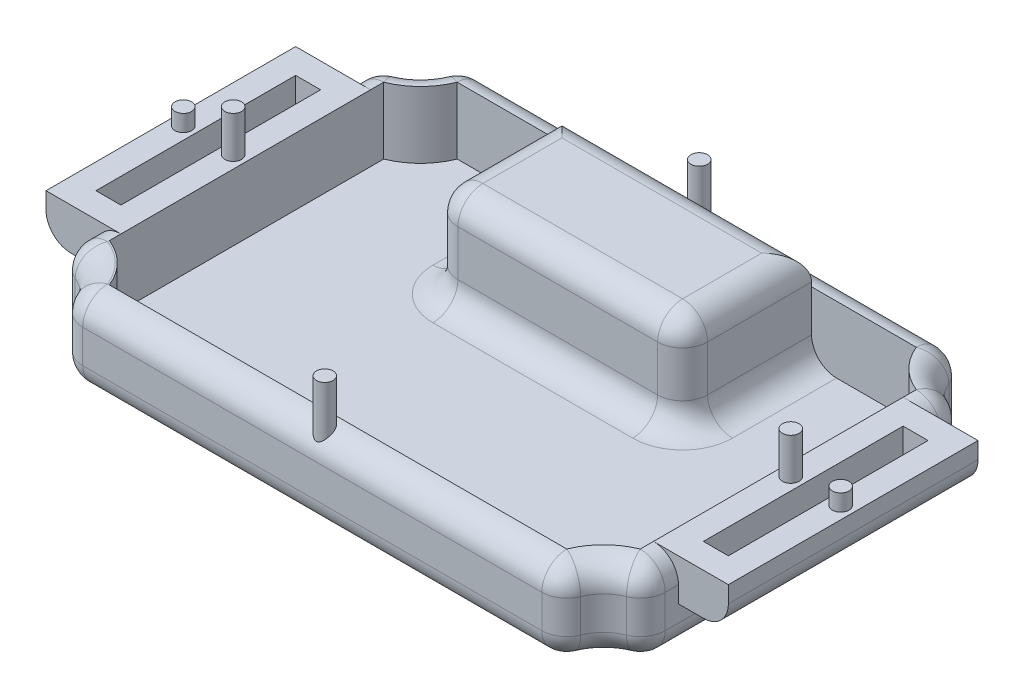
ISO-10303-21;
HEADER;
FILE_DESCRIPTION(('STEP AP214'),'2;1');
FILE_NAME('part.step','',(''),(''),'','','');
FILE_SCHEMA(('AUTOMOTIVE_DESIGN { 1 0 10303 214 1 1 1 1 }'));
ENDSEC;
DATA;
#1=APPLICATION_CONTEXT('core data for automotive mechanical design processes');
#2=APPLICATION_PROTOCOL_DEFINITION('international standard','automotive_design',2000,#1);
#3=PRODUCT_CONTEXT('',#1,'mechanical');
#4=PRODUCT('Part','Part','',(#3));
#5=PRODUCT_RELATED_PRODUCT_CATEGORY('part','',(#4));
#6=PRODUCT_DEFINITION_FORMATION('','',#4);
#7=PRODUCT_DEFINITION_CONTEXT('part definition',#1,'design');
#8=PRODUCT_DEFINITION('design','',#6,#7);
#9=PRODUCT_DEFINITION_SHAPE('','',#8);
#10=(LENGTH_UNIT() NAMED_UNIT(*) SI_UNIT(.MILLI.,.METRE.));
#11=(NAMED_UNIT(*) PLANE_ANGLE_UNIT() SI_UNIT($,.RADIAN.));
#12=(NAMED_UNIT(*) SI_UNIT($,.STERADIAN.) SOLID_ANGLE_UNIT());
#13=UNCERTAINTY_MEASURE_WITH_UNIT(LENGTH_MEASURE(1.E-05),#10,'distance_accuracy_value','');
#14=(GEOMETRIC_REPRESENTATION_CONTEXT(3) GLOBAL_UNCERTAINTY_ASSIGNED_CONTEXT((#13)) GLOBAL_UNIT_ASSIGNED_CONTEXT((#10,
#11,#12)) REPRESENTATION_CONTEXT('',''));
#15=CARTESIAN_POINT('',(0.,0.,0.));
#16=DIRECTION('',(0.,0.,1.));
#17=DIRECTION('',(1.,0.,0.));
#18=AXIS2_PLACEMENT_3D('',#15,#16,#17);
#19=CARTESIAN_POINT('',(-27.5838015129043,2.,-21.));
#20=DIRECTION('',(0.,0.,-1.));
#21=DIRECTION('',(-1.,0.,0.));
#22=AXIS2_PLACEMENT_3D('',#19,#20,#21);
#23=PLANE('',#22);
#24=DIRECTION('',(0.,-1.,0.));
#25=VECTOR('',#24,1.);
#26=CARTESIAN_POINT('',(15.,13.5,-21.));
#27=LINE('',#26,#25);
#28=CARTESIAN_POINT('',(15.,10.,-21.));
#29=VERTEX_POINT('',#28);
#30=CARTESIAN_POINT('',(15.,5.,-21.));
#31=VERTEX_POINT('',#30);
#32=EDGE_CURVE('E537',#29,#31,#27,.T.);
#33=ORIENTED_EDGE('',*,*,#32,.T.);
#34=CARTESIAN_POINT('',(18.,5.,-21.));
#35=DIRECTION('',(0.,0.,-1.));
#36=DIRECTION('',(-1.,0.,0.));
#37=AXIS2_PLACEMENT_3D('',#34,#35,#36);
#38=CIRCLE('',#37,3.);
#39=CARTESIAN_POINT('',(18.,2.,-21.));
#40=VERTEX_POINT('',#39);
#41=EDGE_CURVE('E1375',#31,#40,#38,.F.);
#42=ORIENTED_EDGE('',*,*,#41,.T.);
#43=DIRECTION('',(-1.,0.,0.));
#44=VECTOR('',#43,1.);
#45=CARTESIAN_POINT('',(-27.5838015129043,2.,-21.));
#46=LINE('',#45,#44);
#47=CARTESIAN_POINT('',(27.5838015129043,2.,-21.));
#48=VERTEX_POINT('',#47);
#49=EDGE_CURVE('E723',#48,#40,#46,.T.);
#50=ORIENTED_EDGE('',*,*,#49,.F.);
#51=DIRECTION('',(0.,1.,0.));
#52=VECTOR('',#51,1.);
#53=CARTESIAN_POINT('',(27.5838015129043,2.,-21.));
#54=LINE('',#53,#52);
#55=CARTESIAN_POINT('',(27.5838015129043,10.,-21.));
#56=VERTEX_POINT('',#55);
#57=EDGE_CURVE('E744',#48,#56,#54,.T.);
#58=ORIENTED_EDGE('',*,*,#57,.T.);
#59=DIRECTION('',(-1.,0.,0.));
#60=VECTOR('',#59,1.);
#61=CARTESIAN_POINT('',(-27.5838015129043,10.,-21.));
#62=LINE('',#61,#60);
#63=EDGE_CURVE('E747',#56,#29,#62,.T.);
#64=ORIENTED_EDGE('',*,*,#63,.T.);
#65=EDGE_LOOP('',(#33,#42,#50,#58,#64));
#66=FACE_BOUND('',#65,.T.);
#67=ADVANCED_FACE('F37',(#66),#23,.F.);
#68=CARTESIAN_POINT('',(35.,10.,-24.));
#69=DIRECTION('',(0.,1.,0.));
#70=DIRECTION('',(0.,0.,1.));
#71=AXIS2_PLACEMENT_3D('',#68,#69,#70);
#72=PLANE('',#71);
#73=CARTESIAN_POINT('',(33.5,10.,0.));
#74=DIRECTION('',(0.,1.,0.));
#75=DIRECTION('',(0.,0.,1.));
#76=AXIS2_PLACEMENT_3D('',#73,#74,#75);
#77=CIRCLE('',#76,0.999999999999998);
#78=CARTESIAN_POINT('',(33.5,10.,0.999999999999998));
#79=VERTEX_POINT('',#78);
#80=EDGE_CURVE('E589',#79,#79,#77,.T.);
#81=ORIENTED_EDGE('',*,*,#80,.F.);
#82=EDGE_LOOP('',(#81));
#83=FACE_BOUND('',#82,.T.);
#84=CARTESIAN_POINT('',(39.5,10.,0.));
#85=DIRECTION('',(0.,1.,0.));
#86=DIRECTION('',(0.,0.,1.));
#87=AXIS2_PLACEMENT_3D('',#84,#85,#86);
#88=CIRCLE('',#87,0.999999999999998);
#89=CARTESIAN_POINT('',(39.5,10.,0.999999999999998));
#90=VERTEX_POINT('',#89);
#91=EDGE_CURVE('E600',#90,#90,#88,.T.);
#92=ORIENTED_EDGE('',*,*,#91,.F.);
#93=EDGE_LOOP('',(#92));
#94=FACE_BOUND('',#93,.T.);
#95=DIRECTION('',(0.,0.,-1.));
#96=VECTOR('',#95,1.);
#97=CARTESIAN_POINT('',(35.,10.,-19.));
#98=LINE('',#97,#96);
#99=CARTESIAN_POINT('',(35.,10.,12.));
#100=VERTEX_POINT('',#99);
#101=CARTESIAN_POINT('',(35.,10.,-12.));
#102=VERTEX_POINT('',#101);
#103=EDGE_CURVE('E795',#100,#102,#98,.T.);
#104=ORIENTED_EDGE('',*,*,#103,.T.);
#105=DIRECTION('',(1.,0.,0.));
#106=VECTOR('',#105,1.);
#107=CARTESIAN_POINT('',(0.,10.,-12.));
#108=LINE('',#107,#106);
#109=CARTESIAN_POINT('',(38.,10.,-12.));
#110=VERTEX_POINT('',#109);
#111=EDGE_CURVE('E609',#102,#110,#108,.T.);
#112=ORIENTED_EDGE('',*,*,#111,.T.);
#113=DIRECTION('',(0.,0.,1.));
#114=VECTOR('',#113,1.);
#115=CARTESIAN_POINT('',(38.,10.,0.));
#116=LINE('',#115,#114);
#117=CARTESIAN_POINT('',(38.,10.,12.));
#118=VERTEX_POINT('',#117);
#119=EDGE_CURVE('E630',#110,#118,#116,.T.);
#120=ORIENTED_EDGE('',*,*,#119,.T.);
#121=DIRECTION('',(1.,0.,0.));
#122=VECTOR('',#121,1.);
#123=CARTESIAN_POINT('',(0.,10.,12.));
#124=LINE('',#123,#122);
#125=EDGE_CURVE('E633',#100,#118,#124,.T.);
#126=ORIENTED_EDGE('',*,*,#125,.F.);
#127=EDGE_LOOP('',(#104,#112,#120,#126));
#128=FACE_BOUND('',#127,.T.);
#129=DIRECTION('',(-1.,0.,0.));
#130=VECTOR('',#129,1.);
#131=CARTESIAN_POINT('',(0.,10.,-15.));
#132=LINE('',#131,#130);
#133=CARTESIAN_POINT('',(41.,10.,-15.));
#134=VERTEX_POINT('',#133);
#135=CARTESIAN_POINT('',(32.,10.,-15.));
#136=VERTEX_POINT('',#135);
#137=EDGE_CURVE('E616',#134,#136,#132,.T.);
#138=ORIENTED_EDGE('',*,*,#137,.T.);
#139=DIRECTION('',(0.,0.,-1.));
#140=VECTOR('',#139,1.);
#141=CARTESIAN_POINT('',(32.,10.,-16.5838015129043));
#142=LINE('',#141,#140);
#143=CARTESIAN_POINT('',(32.,10.,15.));
#144=VERTEX_POINT('',#143);
#145=EDGE_CURVE('E771',#144,#136,#142,.T.);
#146=ORIENTED_EDGE('',*,*,#145,.F.);
#147=DIRECTION('',(-1.,0.,0.));
#148=VECTOR('',#147,1.);
#149=CARTESIAN_POINT('',(0.,10.,15.));
#150=LINE('',#149,#148);
#151=CARTESIAN_POINT('',(41.,10.,15.));
#152=VERTEX_POINT('',#151);
#153=EDGE_CURVE('E636',#152,#144,#150,.T.);
#154=ORIENTED_EDGE('',*,*,#153,.F.);
#155=DIRECTION('',(0.,0.,1.));
#156=VECTOR('',#155,1.);
#157=CARTESIAN_POINT('',(41.,10.,0.));
#158=LINE('',#157,#156);
#159=EDGE_CURVE('E638',#134,#152,#158,.T.);
#160=ORIENTED_EDGE('',*,*,#159,.F.);
#161=EDGE_LOOP('',(#138,#146,#154,#160));
#162=FACE_BOUND('',#161,.T.);
#163=ADVANCED_FACE('F1258',(#83,#94,#128,#162),#72,.T.);
#164=DIRECTION('',(0.,0.,1.));
#165=VECTOR('',#164,1.);
#166=CARTESIAN_POINT('',(-35.,10.,-19.));
#167=LINE('',#166,#165);
#168=CARTESIAN_POINT('',(-35.,10.,-12.));
#169=VERTEX_POINT('',#168);
#170=CARTESIAN_POINT('',(-35.,10.,12.));
#171=VERTEX_POINT('',#170);
#172=EDGE_CURVE('E775',#169,#171,#167,.T.);
#173=ORIENTED_EDGE('',*,*,#172,.T.);
#174=DIRECTION('',(-1.,0.,0.));
#175=VECTOR('',#174,1.);
#176=CARTESIAN_POINT('',(0.,10.,12.));
#177=LINE('',#176,#175);
#178=CARTESIAN_POINT('',(-38.,10.,12.));
#179=VERTEX_POINT('',#178);
#180=EDGE_CURVE('E667',#171,#179,#177,.T.);
#181=ORIENTED_EDGE('',*,*,#180,.T.);
#182=DIRECTION('',(0.,0.,1.));
#183=VECTOR('',#182,1.);
#184=CARTESIAN_POINT('',(-38.,10.,0.));
#185=LINE('',#184,#183);
#186=CARTESIAN_POINT('',(-38.,10.,-12.));
#187=VERTEX_POINT('',#186);
#188=EDGE_CURVE('E645',#187,#179,#185,.T.);
#189=ORIENTED_EDGE('',*,*,#188,.F.);
#190=DIRECTION('',(-1.,0.,0.));
#191=VECTOR('',#190,1.);
#192=CARTESIAN_POINT('',(0.,10.,-12.));
#193=LINE('',#192,#191);
#194=EDGE_CURVE('E684',#169,#187,#193,.T.);
#195=ORIENTED_EDGE('',*,*,#194,.F.);
#196=EDGE_LOOP('',(#173,#181,#189,#195));
#197=FACE_BOUND('',#196,.T.);
#198=CARTESIAN_POINT('',(-39.5,10.,0.));
#199=DIRECTION('',(0.,1.,0.));
#200=DIRECTION('',(0.,0.,1.));
#201=AXIS2_PLACEMENT_3D('',#198,#199,#200);
#202=CIRCLE('',#201,0.999999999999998);
#203=CARTESIAN_POINT('',(-39.5,10.,0.999999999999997));
#204=VERTEX_POINT('',#203);
#205=EDGE_CURVE('E603',#204,#204,#202,.T.);
#206=ORIENTED_EDGE('',*,*,#205,.F.);
#207=EDGE_LOOP('',(#206));
#208=FACE_BOUND('',#207,.T.);
#209=CARTESIAN_POINT('',(-33.5,10.,0.));
#210=DIRECTION('',(0.,1.,0.));
#211=DIRECTION('',(0.,0.,1.));
#212=AXIS2_PLACEMENT_3D('',#209,#210,#211);
#213=CIRCLE('',#212,0.999999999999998);
#214=CARTESIAN_POINT('',(-33.5,10.,0.999999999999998));
#215=VERTEX_POINT('',#214);
#216=EDGE_CURVE('E578',#215,#215,#213,.T.);
#217=ORIENTED_EDGE('',*,*,#216,.F.);
#218=EDGE_LOOP('',(#217));
#219=FACE_BOUND('',#218,.T.);
#220=DIRECTION('',(0.,0.,1.));
#221=VECTOR('',#220,1.);
#222=CARTESIAN_POINT('',(-32.,10.,-16.5838015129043));
#223=LINE('',#222,#221);
#224=CARTESIAN_POINT('',(-32.,10.,-15.));
#225=VERTEX_POINT('',#224);
#226=CARTESIAN_POINT('',(-32.,10.,15.));
#227=VERTEX_POINT('',#226);
#228=EDGE_CURVE('E759',#225,#227,#223,.T.);
#229=ORIENTED_EDGE('',*,*,#228,.F.);
#230=DIRECTION('',(-1.,0.,0.));
#231=VECTOR('',#230,1.);
#232=CARTESIAN_POINT('',(0.,10.,-15.));
#233=LINE('',#232,#231);
#234=CARTESIAN_POINT('',(-41.,10.,-15.));
#235=VERTEX_POINT('',#234);
#236=EDGE_CURVE('E686',#225,#235,#233,.T.);
#237=ORIENTED_EDGE('',*,*,#236,.T.);
#238=DIRECTION('',(0.,0.,1.));
#239=VECTOR('',#238,1.);
#240=CARTESIAN_POINT('',(-41.,10.,0.));
#241=LINE('',#240,#239);
#242=CARTESIAN_POINT('',(-41.,10.,15.));
#243=VERTEX_POINT('',#242);
#244=EDGE_CURVE('E689',#235,#243,#241,.T.);
#245=ORIENTED_EDGE('',*,*,#244,.T.);
#246=DIRECTION('',(-1.,0.,0.));
#247=VECTOR('',#246,1.);
#248=CARTESIAN_POINT('',(0.,10.,15.));
#249=LINE('',#248,#247);
#250=EDGE_CURVE('E692',#227,#243,#249,.T.);
#251=ORIENTED_EDGE('',*,*,#250,.F.);
#252=EDGE_LOOP('',(#229,#237,#245,#251));
#253=FACE_BOUND('',#252,.T.);
#254=ADVANCED_FACE('F1265',(#197,#208,#219,#253),#72,.T.);
#255=CARTESIAN_POINT('',(0.,5.,0.));
#256=DIRECTION('',(0.,1.,0.));
#257=DIRECTION('',(0.,0.,1.));
#258=AXIS2_PLACEMENT_3D('',#255,#256,#257);
#259=PLANE('',#258);
#260=DIRECTION('',(-1.,0.,0.));
#261=VECTOR('',#260,1.);
#262=CARTESIAN_POINT('',(0.,5.,-15.));
#263=LINE('',#262,#261);
#264=CARTESIAN_POINT('',(38.,5.,-15.));
#265=VERTEX_POINT('',#264);
#266=CARTESIAN_POINT('',(35.,5.,-15.));
#267=VERTEX_POINT('',#266);
#268=EDGE_CURVE('E626',#265,#267,#263,.T.);
#269=ORIENTED_EDGE('',*,*,#268,.F.);
#270=DIRECTION('',(0.,0.,1.));
#271=VECTOR('',#270,1.);
#272=CARTESIAN_POINT('',(38.,5.,0.));
#273=LINE('',#272,#271);
#274=CARTESIAN_POINT('',(38.,5.,-12.));
#275=VERTEX_POINT('',#274);
#276=EDGE_CURVE('E811',#265,#275,#273,.T.);
#277=ORIENTED_EDGE('',*,*,#276,.T.);
#278=DIRECTION('',(1.,0.,0.));
#279=VECTOR('',#278,1.);
#280=CARTESIAN_POINT('',(0.,5.,-12.));
#281=LINE('',#280,#279);
#282=CARTESIAN_POINT('',(35.,5.,-12.));
#283=VERTEX_POINT('',#282);
#284=EDGE_CURVE('E612',#283,#275,#281,.T.);
#285=ORIENTED_EDGE('',*,*,#284,.F.);
#286=DIRECTION('',(0.,0.,-1.));
#287=VECTOR('',#286,1.);
#288=CARTESIAN_POINT('',(35.,5.,0.));
#289=LINE('',#288,#287);
#290=EDGE_CURVE('E624',#283,#267,#289,.T.);
#291=ORIENTED_EDGE('',*,*,#290,.T.);
#292=EDGE_LOOP('',(#269,#277,#285,#291));
#293=FACE_BOUND('',#292,.T.);
#294=ADVANCED_FACE('F1520',(#293),#259,.F.);
#295=CARTESIAN_POINT('',(0.,5.,0.));
#296=DIRECTION('',(0.,1.,0.));
#297=DIRECTION('',(0.,0.,1.));
#298=AXIS2_PLACEMENT_3D('',#295,#296,#297);
#299=PLANE('',#298);
#300=DIRECTION('',(-1.,0.,0.));
#301=VECTOR('',#300,1.);
#302=CARTESIAN_POINT('',(0.,5.,15.));
#303=LINE('',#302,#301);
#304=CARTESIAN_POINT('',(-35.,5.,15.));
#305=VERTEX_POINT('',#304);
#306=CARTESIAN_POINT('',(-38.,5.,15.));
#307=VERTEX_POINT('',#306);
#308=EDGE_CURVE('E675',#305,#307,#303,.T.);
#309=ORIENTED_EDGE('',*,*,#308,.T.);
#310=DIRECTION('',(0.,0.,1.));
#311=VECTOR('',#310,1.);
#312=CARTESIAN_POINT('',(-38.,5.,-15.));
#313=LINE('',#312,#311);
#314=CARTESIAN_POINT('',(-38.,5.,12.));
#315=VERTEX_POINT('',#314);
#316=EDGE_CURVE('E805',#307,#315,#313,.F.);
#317=ORIENTED_EDGE('',*,*,#316,.T.);
#318=DIRECTION('',(-1.,0.,0.));
#319=VECTOR('',#318,1.);
#320=CARTESIAN_POINT('',(0.,5.,12.));
#321=LINE('',#320,#319);
#322=CARTESIAN_POINT('',(-35.,5.,12.));
#323=VERTEX_POINT('',#322);
#324=EDGE_CURVE('E678',#323,#315,#321,.T.);
#325=ORIENTED_EDGE('',*,*,#324,.F.);
#326=DIRECTION('',(0.,0.,1.));
#327=VECTOR('',#326,1.);
#328=CARTESIAN_POINT('',(-35.,5.,0.));
#329=LINE('',#328,#327);
#330=EDGE_CURVE('E672',#323,#305,#329,.T.);
#331=ORIENTED_EDGE('',*,*,#330,.T.);
#332=EDGE_LOOP('',(#309,#317,#325,#331));
#333=FACE_BOUND('',#332,.T.);
#334=ADVANCED_FACE('F1567',(#333),#299,.F.);
#335=CARTESIAN_POINT('',(35.,10.,-19.));
#336=DIRECTION('',(-1.,0.,0.));
#337=DIRECTION('',(0.,0.,1.));
#338=AXIS2_PLACEMENT_3D('',#335,#336,#337);
#339=PLANE('',#338);
#340=DIRECTION('',(0.,-1.,0.));
#341=VECTOR('',#340,1.);
#342=CARTESIAN_POINT('',(35.,10.,-16.5838015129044));
#343=LINE('',#342,#341);
#344=CARTESIAN_POINT('',(35.,3.,-16.5838015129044));
#345=VERTEX_POINT('',#344);
#346=CARTESIAN_POINT('',(35.,7.,-16.5838015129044));
#347=VERTEX_POINT('',#346);
#348=EDGE_CURVE('E847',#345,#347,#343,.F.);
#349=ORIENTED_EDGE('',*,*,#348,.T.);
#350=DIRECTION('',(0.,0.,-1.));
#351=VECTOR('',#350,1.);
#352=CARTESIAN_POINT('',(35.,7.,-15.));
#353=LINE('',#352,#351);
#354=CARTESIAN_POINT('',(35.,7.,-15.));
#355=VERTEX_POINT('',#354);
#356=EDGE_CURVE('E878',#347,#355,#353,.F.);
#357=ORIENTED_EDGE('',*,*,#356,.T.);
#358=DIRECTION('',(0.,1.,0.));
#359=VECTOR('',#358,1.);
#360=CARTESIAN_POINT('',(35.,5.,-15.));
#361=LINE('',#360,#359);
#362=EDGE_CURVE('E646',#267,#355,#361,.T.);
#363=ORIENTED_EDGE('',*,*,#362,.F.);
#364=ORIENTED_EDGE('',*,*,#290,.F.);
#365=DIRECTION('',(0.,1.,0.));
#366=VECTOR('',#365,1.);
#367=CARTESIAN_POINT('',(35.,5.,-12.));
#368=LINE('',#367,#366);
#369=EDGE_CURVE('E642',#283,#102,#368,.T.);
#370=ORIENTED_EDGE('',*,*,#369,.T.);
#371=ORIENTED_EDGE('',*,*,#103,.F.);
#372=DIRECTION('',(0.,1.,0.));
#373=VECTOR('',#372,1.);
#374=CARTESIAN_POINT('',(35.,5.,12.));
#375=LINE('',#374,#373);
#376=CARTESIAN_POINT('',(35.,5.,12.));
#377=VERTEX_POINT('',#376);
#378=EDGE_CURVE('E656',#377,#100,#375,.T.);
#379=ORIENTED_EDGE('',*,*,#378,.F.);
#380=CARTESIAN_POINT('',(35.,5.,15.));
#381=VERTEX_POINT('',#380);
#382=EDGE_CURVE('E621',#381,#377,#289,.T.);
#383=ORIENTED_EDGE('',*,*,#382,.F.);
#384=DIRECTION('',(0.,1.,0.));
#385=VECTOR('',#384,1.);
#386=CARTESIAN_POINT('',(35.,5.,15.));
#387=LINE('',#386,#385);
#388=CARTESIAN_POINT('',(35.,7.,15.));
#389=VERTEX_POINT('',#388);
#390=EDGE_CURVE('E653',#381,#389,#387,.T.);
#391=ORIENTED_EDGE('',*,*,#390,.T.);
#392=DIRECTION('',(0.,0.,-1.));
#393=VECTOR('',#392,1.);
#394=CARTESIAN_POINT('',(35.,7.,16.5838015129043));
#395=LINE('',#394,#393);
#396=CARTESIAN_POINT('',(35.,7.,16.5838015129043));
#397=VERTEX_POINT('',#396);
#398=EDGE_CURVE('E876',#389,#397,#395,.F.);
#399=ORIENTED_EDGE('',*,*,#398,.T.);
#400=DIRECTION('',(0.,-1.,0.));
#401=VECTOR('',#400,1.);
#402=CARTESIAN_POINT('',(35.,10.,16.5838015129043));
#403=LINE('',#402,#401);
#404=CARTESIAN_POINT('',(35.,3.,16.5838015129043));
#405=VERTEX_POINT('',#404);
#406=EDGE_CURVE('E844',#397,#405,#403,.T.);
#407=ORIENTED_EDGE('',*,*,#406,.T.);
#408=DIRECTION('',(0.,0.,-1.));
#409=VECTOR('',#408,1.);
#410=CARTESIAN_POINT('',(35.,3.,-19.));
#411=LINE('',#410,#409);
#412=EDGE_CURVE('E874',#405,#345,#411,.T.);
#413=ORIENTED_EDGE('',*,*,#412,.T.);
#414=EDGE_LOOP('',(#349,#357,#363,#364,#370,#371,#379,#383,#391,#399,#407,#413));
#415=FACE_BOUND('',#414,.T.);
#416=ADVANCED_FACE('F1605',(#415),#339,.F.);
#417=CARTESIAN_POINT('',(35.,10.,-24.));
#418=DIRECTION('',(0.,-1.,0.));
#419=DIRECTION('',(0.,0.,-1.));
#420=AXIS2_PLACEMENT_3D('',#417,#418,#419);
#421=CYLINDRICAL_SURFACE('',#420,5.);
#422=DIRECTION('',(0.,-1.,0.));
#423=VECTOR('',#422,1.);
#424=CARTESIAN_POINT('',(30.3648759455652,10.,-22.125));
#425=LINE('',#424,#423);
#426=CARTESIAN_POINT('',(30.3648759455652,3.,-22.125));
#427=VERTEX_POINT('',#426);
#428=CARTESIAN_POINT('',(30.3648759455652,7.,-22.125));
#429=VERTEX_POINT('',#428);
#430=EDGE_CURVE('E841',#427,#429,#425,.F.);
#431=ORIENTED_EDGE('',*,*,#430,.T.);
#432=CARTESIAN_POINT('',(35.,7.,-24.));
#433=DIRECTION('',(0.,1.,0.));
#434=DIRECTION('',(0.,0.,1.));
#435=AXIS2_PLACEMENT_3D('',#432,#433,#434);
#436=CIRCLE('',#435,5.);
#437=CARTESIAN_POINT('',(33.125,7.,-19.3648759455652));
#438=VERTEX_POINT('',#437);
#439=EDGE_CURVE('E952',#429,#438,#436,.T.);
#440=ORIENTED_EDGE('',*,*,#439,.T.);
#441=DIRECTION('',(0.,-1.,0.));
#442=VECTOR('',#441,1.);
#443=CARTESIAN_POINT('',(33.125,10.,-19.3648759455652));
#444=LINE('',#443,#442);
#445=CARTESIAN_POINT('',(33.125,3.,-19.3648759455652));
#446=VERTEX_POINT('',#445);
#447=EDGE_CURVE('E838',#438,#446,#444,.T.);
#448=ORIENTED_EDGE('',*,*,#447,.T.);
#449=CARTESIAN_POINT('',(35.,3.,-24.));
#450=DIRECTION('',(0.,1.,0.));
#451=DIRECTION('',(0.,0.,1.));
#452=AXIS2_PLACEMENT_3D('',#449,#450,#451);
#453=CIRCLE('',#452,5.);
#454=EDGE_CURVE('E950',#446,#427,#453,.F.);
#455=ORIENTED_EDGE('',*,*,#454,.T.);
#456=EDGE_LOOP('',(#431,#440,#448,#455));
#457=FACE_BOUND('',#456,.T.);
#458=ADVANCED_FACE('F1423',(#457),#421,.F.);
#459=CARTESIAN_POINT('',(30.,10.,-24.));
#460=DIRECTION('',(0.,0.,1.));
#461=DIRECTION('',(1.,0.,0.));
#462=AXIS2_PLACEMENT_3D('',#459,#460,#461);
#463=PLANE('',#462);
#464=DIRECTION('',(0.,-1.,0.));
#465=VECTOR('',#464,1.);
#466=CARTESIAN_POINT('',(-27.5838015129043,10.,-24.));
#467=LINE('',#466,#465);
#468=CARTESIAN_POINT('',(-27.5838015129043,3.,-24.));
#469=VERTEX_POINT('',#468);
#470=CARTESIAN_POINT('',(-27.5838015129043,7.,-24.));
#471=VERTEX_POINT('',#470);
#472=EDGE_CURVE('E835',#469,#471,#467,.F.);
#473=ORIENTED_EDGE('',*,*,#472,.T.);
#474=DIRECTION('',(-1.,0.,0.));
#475=VECTOR('',#474,1.);
#476=CARTESIAN_POINT('',(27.5838015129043,7.,-24.));
#477=LINE('',#476,#475);
#478=CARTESIAN_POINT('',(27.5838015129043,7.,-24.));
#479=VERTEX_POINT('',#478);
#480=EDGE_CURVE('E900',#471,#479,#477,.F.);
#481=ORIENTED_EDGE('',*,*,#480,.T.);
#482=DIRECTION('',(0.,-1.,0.));
#483=VECTOR('',#482,1.);
#484=CARTESIAN_POINT('',(27.5838015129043,10.,-24.));
#485=LINE('',#484,#483);
#486=CARTESIAN_POINT('',(27.5838015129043,3.,-24.));
#487=VERTEX_POINT('',#486);
#488=EDGE_CURVE('E832',#479,#487,#485,.T.);
#489=ORIENTED_EDGE('',*,*,#488,.T.);
#490=DIRECTION('',(-1.,0.,0.));
#491=VECTOR('',#490,1.);
#492=CARTESIAN_POINT('',(30.,3.,-24.));
#493=LINE('',#492,#491);
#494=EDGE_CURVE('E898',#487,#469,#493,.T.);
#495=ORIENTED_EDGE('',*,*,#494,.T.);
#496=EDGE_LOOP('',(#473,#481,#489,#495));
#497=FACE_BOUND('',#496,.T.);
#498=ADVANCED_FACE('F1449',(#497),#463,.F.);
#499=CARTESIAN_POINT('',(-35.,10.,-24.));
#500=DIRECTION('',(0.,-1.,0.));
#501=DIRECTION('',(0.,0.,-1.));
#502=AXIS2_PLACEMENT_3D('',#499,#500,#501);
#503=CYLINDRICAL_SURFACE('',#502,5.);
#504=DIRECTION('',(0.,-1.,0.));
#505=VECTOR('',#504,1.);
#506=CARTESIAN_POINT('',(-33.125,10.,-19.3648759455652));
#507=LINE('',#506,#505);
#508=CARTESIAN_POINT('',(-33.125,3.,-19.3648759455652));
#509=VERTEX_POINT('',#508);
#510=CARTESIAN_POINT('',(-33.125,7.,-19.3648759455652));
#511=VERTEX_POINT('',#510);
#512=EDGE_CURVE('E829',#509,#511,#507,.F.);
#513=ORIENTED_EDGE('',*,*,#512,.T.);
#514=CARTESIAN_POINT('',(-35.,7.,-24.));
#515=DIRECTION('',(0.,1.,0.));
#516=DIRECTION('',(0.,0.,1.));
#517=AXIS2_PLACEMENT_3D('',#514,#515,#516);
#518=CIRCLE('',#517,5.);
#519=CARTESIAN_POINT('',(-30.3648759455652,7.,-22.125));
#520=VERTEX_POINT('',#519);
#521=EDGE_CURVE('E948',#511,#520,#518,.T.);
#522=ORIENTED_EDGE('',*,*,#521,.T.);
#523=DIRECTION('',(0.,-1.,0.));
#524=VECTOR('',#523,1.);
#525=CARTESIAN_POINT('',(-30.3648759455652,10.,-22.125));
#526=LINE('',#525,#524);
#527=CARTESIAN_POINT('',(-30.3648759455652,3.,-22.125));
#528=VERTEX_POINT('',#527);
#529=EDGE_CURVE('E826',#520,#528,#526,.T.);
#530=ORIENTED_EDGE('',*,*,#529,.T.);
#531=CARTESIAN_POINT('',(-35.,3.,-24.));
#532=DIRECTION('',(0.,1.,0.));
#533=DIRECTION('',(0.,0.,1.));
#534=AXIS2_PLACEMENT_3D('',#531,#532,#533);
#535=CIRCLE('',#534,5.);
#536=EDGE_CURVE('E946',#528,#509,#535,.F.);
#537=ORIENTED_EDGE('',*,*,#536,.T.);
#538=EDGE_LOOP('',(#513,#522,#530,#537));
#539=FACE_BOUND('',#538,.T.);
#540=ADVANCED_FACE('F1462',(#539),#503,.F.);
#541=CARTESIAN_POINT('',(-35.,10.,-19.));
#542=DIRECTION('',(1.,0.,0.));
#543=DIRECTION('',(0.,0.,-1.));
#544=AXIS2_PLACEMENT_3D('',#541,#542,#543);
#545=PLANE('',#544);
#546=DIRECTION('',(0.,1.,0.));
#547=VECTOR('',#546,1.);
#548=CARTESIAN_POINT('',(-35.,5.,-15.));
#549=LINE('',#548,#547);
#550=CARTESIAN_POINT('',(-35.,5.,-15.));
#551=VERTEX_POINT('',#550);
#552=CARTESIAN_POINT('',(-35.,7.,-15.));
#553=VERTEX_POINT('',#552);
#554=EDGE_CURVE('E710',#551,#553,#549,.T.);
#555=ORIENTED_EDGE('',*,*,#554,.T.);
#556=DIRECTION('',(0.,0.,1.));
#557=VECTOR('',#556,1.);
#558=CARTESIAN_POINT('',(-35.,7.,-16.5838015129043));
#559=LINE('',#558,#557);
#560=CARTESIAN_POINT('',(-35.,7.,-16.5838015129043));
#561=VERTEX_POINT('',#560);
#562=EDGE_CURVE('E888',#553,#561,#559,.F.);
#563=ORIENTED_EDGE('',*,*,#562,.T.);
#564=DIRECTION('',(0.,-1.,0.));
#565=VECTOR('',#564,1.);
#566=CARTESIAN_POINT('',(-35.,10.,-16.5838015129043));
#567=LINE('',#566,#565);
#568=CARTESIAN_POINT('',(-35.,3.,-16.5838015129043));
#569=VERTEX_POINT('',#568);
#570=EDGE_CURVE('E823',#561,#569,#567,.T.);
#571=ORIENTED_EDGE('',*,*,#570,.T.);
#572=DIRECTION('',(0.,0.,1.));
#573=VECTOR('',#572,1.);
#574=CARTESIAN_POINT('',(-35.,3.,-19.));
#575=LINE('',#574,#573);
#576=CARTESIAN_POINT('',(-35.,3.,16.5838015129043));
#577=VERTEX_POINT('',#576);
#578=EDGE_CURVE('E884',#569,#577,#575,.T.);
#579=ORIENTED_EDGE('',*,*,#578,.T.);
#580=DIRECTION('',(0.,-1.,0.));
#581=VECTOR('',#580,1.);
#582=CARTESIAN_POINT('',(-35.,10.,16.5838015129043));
#583=LINE('',#582,#581);
#584=CARTESIAN_POINT('',(-35.,7.,16.5838015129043));
#585=VERTEX_POINT('',#584);
#586=EDGE_CURVE('E820',#577,#585,#583,.F.);
#587=ORIENTED_EDGE('',*,*,#586,.T.);
#588=DIRECTION('',(0.,0.,1.));
#589=VECTOR('',#588,1.);
#590=CARTESIAN_POINT('',(-35.,7.,15.));
#591=LINE('',#590,#589);
#592=CARTESIAN_POINT('',(-35.,7.,15.));
#593=VERTEX_POINT('',#592);
#594=EDGE_CURVE('E886',#585,#593,#591,.F.);
#595=ORIENTED_EDGE('',*,*,#594,.T.);
#596=DIRECTION('',(0.,1.,0.));
#597=VECTOR('',#596,1.);
#598=CARTESIAN_POINT('',(-35.,5.,15.));
#599=LINE('',#598,#597);
#600=EDGE_CURVE('E703',#305,#593,#599,.T.);
#601=ORIENTED_EDGE('',*,*,#600,.F.);
#602=ORIENTED_EDGE('',*,*,#330,.F.);
#603=DIRECTION('',(0.,1.,0.));
#604=VECTOR('',#603,1.);
#605=CARTESIAN_POINT('',(-35.,5.,12.));
#606=LINE('',#605,#604);
#607=EDGE_CURVE('E700',#323,#171,#606,.T.);
#608=ORIENTED_EDGE('',*,*,#607,.T.);
#609=ORIENTED_EDGE('',*,*,#172,.F.);
#610=DIRECTION('',(0.,1.,0.));
#611=VECTOR('',#610,1.);
#612=CARTESIAN_POINT('',(-35.,5.,-12.));
#613=LINE('',#612,#611);
#614=CARTESIAN_POINT('',(-35.,5.,-12.));
#615=VERTEX_POINT('',#614);
#616=EDGE_CURVE('E713',#615,#169,#613,.T.);
#617=ORIENTED_EDGE('',*,*,#616,.F.);
#618=EDGE_CURVE('E669',#551,#615,#329,.T.);
#619=ORIENTED_EDGE('',*,*,#618,.F.);
#620=EDGE_LOOP('',(#555,#563,#571,#579,#587,#595,#601,#602,#608,#609,#617,#619));
#621=FACE_BOUND('',#620,.T.);
#622=ADVANCED_FACE('F1537',(#621),#545,.F.);
#623=CARTESIAN_POINT('',(-35.,10.,24.));
#624=DIRECTION('',(0.,-1.,0.));
#625=DIRECTION('',(0.,0.,-1.));
#626=AXIS2_PLACEMENT_3D('',#623,#624,#625);
#627=CYLINDRICAL_SURFACE('',#626,5.);
#628=DIRECTION('',(0.,-1.,0.));
#629=VECTOR('',#628,1.);
#630=CARTESIAN_POINT('',(-30.3648759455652,10.,22.125));
#631=LINE('',#630,#629);
#632=CARTESIAN_POINT('',(-30.3648759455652,3.,22.125));
#633=VERTEX_POINT('',#632);
#634=CARTESIAN_POINT('',(-30.3648759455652,7.,22.125));
#635=VERTEX_POINT('',#634);
#636=EDGE_CURVE('E865',#633,#635,#631,.F.);
#637=ORIENTED_EDGE('',*,*,#636,.T.);
#638=CARTESIAN_POINT('',(-35.,7.,24.));
#639=DIRECTION('',(0.,1.,0.));
#640=DIRECTION('',(0.,0.,1.));
#641=AXIS2_PLACEMENT_3D('',#638,#639,#640);
#642=CIRCLE('',#641,5.);
#643=CARTESIAN_POINT('',(-33.125,7.,19.3648759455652));
#644=VERTEX_POINT('',#643);
#645=EDGE_CURVE('E960',#635,#644,#642,.T.);
#646=ORIENTED_EDGE('',*,*,#645,.T.);
#647=DIRECTION('',(0.,-1.,0.));
#648=VECTOR('',#647,1.);
#649=CARTESIAN_POINT('',(-33.125,10.,19.3648759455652));
#650=LINE('',#649,#648);
#651=CARTESIAN_POINT('',(-33.125,3.,19.3648759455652));
#652=VERTEX_POINT('',#651);
#653=EDGE_CURVE('E862',#644,#652,#650,.T.);
#654=ORIENTED_EDGE('',*,*,#653,.T.);
#655=CARTESIAN_POINT('',(-35.,3.,24.));
#656=DIRECTION('',(0.,1.,0.));
#657=DIRECTION('',(0.,0.,1.));
#658=AXIS2_PLACEMENT_3D('',#655,#656,#657);
#659=CIRCLE('',#658,5.);
#660=EDGE_CURVE('E958',#652,#633,#659,.F.);
#661=ORIENTED_EDGE('',*,*,#660,.T.);
#662=EDGE_LOOP('',(#637,#646,#654,#661));
#663=FACE_BOUND('',#662,.T.);
#664=ADVANCED_FACE('F1615',(#663),#627,.F.);
#665=CARTESIAN_POINT('',(30.,10.,24.));
#666=DIRECTION('',(0.,0.,-1.));
#667=DIRECTION('',(-1.,0.,0.));
#668=AXIS2_PLACEMENT_3D('',#665,#666,#667);
#669=PLANE('',#668);
#670=DIRECTION('',(0.,-1.,0.));
#671=VECTOR('',#670,1.);
#672=CARTESIAN_POINT('',(27.5838015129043,10.,24.));
#673=LINE('',#672,#671);
#674=CARTESIAN_POINT('',(27.5838015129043,3.,24.));
#675=VERTEX_POINT('',#674);
#676=CARTESIAN_POINT('',(27.5838015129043,7.,24.));
#677=VERTEX_POINT('',#676);
#678=EDGE_CURVE('E859',#675,#677,#673,.F.);
#679=ORIENTED_EDGE('',*,*,#678,.T.);
#680=DIRECTION('',(1.,0.,0.));
#681=VECTOR('',#680,1.);
#682=CARTESIAN_POINT('',(-27.5838015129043,7.,24.));
#683=LINE('',#682,#681);
#684=CARTESIAN_POINT('',(-27.5838015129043,7.,24.));
#685=VERTEX_POINT('',#684);
#686=EDGE_CURVE('E921',#677,#685,#683,.F.);
#687=ORIENTED_EDGE('',*,*,#686,.T.);
#688=DIRECTION('',(0.,-1.,0.));
#689=VECTOR('',#688,1.);
#690=CARTESIAN_POINT('',(-27.5838015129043,10.,24.));
#691=LINE('',#690,#689);
#692=CARTESIAN_POINT('',(-27.5838015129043,3.,24.));
#693=VERTEX_POINT('',#692);
#694=EDGE_CURVE('E856',#685,#693,#691,.T.);
#695=ORIENTED_EDGE('',*,*,#694,.T.);
#696=DIRECTION('',(1.,0.,0.));
#697=VECTOR('',#696,1.);
#698=CARTESIAN_POINT('',(30.,3.,24.));
#699=LINE('',#698,#697);
#700=EDGE_CURVE('E919',#693,#675,#699,.T.);
#701=ORIENTED_EDGE('',*,*,#700,.T.);
#702=EDGE_LOOP('',(#679,#687,#695,#701));
#703=FACE_BOUND('',#702,.T.);
#704=ADVANCED_FACE('F1611',(#703),#669,.F.);
#705=CARTESIAN_POINT('',(35.,10.,24.));
#706=DIRECTION('',(0.,-1.,0.));
#707=DIRECTION('',(0.,0.,-1.));
#708=AXIS2_PLACEMENT_3D('',#705,#706,#707);
#709=CYLINDRICAL_SURFACE('',#708,5.);
#710=DIRECTION('',(0.,-1.,0.));
#711=VECTOR('',#710,1.);
#712=CARTESIAN_POINT('',(30.3648759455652,10.,22.125));
#713=LINE('',#712,#711);
#714=CARTESIAN_POINT('',(30.3648759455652,7.,22.125));
#715=VERTEX_POINT('',#714);
#716=CARTESIAN_POINT('',(30.3648759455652,3.,22.125));
#717=VERTEX_POINT('',#716);
#718=EDGE_CURVE('E853',#715,#717,#713,.T.);
#719=ORIENTED_EDGE('',*,*,#718,.T.);
#720=CARTESIAN_POINT('',(35.,3.,24.));
#721=DIRECTION('',(0.,1.,0.));
#722=DIRECTION('',(0.,0.,1.));
#723=AXIS2_PLACEMENT_3D('',#720,#721,#722);
#724=CIRCLE('',#723,5.);
#725=CARTESIAN_POINT('',(33.125,3.,19.3648759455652));
#726=VERTEX_POINT('',#725);
#727=EDGE_CURVE('E956',#717,#726,#724,.F.);
#728=ORIENTED_EDGE('',*,*,#727,.T.);
#729=DIRECTION('',(0.,-1.,0.));
#730=VECTOR('',#729,1.);
#731=CARTESIAN_POINT('',(33.125,10.,19.3648759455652));
#732=LINE('',#731,#730);
#733=CARTESIAN_POINT('',(33.125,7.,19.3648759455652));
#734=VERTEX_POINT('',#733);
#735=EDGE_CURVE('E850',#726,#734,#732,.F.);
#736=ORIENTED_EDGE('',*,*,#735,.T.);
#737=CARTESIAN_POINT('',(35.,7.,24.));
#738=DIRECTION('',(0.,1.,0.));
#739=DIRECTION('',(0.,0.,1.));
#740=AXIS2_PLACEMENT_3D('',#737,#738,#739);
#741=CIRCLE('',#740,5.);
#742=EDGE_CURVE('E954',#734,#715,#741,.T.);
#743=ORIENTED_EDGE('',*,*,#742,.T.);
#744=EDGE_LOOP('',(#719,#728,#736,#743));
#745=FACE_BOUND('',#744,.T.);
#746=ADVANCED_FACE('F1603',(#745),#709,.F.);
#747=CARTESIAN_POINT('',(-35.,10.,24.));
#748=DIRECTION('',(0.,-1.,0.));
#749=DIRECTION('',(0.,0.,1.));
#750=AXIS2_PLACEMENT_3D('',#747,#748,#749);
#751=CIRCLE('',#750,8.18237344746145);
#752=CARTESIAN_POINT('',(-32.,10.,16.3874291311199));
#753=VERTEX_POINT('',#752);
#754=CARTESIAN_POINT('',(-27.3874291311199,10.,21.));
#755=VERTEX_POINT('',#754);
#756=EDGE_CURVE('E758',#753,#755,#751,.T.);
#757=ORIENTED_EDGE('',*,*,#756,.F.);
#758=DIRECTION('',(0.,0.,1.));
#759=VECTOR('',#758,1.);
#760=CARTESIAN_POINT('',(-32.,10.,16.5838015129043));
#761=LINE('',#760,#759);
#762=CARTESIAN_POINT('',(-32.,10.,16.5838015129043));
#763=VERTEX_POINT('',#762);
#764=EDGE_CURVE('E872',#753,#763,#761,.T.);
#765=ORIENTED_EDGE('',*,*,#764,.T.);
#766=CARTESIAN_POINT('',(-35.,10.,24.));
#767=DIRECTION('',(0.,1.,0.));
#768=DIRECTION('',(0.,0.,1.));
#769=AXIS2_PLACEMENT_3D('',#766,#767,#768);
#770=CIRCLE('',#769,8.);
#771=CARTESIAN_POINT('',(-27.5838015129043,10.,21.));
#772=VERTEX_POINT('',#771);
#773=EDGE_CURVE('E868',#763,#772,#770,.F.);
#774=ORIENTED_EDGE('',*,*,#773,.T.);
#775=DIRECTION('',(1.,0.,0.));
#776=VECTOR('',#775,1.);
#777=CARTESIAN_POINT('',(27.5838015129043,10.,21.));
#778=LINE('',#777,#776);
#779=EDGE_CURVE('E870',#772,#755,#778,.T.);
#780=ORIENTED_EDGE('',*,*,#779,.T.);
#781=EDGE_LOOP('',(#757,#765,#774,#780));
#782=FACE_BOUND('',#781,.T.);
#783=ADVANCED_FACE('F1268',(#782),#72,.T.);
#784=CARTESIAN_POINT('',(35.,0.,-24.));
#785=DIRECTION('',(0.,1.,0.));
#786=DIRECTION('',(0.,0.,1.));
#787=AXIS2_PLACEMENT_3D('',#784,#785,#786);
#788=PLANE('',#787);
#789=DIRECTION('',(-1.,0.,0.));
#790=VECTOR('',#789,1.);
#791=CARTESIAN_POINT('',(35.,0.,-21.));
#792=LINE('',#791,#790);
#793=CARTESIAN_POINT('',(-27.5838015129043,0.,-21.));
#794=VERTEX_POINT('',#793);
#795=CARTESIAN_POINT('',(-15.,0.,-21.));
#796=VERTEX_POINT('',#795);
#797=EDGE_CURVE('E941',#794,#796,#792,.F.);
#798=ORIENTED_EDGE('',*,*,#797,.T.);
#799=DIRECTION('',(0.,0.,-1.));
#800=VECTOR('',#799,1.);
#801=CARTESIAN_POINT('',(-15.,0.,-5.5));
#802=LINE('',#801,#800);
#803=CARTESIAN_POINT('',(-15.,0.,-5.5));
#804=VERTEX_POINT('',#803);
#805=EDGE_CURVE('E562',#804,#796,#802,.T.);
#806=ORIENTED_EDGE('',*,*,#805,.F.);
#807=DIRECTION('',(-1.,0.,0.));
#808=VECTOR('',#807,1.);
#809=CARTESIAN_POINT('',(15.,0.,-5.5));
#810=LINE('',#809,#808);
#811=CARTESIAN_POINT('',(15.,0.,-5.5));
#812=VERTEX_POINT('',#811);
#813=EDGE_CURVE('E564',#812,#804,#810,.T.);
#814=ORIENTED_EDGE('',*,*,#813,.F.);
#815=DIRECTION('',(0.,0.,-1.));
#816=VECTOR('',#815,1.);
#817=CARTESIAN_POINT('',(15.,0.,-5.5));
#818=LINE('',#817,#816);
#819=CARTESIAN_POINT('',(15.,0.,-21.));
#820=VERTEX_POINT('',#819);
#821=EDGE_CURVE('E551',#812,#820,#818,.T.);
#822=ORIENTED_EDGE('',*,*,#821,.T.);
#823=CARTESIAN_POINT('',(27.5838015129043,0.,-21.));
#824=VERTEX_POINT('',#823);
#825=EDGE_CURVE('E940',#820,#824,#792,.F.);
#826=ORIENTED_EDGE('',*,*,#825,.T.);
#827=CARTESIAN_POINT('',(35.,0.,-24.));
#828=DIRECTION('',(0.,1.,0.));
#829=DIRECTION('',(0.,0.,1.));
#830=AXIS2_PLACEMENT_3D('',#827,#828,#829);
#831=CIRCLE('',#830,8.);
#832=CARTESIAN_POINT('',(32.,0.,-16.5838015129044));
#833=VERTEX_POINT('',#832);
#834=EDGE_CURVE('E944',#824,#833,#831,.T.);
#835=ORIENTED_EDGE('',*,*,#834,.T.);
#836=DIRECTION('',(0.,0.,-1.));
#837=VECTOR('',#836,1.);
#838=CARTESIAN_POINT('',(32.,0.,-24.));
#839=LINE('',#838,#837);
#840=CARTESIAN_POINT('',(32.,0.,16.5838015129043));
#841=VERTEX_POINT('',#840);
#842=EDGE_CURVE('E938',#833,#841,#839,.F.);
#843=ORIENTED_EDGE('',*,*,#842,.T.);
#844=CARTESIAN_POINT('',(35.,0.,24.));
#845=DIRECTION('',(0.,1.,0.));
#846=DIRECTION('',(0.,0.,1.));
#847=AXIS2_PLACEMENT_3D('',#844,#845,#846);
#848=CIRCLE('',#847,8.);
#849=CARTESIAN_POINT('',(27.5838015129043,0.,21.));
#850=VERTEX_POINT('',#849);
#851=EDGE_CURVE('E934',#841,#850,#848,.T.);
#852=ORIENTED_EDGE('',*,*,#851,.T.);
#853=DIRECTION('',(1.,0.,0.));
#854=VECTOR('',#853,1.);
#855=CARTESIAN_POINT('',(35.,0.,21.));
#856=LINE('',#855,#854);
#857=CARTESIAN_POINT('',(-27.5838015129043,0.,21.));
#858=VERTEX_POINT('',#857);
#859=EDGE_CURVE('E929',#850,#858,#856,.F.);
#860=ORIENTED_EDGE('',*,*,#859,.T.);
#861=CARTESIAN_POINT('',(-35.,0.,24.));
#862=DIRECTION('',(0.,1.,0.));
#863=DIRECTION('',(0.,0.,1.));
#864=AXIS2_PLACEMENT_3D('',#861,#862,#863);
#865=CIRCLE('',#864,8.);
#866=CARTESIAN_POINT('',(-32.,0.,16.5838015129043));
#867=VERTEX_POINT('',#866);
#868=EDGE_CURVE('E927',#858,#867,#865,.T.);
#869=ORIENTED_EDGE('',*,*,#868,.T.);
#870=DIRECTION('',(0.,0.,1.));
#871=VECTOR('',#870,1.);
#872=CARTESIAN_POINT('',(-32.,0.,-24.));
#873=LINE('',#872,#871);
#874=CARTESIAN_POINT('',(-32.,0.,-16.5838015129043));
#875=VERTEX_POINT('',#874);
#876=EDGE_CURVE('E931',#867,#875,#873,.F.);
#877=ORIENTED_EDGE('',*,*,#876,.T.);
#878=CARTESIAN_POINT('',(-35.,0.,-24.));
#879=DIRECTION('',(0.,1.,0.));
#880=DIRECTION('',(0.,0.,1.));
#881=AXIS2_PLACEMENT_3D('',#878,#879,#880);
#882=CIRCLE('',#881,8.);
#883=EDGE_CURVE('E936',#875,#794,#882,.T.);
#884=ORIENTED_EDGE('',*,*,#883,.T.);
#885=EDGE_LOOP('',(#798,#806,#814,#822,#826,#835,#843,#852,#860,#869,#877,#884));
#886=FACE_BOUND('',#885,.T.);
#887=ADVANCED_FACE('F1437',(#886),#788,.F.);
#888=CARTESIAN_POINT('',(35.,2.,-24.));
#889=DIRECTION('',(0.,1.,0.));
#890=DIRECTION('',(0.,0.,1.));
#891=AXIS2_PLACEMENT_3D('',#888,#889,#890);
#892=CYLINDRICAL_SURFACE('',#891,8.);
#893=CARTESIAN_POINT('',(35.,10.,-24.));
#894=DIRECTION('',(0.,-1.,0.));
#895=DIRECTION('',(0.,0.,1.));
#896=AXIS2_PLACEMENT_3D('',#893,#894,#895);
#897=CIRCLE('',#896,8.);
#898=CARTESIAN_POINT('',(32.,10.,-16.5838015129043));
#899=VERTEX_POINT('',#898);
#900=EDGE_CURVE('E699',#899,#56,#897,.T.);
#901=ORIENTED_EDGE('',*,*,#900,.T.);
#902=ORIENTED_EDGE('',*,*,#57,.F.);
#903=CARTESIAN_POINT('',(35.,2.,-24.));
#904=DIRECTION('',(0.,-1.,0.));
#905=DIRECTION('',(0.,0.,1.));
#906=AXIS2_PLACEMENT_3D('',#903,#904,#905);
#907=CIRCLE('',#906,8.);
#908=CARTESIAN_POINT('',(32.,2.,-16.5838015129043));
#909=VERTEX_POINT('',#908);
#910=EDGE_CURVE('E718',#909,#48,#907,.T.);
#911=ORIENTED_EDGE('',*,*,#910,.F.);
#912=DIRECTION('',(0.,1.,0.));
#913=VECTOR('',#912,1.);
#914=CARTESIAN_POINT('',(32.,2.,-16.5838015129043));
#915=LINE('',#914,#913);
#916=EDGE_CURVE('E772',#909,#899,#915,.T.);
#917=ORIENTED_EDGE('',*,*,#916,.T.);
#918=EDGE_LOOP('',(#901,#902,#911,#917));
#919=FACE_BOUND('',#918,.T.);
#920=ADVANCED_FACE('F1593',(#919),#892,.T.);
#921=CARTESIAN_POINT('',(32.,2.,-16.5838015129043));
#922=DIRECTION('',(1.,0.,0.));
#923=DIRECTION('',(0.,0.,-1.));
#924=AXIS2_PLACEMENT_3D('',#921,#922,#923);
#925=PLANE('',#924);
#926=CARTESIAN_POINT('',(32.,10.,16.5838015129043));
#927=VERTEX_POINT('',#926);
#928=EDGE_CURVE('E722',#927,#144,#142,.T.);
#929=ORIENTED_EDGE('',*,*,#928,.T.);
#930=ORIENTED_EDGE('',*,*,#145,.T.);
#931=EDGE_CURVE('E768',#136,#899,#142,.T.);
#932=ORIENTED_EDGE('',*,*,#931,.T.);
#933=ORIENTED_EDGE('',*,*,#916,.F.);
#934=DIRECTION('',(0.,0.,-1.));
#935=VECTOR('',#934,1.);
#936=CARTESIAN_POINT('',(32.,2.,-16.5838015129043));
#937=LINE('',#936,#935);
#938=CARTESIAN_POINT('',(32.,2.,16.5838015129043));
#939=VERTEX_POINT('',#938);
#940=EDGE_CURVE('E741',#939,#909,#937,.T.);
#941=ORIENTED_EDGE('',*,*,#940,.F.);
#942=DIRECTION('',(0.,1.,0.));
#943=VECTOR('',#942,1.);
#944=CARTESIAN_POINT('',(32.,2.,16.5838015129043));
#945=LINE('',#944,#943);
#946=EDGE_CURVE('E776',#939,#927,#945,.T.);
#947=ORIENTED_EDGE('',*,*,#946,.T.);
#948=EDGE_LOOP('',(#929,#930,#932,#933,#941,#947));
#949=FACE_BOUND('',#948,.T.);
#950=ADVANCED_FACE('F1590',(#949),#925,.F.);
#951=CARTESIAN_POINT('',(35.,2.,24.));
#952=DIRECTION('',(0.,1.,0.));
#953=DIRECTION('',(0.,0.,1.));
#954=AXIS2_PLACEMENT_3D('',#951,#952,#953);
#955=CYLINDRICAL_SURFACE('',#954,8.);
#956=CARTESIAN_POINT('',(35.,10.,24.));
#957=DIRECTION('',(0.,-1.,0.));
#958=DIRECTION('',(0.,0.,1.));
#959=AXIS2_PLACEMENT_3D('',#956,#957,#958);
#960=CIRCLE('',#959,8.);
#961=CARTESIAN_POINT('',(27.5838015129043,10.,21.));
#962=VERTEX_POINT('',#961);
#963=EDGE_CURVE('E765',#962,#927,#960,.T.);
#964=ORIENTED_EDGE('',*,*,#963,.T.);
#965=ORIENTED_EDGE('',*,*,#946,.F.);
#966=CARTESIAN_POINT('',(35.,2.,24.));
#967=DIRECTION('',(0.,-1.,0.));
#968=DIRECTION('',(0.,0.,1.));
#969=AXIS2_PLACEMENT_3D('',#966,#967,#968);
#970=CIRCLE('',#969,8.);
#971=CARTESIAN_POINT('',(27.5838015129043,2.,21.));
#972=VERTEX_POINT('',#971);
#973=EDGE_CURVE('E738',#972,#939,#970,.T.);
#974=ORIENTED_EDGE('',*,*,#973,.F.);
#975=DIRECTION('',(0.,1.,0.));
#976=VECTOR('',#975,1.);
#977=CARTESIAN_POINT('',(27.5838015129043,2.,21.));
#978=LINE('',#977,#976);
#979=EDGE_CURVE('E778',#972,#962,#978,.T.);
#980=ORIENTED_EDGE('',*,*,#979,.T.);
#981=EDGE_LOOP('',(#964,#965,#974,#980));
#982=FACE_BOUND('',#981,.T.);
#983=ADVANCED_FACE('F1599',(#982),#955,.T.);
#984=CARTESIAN_POINT('',(-27.3874291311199,2.,21.));
#985=DIRECTION('',(0.,0.,1.));
#986=DIRECTION('',(1.,0.,0.));
#987=AXIS2_PLACEMENT_3D('',#984,#985,#986);
#988=PLANE('',#987);
#989=DIRECTION('',(1.,0.,0.));
#990=VECTOR('',#989,1.);
#991=CARTESIAN_POINT('',(-27.3874291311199,10.,21.));
#992=LINE('',#991,#990);
#993=EDGE_CURVE('E762',#755,#962,#992,.T.);
#994=ORIENTED_EDGE('',*,*,#993,.T.);
#995=ORIENTED_EDGE('',*,*,#979,.F.);
#996=DIRECTION('',(1.,0.,0.));
#997=VECTOR('',#996,1.);
#998=CARTESIAN_POINT('',(-27.3874291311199,2.,21.));
#999=LINE('',#998,#997);
#1000=CARTESIAN_POINT('',(-27.3874291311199,2.,21.));
#1001=VERTEX_POINT('',#1000);
#1002=EDGE_CURVE('E735',#1001,#972,#999,.T.);
#1003=ORIENTED_EDGE('',*,*,#1002,.F.);
#1004=DIRECTION('',(0.,1.,0.));
#1005=VECTOR('',#1004,1.);
#1006=CARTESIAN_POINT('',(-27.3874291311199,2.,21.));
#1007=LINE('',#1006,#1005);
#1008=EDGE_CURVE('E780',#1001,#755,#1007,.T.);
#1009=ORIENTED_EDGE('',*,*,#1008,.T.);
#1010=EDGE_LOOP('',(#994,#995,#1003,#1009));
#1011=FACE_BOUND('',#1010,.T.);
#1012=ADVANCED_FACE('F1584',(#1011),#988,.F.);
#1013=CARTESIAN_POINT('',(-35.,2.,24.));
#1014=DIRECTION('',(0.,1.,0.));
#1015=DIRECTION('',(0.,0.,1.));
#1016=AXIS2_PLACEMENT_3D('',#1013,#1014,#1015);
#1017=CYLINDRICAL_SURFACE('',#1016,8.18237344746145);
#1018=ORIENTED_EDGE('',*,*,#756,.T.);
#1019=ORIENTED_EDGE('',*,*,#1008,.F.);
#1020=CARTESIAN_POINT('',(-35.,2.,24.));
#1021=DIRECTION('',(0.,-1.,0.));
#1022=DIRECTION('',(0.,0.,1.));
#1023=AXIS2_PLACEMENT_3D('',#1020,#1021,#1022);
#1024=CIRCLE('',#1023,8.18237344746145);
#1025=CARTESIAN_POINT('',(-32.,2.,16.3874291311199));
#1026=VERTEX_POINT('',#1025);
#1027=EDGE_CURVE('E732',#1026,#1001,#1024,.T.);
#1028=ORIENTED_EDGE('',*,*,#1027,.F.);
#1029=DIRECTION('',(0.,1.,0.));
#1030=VECTOR('',#1029,1.);
#1031=CARTESIAN_POINT('',(-32.,2.,16.3874291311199));
#1032=LINE('',#1031,#1030);
#1033=EDGE_CURVE('E783',#1026,#753,#1032,.T.);
#1034=ORIENTED_EDGE('',*,*,#1033,.T.);
#1035=EDGE_LOOP('',(#1018,#1019,#1028,#1034));
#1036=FACE_BOUND('',#1035,.T.);
#1037=ADVANCED_FACE('F1576',(#1036),#1017,.T.);
#1038=CARTESIAN_POINT('',(-32.,2.,-16.5838015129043));
#1039=DIRECTION('',(-1.,0.,0.));
#1040=DIRECTION('',(0.,0.,1.));
#1041=AXIS2_PLACEMENT_3D('',#1038,#1039,#1040);
#1042=PLANE('',#1041);
#1043=CARTESIAN_POINT('',(-32.,10.,-16.5838015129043));
#1044=VERTEX_POINT('',#1043);
#1045=EDGE_CURVE('E755',#1044,#225,#223,.T.);
#1046=ORIENTED_EDGE('',*,*,#1045,.T.);
#1047=ORIENTED_EDGE('',*,*,#228,.T.);
#1048=EDGE_CURVE('E754',#227,#753,#223,.T.);
#1049=ORIENTED_EDGE('',*,*,#1048,.T.);
#1050=ORIENTED_EDGE('',*,*,#1033,.F.);
#1051=DIRECTION('',(0.,0.,1.));
#1052=VECTOR('',#1051,1.);
#1053=CARTESIAN_POINT('',(-32.,2.,-16.5838015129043));
#1054=LINE('',#1053,#1052);
#1055=CARTESIAN_POINT('',(-32.,2.,-16.5838015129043));
#1056=VERTEX_POINT('',#1055);
#1057=EDGE_CURVE('E729',#1056,#1026,#1054,.T.);
#1058=ORIENTED_EDGE('',*,*,#1057,.F.);
#1059=DIRECTION('',(0.,1.,0.));
#1060=VECTOR('',#1059,1.);
#1061=CARTESIAN_POINT('',(-32.,2.,-16.5838015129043));
#1062=LINE('',#1061,#1060);
#1063=EDGE_CURVE('E786',#1056,#1044,#1062,.T.);
#1064=ORIENTED_EDGE('',*,*,#1063,.T.);
#1065=EDGE_LOOP('',(#1046,#1047,#1049,#1050,#1058,#1064));
#1066=FACE_BOUND('',#1065,.T.);
#1067=ADVANCED_FACE('F1283',(#1066),#1042,.F.);
#1068=CARTESIAN_POINT('',(-35.,2.,-24.));
#1069=DIRECTION('',(0.,1.,0.));
#1070=DIRECTION('',(0.,0.,1.));
#1071=AXIS2_PLACEMENT_3D('',#1068,#1069,#1070);
#1072=CYLINDRICAL_SURFACE('',#1071,8.);
#1073=CARTESIAN_POINT('',(-35.,10.,-24.));
#1074=DIRECTION('',(0.,-1.,0.));
#1075=DIRECTION('',(0.,0.,1.));
#1076=AXIS2_PLACEMENT_3D('',#1073,#1074,#1075);
#1077=CIRCLE('',#1076,8.);
#1078=CARTESIAN_POINT('',(-27.5838015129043,10.,-21.));
#1079=VERTEX_POINT('',#1078);
#1080=EDGE_CURVE('E750',#1079,#1044,#1077,.T.);
#1081=ORIENTED_EDGE('',*,*,#1080,.T.);
#1082=ORIENTED_EDGE('',*,*,#1063,.F.);
#1083=CARTESIAN_POINT('',(-35.,2.,-24.));
#1084=DIRECTION('',(0.,-1.,0.));
#1085=DIRECTION('',(0.,0.,1.));
#1086=AXIS2_PLACEMENT_3D('',#1083,#1084,#1085);
#1087=CIRCLE('',#1086,8.);
#1088=CARTESIAN_POINT('',(-27.5838015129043,2.,-21.));
#1089=VERTEX_POINT('',#1088);
#1090=EDGE_CURVE('E726',#1089,#1056,#1087,.T.);
#1091=ORIENTED_EDGE('',*,*,#1090,.F.);
#1092=DIRECTION('',(0.,1.,0.));
#1093=VECTOR('',#1092,1.);
#1094=CARTESIAN_POINT('',(-27.5838015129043,2.,-21.));
#1095=LINE('',#1094,#1093);
#1096=EDGE_CURVE('E788',#1089,#1079,#1095,.T.);
#1097=ORIENTED_EDGE('',*,*,#1096,.T.);
#1098=EDGE_LOOP('',(#1081,#1082,#1091,#1097));
#1099=FACE_BOUND('',#1098,.T.);
#1100=ADVANCED_FACE('F1274',(#1099),#1072,.T.);
#1101=CARTESIAN_POINT('',(-18.,2.,-21.));
#1102=VERTEX_POINT('',#1101);
#1103=EDGE_CURVE('E721',#1102,#1089,#46,.T.);
#1104=ORIENTED_EDGE('',*,*,#1103,.F.);
#1105=CARTESIAN_POINT('',(-18.,5.,-21.));
#1106=DIRECTION('',(0.,0.,-1.));
#1107=DIRECTION('',(-1.,0.,0.));
#1108=AXIS2_PLACEMENT_3D('',#1105,#1106,#1107);
#1109=CIRCLE('',#1108,3.);
#1110=CARTESIAN_POINT('',(-15.,5.,-21.));
#1111=VERTEX_POINT('',#1110);
#1112=EDGE_CURVE('E1289',#1102,#1111,#1109,.F.);
#1113=ORIENTED_EDGE('',*,*,#1112,.T.);
#1114=DIRECTION('',(0.,-1.,0.));
#1115=VECTOR('',#1114,1.);
#1116=CARTESIAN_POINT('',(-15.,13.5,-21.));
#1117=LINE('',#1116,#1115);
#1118=CARTESIAN_POINT('',(-15.,10.,-21.));
#1119=VERTEX_POINT('',#1118);
#1120=EDGE_CURVE('E544',#1119,#1111,#1117,.T.);
#1121=ORIENTED_EDGE('',*,*,#1120,.F.);
#1122=EDGE_CURVE('E746',#1119,#1079,#62,.T.);
#1123=ORIENTED_EDGE('',*,*,#1122,.T.);
#1124=ORIENTED_EDGE('',*,*,#1096,.F.);
#1125=EDGE_LOOP('',(#1104,#1113,#1121,#1123,#1124));
#1126=FACE_BOUND('',#1125,.T.);
#1127=ADVANCED_FACE('F1261',(#1126),#23,.F.);
#1128=CARTESIAN_POINT('',(35.,2.,-24.));
#1129=DIRECTION('',(0.,1.,0.));
#1130=DIRECTION('',(0.,0.,1.));
#1131=AXIS2_PLACEMENT_3D('',#1128,#1129,#1130);
#1132=PLANE('',#1131);
#1133=ORIENTED_EDGE('',*,*,#49,.T.);
#1134=DIRECTION('',(0.,0.,1.));
#1135=VECTOR('',#1134,1.);
#1136=CARTESIAN_POINT('',(18.,2.,-24.));
#1137=LINE('',#1136,#1135);
#1138=CARTESIAN_POINT('',(18.,2.,-8.5));
#1139=VERTEX_POINT('',#1138);
#1140=EDGE_CURVE('E1365',#40,#1139,#1137,.T.);
#1141=ORIENTED_EDGE('',*,*,#1140,.T.);
#1142=CARTESIAN_POINT('',(12.,2.,-8.5));
#1143=DIRECTION('',(0.,1.,0.));
#1144=DIRECTION('',(0.,0.,1.));
#1145=AXIS2_PLACEMENT_3D('',#1142,#1143,#1144);
#1146=CIRCLE('',#1145,6.);
#1147=CARTESIAN_POINT('',(12.,2.,-2.5));
#1148=VERTEX_POINT('',#1147);
#1149=EDGE_CURVE('E1370',#1148,#1139,#1146,.T.);
#1150=ORIENTED_EDGE('',*,*,#1149,.F.);
#1151=DIRECTION('',(1.,0.,0.));
#1152=VECTOR('',#1151,1.);
#1153=CARTESIAN_POINT('',(-15.,2.,-2.5));
#1154=LINE('',#1153,#1152);
#1155=CARTESIAN_POINT('',(-12.,2.,-2.5));
#1156=VERTEX_POINT('',#1155);
#1157=EDGE_CURVE('E2646',#1148,#1156,#1154,.F.);
#1158=ORIENTED_EDGE('',*,*,#1157,.T.);
#1159=CARTESIAN_POINT('',(-12.,2.,-8.5));
#1160=DIRECTION('',(0.,1.,0.));
#1161=DIRECTION('',(0.,0.,1.));
#1162=AXIS2_PLACEMENT_3D('',#1159,#1160,#1161);
#1163=CIRCLE('',#1162,6.);
#1164=CARTESIAN_POINT('',(-18.,2.,-8.5));
#1165=VERTEX_POINT('',#1164);
#1166=EDGE_CURVE('E1386',#1165,#1156,#1163,.T.);
#1167=ORIENTED_EDGE('',*,*,#1166,.F.);
#1168=DIRECTION('',(0.,0.,1.));
#1169=VECTOR('',#1168,1.);
#1170=CARTESIAN_POINT('',(-18.,2.,-21.));
#1171=LINE('',#1170,#1169);
#1172=EDGE_CURVE('E1295',#1165,#1102,#1171,.F.);
#1173=ORIENTED_EDGE('',*,*,#1172,.T.);
#1174=ORIENTED_EDGE('',*,*,#1103,.T.);
#1175=ORIENTED_EDGE('',*,*,#1090,.T.);
#1176=ORIENTED_EDGE('',*,*,#1057,.T.);
#1177=ORIENTED_EDGE('',*,*,#1027,.T.);
#1178=ORIENTED_EDGE('',*,*,#1002,.T.);
#1179=ORIENTED_EDGE('',*,*,#973,.T.);
#1180=ORIENTED_EDGE('',*,*,#940,.T.);
#1181=ORIENTED_EDGE('',*,*,#910,.T.);
#1182=EDGE_LOOP('',(#1133,#1141,#1150,#1158,#1167,#1173,#1174,#1175,#1176,#1177,#1178,#1179,
#1180,#1181));
#1183=FACE_BOUND('',#1182,.T.);
#1184=ADVANCED_FACE('F1273',(#1183),#1132,.T.);
#1185=CARTESIAN_POINT('',(-38.,5.,0.));
#1186=DIRECTION('',(-1.,0.,0.));
#1187=DIRECTION('',(0.,0.,1.));
#1188=AXIS2_PLACEMENT_3D('',#1185,#1186,#1187);
#1189=PLANE('',#1188);
#1190=ORIENTED_EDGE('',*,*,#188,.T.);
#1191=DIRECTION('',(0.,1.,0.));
#1192=VECTOR('',#1191,1.);
#1193=CARTESIAN_POINT('',(-38.,5.,12.));
#1194=LINE('',#1193,#1192);
#1195=EDGE_CURVE('E697',#315,#179,#1194,.T.);
#1196=ORIENTED_EDGE('',*,*,#1195,.F.);
#1197=DIRECTION('',(0.,0.,1.));
#1198=VECTOR('',#1197,1.);
#1199=CARTESIAN_POINT('',(-38.,5.,0.));
#1200=LINE('',#1199,#1198);
#1201=CARTESIAN_POINT('',(-38.,5.,-12.));
#1202=VERTEX_POINT('',#1201);
#1203=EDGE_CURVE('E663',#1202,#315,#1200,.T.);
#1204=ORIENTED_EDGE('',*,*,#1203,.F.);
#1205=DIRECTION('',(0.,1.,0.));
#1206=VECTOR('',#1205,1.);
#1207=CARTESIAN_POINT('',(-38.,5.,-12.));
#1208=LINE('',#1207,#1206);
#1209=EDGE_CURVE('E681',#1202,#187,#1208,.T.);
#1210=ORIENTED_EDGE('',*,*,#1209,.T.);
#1211=EDGE_LOOP('',(#1190,#1196,#1204,#1210));
#1212=FACE_BOUND('',#1211,.T.);
#1213=ADVANCED_FACE('F1280',(#1212),#1189,.F.);
#1214=CARTESIAN_POINT('',(0.,5.,12.));
#1215=DIRECTION('',(0.,0.,-1.));
#1216=DIRECTION('',(-1.,0.,0.));
#1217=AXIS2_PLACEMENT_3D('',#1214,#1215,#1216);
#1218=PLANE('',#1217);
#1219=ORIENTED_EDGE('',*,*,#180,.F.);
#1220=ORIENTED_EDGE('',*,*,#607,.F.);
#1221=ORIENTED_EDGE('',*,*,#324,.T.);
#1222=ORIENTED_EDGE('',*,*,#1195,.T.);
#1223=EDGE_LOOP('',(#1219,#1220,#1221,#1222));
#1224=FACE_BOUND('',#1223,.T.);
#1225=ADVANCED_FACE('F1867',(#1224),#1218,.T.);
#1226=CARTESIAN_POINT('',(0.,5.,15.));
#1227=DIRECTION('',(0.,0.,-1.));
#1228=DIRECTION('',(-1.,0.,0.));
#1229=AXIS2_PLACEMENT_3D('',#1226,#1227,#1228);
#1230=PLANE('',#1229);
#1231=DIRECTION('',(0.,1.,0.));
#1232=VECTOR('',#1231,1.);
#1233=CARTESIAN_POINT('',(-41.,5.,15.));
#1234=LINE('',#1233,#1232);
#1235=CARTESIAN_POINT('',(-41.,8.,15.));
#1236=VERTEX_POINT('',#1235);
#1237=EDGE_CURVE('E706',#1236,#243,#1234,.T.);
#1238=ORIENTED_EDGE('',*,*,#1237,.F.);
#1239=CARTESIAN_POINT('',(-38.,8.,15.));
#1240=DIRECTION('',(0.,0.,-1.));
#1241=DIRECTION('',(-1.,0.,0.));
#1242=AXIS2_PLACEMENT_3D('',#1239,#1240,#1241);
#1243=CIRCLE('',#1242,3.);
#1244=EDGE_CURVE('E801',#1236,#307,#1243,.F.);
#1245=ORIENTED_EDGE('',*,*,#1244,.T.);
#1246=ORIENTED_EDGE('',*,*,#308,.F.);
#1247=ORIENTED_EDGE('',*,*,#600,.T.);
#1248=CARTESIAN_POINT('',(-32.,7.,15.));
#1249=DIRECTION('',(0.,0.,-1.));
#1250=DIRECTION('',(-1.,0.,0.));
#1251=AXIS2_PLACEMENT_3D('',#1248,#1249,#1250);
#1252=CIRCLE('',#1251,3.);
#1253=EDGE_CURVE('E967',#593,#227,#1252,.T.);
#1254=ORIENTED_EDGE('',*,*,#1253,.T.);
#1255=ORIENTED_EDGE('',*,*,#250,.T.);
#1256=EDGE_LOOP('',(#1238,#1245,#1246,#1247,#1254,#1255));
#1257=FACE_BOUND('',#1256,.T.);
#1258=ADVANCED_FACE('F1564',(#1257),#1230,.F.);
#1259=CARTESIAN_POINT('',(-41.,5.,0.));
#1260=DIRECTION('',(-1.,0.,0.));
#1261=DIRECTION('',(0.,0.,1.));
#1262=AXIS2_PLACEMENT_3D('',#1259,#1260,#1261);
#1263=PLANE('',#1262);
#1264=DIRECTION('',(0.,1.,0.));
#1265=VECTOR('',#1264,1.);
#1266=CARTESIAN_POINT('',(-41.,5.,-15.));
#1267=LINE('',#1266,#1265);
#1268=CARTESIAN_POINT('',(-41.,8.,-15.));
#1269=VERTEX_POINT('',#1268);
#1270=EDGE_CURVE('E708',#1269,#235,#1267,.T.);
#1271=ORIENTED_EDGE('',*,*,#1270,.F.);
#1272=DIRECTION('',(0.,0.,1.));
#1273=VECTOR('',#1272,1.);
#1274=CARTESIAN_POINT('',(-41.,8.,15.));
#1275=LINE('',#1274,#1273);
#1276=EDGE_CURVE('E798',#1269,#1236,#1275,.T.);
#1277=ORIENTED_EDGE('',*,*,#1276,.T.);
#1278=ORIENTED_EDGE('',*,*,#1237,.T.);
#1279=ORIENTED_EDGE('',*,*,#244,.F.);
#1280=EDGE_LOOP('',(#1271,#1277,#1278,#1279));
#1281=FACE_BOUND('',#1280,.T.);
#1282=ADVANCED_FACE('F1560',(#1281),#1263,.T.);
#1283=CARTESIAN_POINT('',(0.,5.,-15.));
#1284=DIRECTION('',(0.,0.,-1.));
#1285=DIRECTION('',(-1.,0.,0.));
#1286=AXIS2_PLACEMENT_3D('',#1283,#1284,#1285);
#1287=PLANE('',#1286);
#1288=DIRECTION('',(-1.,0.,0.));
#1289=VECTOR('',#1288,1.);
#1290=CARTESIAN_POINT('',(0.,5.,-15.));
#1291=LINE('',#1290,#1289);
#1292=CARTESIAN_POINT('',(-38.,5.,-15.));
#1293=VERTEX_POINT('',#1292);
#1294=EDGE_CURVE('E671',#551,#1293,#1291,.T.);
#1295=ORIENTED_EDGE('',*,*,#1294,.T.);
#1296=CARTESIAN_POINT('',(-38.,8.,-15.));
#1297=DIRECTION('',(0.,0.,-1.));
#1298=DIRECTION('',(-1.,0.,0.));
#1299=AXIS2_PLACEMENT_3D('',#1296,#1297,#1298);
#1300=CIRCLE('',#1299,3.);
#1301=EDGE_CURVE('E807',#1293,#1269,#1300,.T.);
#1302=ORIENTED_EDGE('',*,*,#1301,.T.);
#1303=ORIENTED_EDGE('',*,*,#1270,.T.);
#1304=ORIENTED_EDGE('',*,*,#236,.F.);
#1305=CARTESIAN_POINT('',(-32.,7.,-15.));
#1306=DIRECTION('',(0.,0.,-1.));
#1307=DIRECTION('',(-1.,0.,0.));
#1308=AXIS2_PLACEMENT_3D('',#1305,#1306,#1307);
#1309=CIRCLE('',#1308,3.);
#1310=EDGE_CURVE('E965',#225,#553,#1309,.F.);
#1311=ORIENTED_EDGE('',*,*,#1310,.T.);
#1312=ORIENTED_EDGE('',*,*,#554,.F.);
#1313=EDGE_LOOP('',(#1295,#1302,#1303,#1304,#1311,#1312));
#1314=FACE_BOUND('',#1313,.T.);
#1315=ADVANCED_FACE('F1533',(#1314),#1287,.T.);
#1316=CARTESIAN_POINT('',(0.,5.,-12.));
#1317=DIRECTION('',(0.,0.,-1.));
#1318=DIRECTION('',(-1.,0.,0.));
#1319=AXIS2_PLACEMENT_3D('',#1316,#1317,#1318);
#1320=PLANE('',#1319);
#1321=ORIENTED_EDGE('',*,*,#194,.T.);
#1322=ORIENTED_EDGE('',*,*,#1209,.F.);
#1323=DIRECTION('',(-1.,0.,0.));
#1324=VECTOR('',#1323,1.);
#1325=CARTESIAN_POINT('',(0.,5.,-12.));
#1326=LINE('',#1325,#1324);
#1327=EDGE_CURVE('E666',#615,#1202,#1326,.T.);
#1328=ORIENTED_EDGE('',*,*,#1327,.F.);
#1329=ORIENTED_EDGE('',*,*,#616,.T.);
#1330=EDGE_LOOP('',(#1321,#1322,#1328,#1329));
#1331=FACE_BOUND('',#1330,.T.);
#1332=ADVANCED_FACE('F1546',(#1331),#1320,.F.);
#1333=ORIENTED_EDGE('',*,*,#1327,.T.);
#1334=DIRECTION('',(0.,0.,1.));
#1335=VECTOR('',#1334,1.);
#1336=CARTESIAN_POINT('',(-38.,5.,-15.));
#1337=LINE('',#1336,#1335);
#1338=EDGE_CURVE('E803',#1202,#1293,#1337,.F.);
#1339=ORIENTED_EDGE('',*,*,#1338,.T.);
#1340=ORIENTED_EDGE('',*,*,#1294,.F.);
#1341=ORIENTED_EDGE('',*,*,#618,.T.);
#1342=EDGE_LOOP('',(#1333,#1339,#1340,#1341));
#1343=FACE_BOUND('',#1342,.T.);
#1344=ADVANCED_FACE('F1543',(#1343),#299,.F.);
#1345=CARTESIAN_POINT('',(0.,5.,-12.));
#1346=DIRECTION('',(0.,0.,1.));
#1347=DIRECTION('',(1.,0.,0.));
#1348=AXIS2_PLACEMENT_3D('',#1345,#1346,#1347);
#1349=PLANE('',#1348);
#1350=ORIENTED_EDGE('',*,*,#111,.F.);
#1351=ORIENTED_EDGE('',*,*,#369,.F.);
#1352=ORIENTED_EDGE('',*,*,#284,.T.);
#1353=DIRECTION('',(0.,1.,0.));
#1354=VECTOR('',#1353,1.);
#1355=CARTESIAN_POINT('',(38.,5.,-12.));
#1356=LINE('',#1355,#1354);
#1357=EDGE_CURVE('E661',#275,#110,#1356,.T.);
#1358=ORIENTED_EDGE('',*,*,#1357,.T.);
#1359=EDGE_LOOP('',(#1350,#1351,#1352,#1358));
#1360=FACE_BOUND('',#1359,.T.);
#1361=ADVANCED_FACE('F1892',(#1360),#1349,.T.);
#1362=CARTESIAN_POINT('',(0.,5.,-15.));
#1363=DIRECTION('',(0.,0.,-1.));
#1364=DIRECTION('',(-1.,0.,0.));
#1365=AXIS2_PLACEMENT_3D('',#1362,#1363,#1364);
#1366=PLANE('',#1365);
#1367=DIRECTION('',(0.,1.,0.));
#1368=VECTOR('',#1367,1.);
#1369=CARTESIAN_POINT('',(41.,5.,-15.));
#1370=LINE('',#1369,#1368);
#1371=CARTESIAN_POINT('',(41.,8.,-15.));
#1372=VERTEX_POINT('',#1371);
#1373=EDGE_CURVE('E649',#1372,#134,#1370,.T.);
#1374=ORIENTED_EDGE('',*,*,#1373,.F.);
#1375=CARTESIAN_POINT('',(38.,8.,-15.));
#1376=DIRECTION('',(0.,0.,-1.));
#1377=DIRECTION('',(-1.,0.,0.));
#1378=AXIS2_PLACEMENT_3D('',#1375,#1376,#1377);
#1379=CIRCLE('',#1378,3.);
#1380=EDGE_CURVE('E818',#1372,#265,#1379,.T.);
#1381=ORIENTED_EDGE('',*,*,#1380,.T.);
#1382=ORIENTED_EDGE('',*,*,#268,.T.);
#1383=ORIENTED_EDGE('',*,*,#362,.T.);
#1384=CARTESIAN_POINT('',(32.,7.,-15.));
#1385=DIRECTION('',(0.,0.,-1.));
#1386=DIRECTION('',(-1.,0.,0.));
#1387=AXIS2_PLACEMENT_3D('',#1384,#1385,#1386);
#1388=CIRCLE('',#1387,3.);
#1389=EDGE_CURVE('E962',#355,#136,#1388,.F.);
#1390=ORIENTED_EDGE('',*,*,#1389,.T.);
#1391=ORIENTED_EDGE('',*,*,#137,.F.);
#1392=EDGE_LOOP('',(#1374,#1381,#1382,#1383,#1390,#1391));
#1393=FACE_BOUND('',#1392,.T.);
#1394=ADVANCED_FACE('F1886',(#1393),#1366,.T.);
#1395=CARTESIAN_POINT('',(41.,5.,0.));
#1396=DIRECTION('',(-1.,0.,0.));
#1397=DIRECTION('',(0.,0.,1.));
#1398=AXIS2_PLACEMENT_3D('',#1395,#1396,#1397);
#1399=PLANE('',#1398);
#1400=DIRECTION('',(0.,1.,0.));
#1401=VECTOR('',#1400,1.);
#1402=CARTESIAN_POINT('',(41.,5.,15.));
#1403=LINE('',#1402,#1401);
#1404=CARTESIAN_POINT('',(41.,8.,15.));
#1405=VERTEX_POINT('',#1404);
#1406=EDGE_CURVE('E651',#1405,#152,#1403,.T.);
#1407=ORIENTED_EDGE('',*,*,#1406,.F.);
#1408=DIRECTION('',(0.,0.,1.));
#1409=VECTOR('',#1408,1.);
#1410=CARTESIAN_POINT('',(41.,8.,0.));
#1411=LINE('',#1410,#1409);
#1412=EDGE_CURVE('E816',#1405,#1372,#1411,.F.);
#1413=ORIENTED_EDGE('',*,*,#1412,.T.);
#1414=ORIENTED_EDGE('',*,*,#1373,.T.);
#1415=ORIENTED_EDGE('',*,*,#159,.T.);
#1416=EDGE_LOOP('',(#1407,#1413,#1414,#1415));
#1417=FACE_BOUND('',#1416,.T.);
#1418=ADVANCED_FACE('F1891',(#1417),#1399,.F.);
#1419=CARTESIAN_POINT('',(0.,5.,15.));
#1420=DIRECTION('',(0.,0.,-1.));
#1421=DIRECTION('',(-1.,0.,0.));
#1422=AXIS2_PLACEMENT_3D('',#1419,#1420,#1421);
#1423=PLANE('',#1422);
#1424=DIRECTION('',(-1.,0.,0.));
#1425=VECTOR('',#1424,1.);
#1426=CARTESIAN_POINT('',(0.,5.,15.));
#1427=LINE('',#1426,#1425);
#1428=CARTESIAN_POINT('',(38.,5.,15.));
#1429=VERTEX_POINT('',#1428);
#1430=EDGE_CURVE('E623',#1429,#381,#1427,.T.);
#1431=ORIENTED_EDGE('',*,*,#1430,.F.);
#1432=CARTESIAN_POINT('',(38.,8.,15.));
#1433=DIRECTION('',(0.,0.,-1.));
#1434=DIRECTION('',(-1.,0.,0.));
#1435=AXIS2_PLACEMENT_3D('',#1432,#1433,#1434);
#1436=CIRCLE('',#1435,3.);
#1437=EDGE_CURVE('E814',#1429,#1405,#1436,.F.);
#1438=ORIENTED_EDGE('',*,*,#1437,.T.);
#1439=ORIENTED_EDGE('',*,*,#1406,.T.);
#1440=ORIENTED_EDGE('',*,*,#153,.T.);
#1441=CARTESIAN_POINT('',(32.,7.,15.));
#1442=DIRECTION('',(0.,0.,-1.));
#1443=DIRECTION('',(-1.,0.,0.));
#1444=AXIS2_PLACEMENT_3D('',#1441,#1442,#1443);
#1445=CIRCLE('',#1444,3.);
#1446=EDGE_CURVE('E970',#144,#389,#1445,.T.);
#1447=ORIENTED_EDGE('',*,*,#1446,.T.);
#1448=ORIENTED_EDGE('',*,*,#390,.F.);
#1449=EDGE_LOOP('',(#1431,#1438,#1439,#1440,#1447,#1448));
#1450=FACE_BOUND('',#1449,.T.);
#1451=ADVANCED_FACE('F1902',(#1450),#1423,.F.);
#1452=CARTESIAN_POINT('',(0.,5.,12.));
#1453=DIRECTION('',(0.,0.,1.));
#1454=DIRECTION('',(1.,0.,0.));
#1455=AXIS2_PLACEMENT_3D('',#1452,#1453,#1454);
#1456=PLANE('',#1455);
#1457=ORIENTED_EDGE('',*,*,#125,.T.);
#1458=DIRECTION('',(0.,1.,0.));
#1459=VECTOR('',#1458,1.);
#1460=CARTESIAN_POINT('',(38.,5.,12.));
#1461=LINE('',#1460,#1459);
#1462=CARTESIAN_POINT('',(38.,5.,12.));
#1463=VERTEX_POINT('',#1462);
#1464=EDGE_CURVE('E659',#1463,#118,#1461,.T.);
#1465=ORIENTED_EDGE('',*,*,#1464,.F.);
#1466=DIRECTION('',(1.,0.,0.));
#1467=VECTOR('',#1466,1.);
#1468=CARTESIAN_POINT('',(0.,5.,12.));
#1469=LINE('',#1468,#1467);
#1470=EDGE_CURVE('E619',#377,#1463,#1469,.T.);
#1471=ORIENTED_EDGE('',*,*,#1470,.F.);
#1472=ORIENTED_EDGE('',*,*,#378,.T.);
#1473=EDGE_LOOP('',(#1457,#1465,#1471,#1472));
#1474=FACE_BOUND('',#1473,.T.);
#1475=ADVANCED_FACE('F1907',(#1474),#1456,.F.);
#1476=CARTESIAN_POINT('',(38.,5.,0.));
#1477=DIRECTION('',(-1.,0.,0.));
#1478=DIRECTION('',(0.,0.,1.));
#1479=AXIS2_PLACEMENT_3D('',#1476,#1477,#1478);
#1480=PLANE('',#1479);
#1481=ORIENTED_EDGE('',*,*,#119,.F.);
#1482=ORIENTED_EDGE('',*,*,#1357,.F.);
#1483=DIRECTION('',(0.,0.,1.));
#1484=VECTOR('',#1483,1.);
#1485=CARTESIAN_POINT('',(38.,5.,0.));
#1486=LINE('',#1485,#1484);
#1487=EDGE_CURVE('E615',#275,#1463,#1486,.T.);
#1488=ORIENTED_EDGE('',*,*,#1487,.T.);
#1489=ORIENTED_EDGE('',*,*,#1464,.T.);
#1490=EDGE_LOOP('',(#1481,#1482,#1488,#1489));
#1491=FACE_BOUND('',#1490,.T.);
#1492=ADVANCED_FACE('F1983',(#1491),#1480,.T.);
#1493=ORIENTED_EDGE('',*,*,#1470,.T.);
#1494=DIRECTION('',(0.,0.,1.));
#1495=VECTOR('',#1494,1.);
#1496=CARTESIAN_POINT('',(38.,5.,0.));
#1497=LINE('',#1496,#1495);
#1498=EDGE_CURVE('E809',#1463,#1429,#1497,.T.);
#1499=ORIENTED_EDGE('',*,*,#1498,.T.);
#1500=ORIENTED_EDGE('',*,*,#1430,.T.);
#1501=ORIENTED_EDGE('',*,*,#382,.T.);
#1502=EDGE_LOOP('',(#1493,#1499,#1500,#1501));
#1503=FACE_BOUND('',#1502,.T.);
#1504=ADVANCED_FACE('F1630',(#1503),#259,.F.);
#1505=CARTESIAN_POINT('',(-38.,8.,0.));
#1506=DIRECTION('',(0.,0.,-1.));
#1507=DIRECTION('',(-1.,0.,0.));
#1508=AXIS2_PLACEMENT_3D('',#1505,#1506,#1507);
#1509=CYLINDRICAL_SURFACE('',#1508,3.);
#1510=ORIENTED_EDGE('',*,*,#1203,.T.);
#1511=ORIENTED_EDGE('',*,*,#316,.F.);
#1512=ORIENTED_EDGE('',*,*,#1244,.F.);
#1513=ORIENTED_EDGE('',*,*,#1276,.F.);
#1514=ORIENTED_EDGE('',*,*,#1301,.F.);
#1515=ORIENTED_EDGE('',*,*,#1338,.F.);
#1516=EDGE_LOOP('',(#1510,#1511,#1512,#1513,#1514,#1515));
#1517=FACE_BOUND('',#1516,.T.);
#1518=ADVANCED_FACE('F1555',(#1517),#1509,.T.);
#1519=CARTESIAN_POINT('',(-39.5,12.,0.));
#1520=DIRECTION('',(0.,-1.,0.));
#1521=DIRECTION('',(0.,0.,-1.));
#1522=AXIS2_PLACEMENT_3D('',#1519,#1520,#1521);
#1523=CYLINDRICAL_SURFACE('',#1522,0.999999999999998);
#1524=CARTESIAN_POINT('',(-39.5,12.,0.));
#1525=DIRECTION('',(0.,1.,0.));
#1526=DIRECTION('',(0.,0.,1.));
#1527=AXIS2_PLACEMENT_3D('',#1524,#1525,#1526);
#1528=CIRCLE('',#1527,0.999999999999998);
#1529=CARTESIAN_POINT('',(-39.5,12.,0.999999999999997));
#1530=VERTEX_POINT('',#1529);
#1531=EDGE_CURVE('E606',#1530,#1530,#1528,.T.);
#1532=ORIENTED_EDGE('',*,*,#1531,.F.);
#1533=EDGE_LOOP('',(#1532));
#1534=FACE_BOUND('',#1533,.T.);
#1535=ORIENTED_EDGE('',*,*,#205,.T.);
#1536=EDGE_LOOP('',(#1535));
#1537=FACE_BOUND('',#1536,.T.);
#1538=ADVANCED_FACE('F1629',(#1534,#1537),#1523,.T.);
#1539=CARTESIAN_POINT('',(-39.5,12.,0.));
#1540=DIRECTION('',(0.,1.,0.));
#1541=DIRECTION('',(0.,0.,1.));
#1542=AXIS2_PLACEMENT_3D('',#1539,#1540,#1541);
#1543=PLANE('',#1542);
#1544=ORIENTED_EDGE('',*,*,#1531,.T.);
#1545=EDGE_LOOP('',(#1544));
#1546=FACE_BOUND('',#1545,.T.);
#1547=ADVANCED_FACE('F2008',(#1546),#1543,.T.);
#1548=CARTESIAN_POINT('',(39.5,12.,0.));
#1549=DIRECTION('',(0.,-1.,0.));
#1550=DIRECTION('',(0.,0.,-1.));
#1551=AXIS2_PLACEMENT_3D('',#1548,#1549,#1550);
#1552=CYLINDRICAL_SURFACE('',#1551,0.999999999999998);
#1553=CARTESIAN_POINT('',(39.5,12.,0.));
#1554=DIRECTION('',(0.,1.,0.));
#1555=DIRECTION('',(0.,0.,1.));
#1556=AXIS2_PLACEMENT_3D('',#1553,#1554,#1555);
#1557=CIRCLE('',#1556,0.999999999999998);
#1558=CARTESIAN_POINT('',(39.5,12.,0.999999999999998));
#1559=VERTEX_POINT('',#1558);
#1560=EDGE_CURVE('E599',#1559,#1559,#1557,.T.);
#1561=ORIENTED_EDGE('',*,*,#1560,.F.);
#1562=EDGE_LOOP('',(#1561));
#1563=FACE_BOUND('',#1562,.T.);
#1564=ORIENTED_EDGE('',*,*,#91,.T.);
#1565=EDGE_LOOP('',(#1564));
#1566=FACE_BOUND('',#1565,.T.);
#1567=ADVANCED_FACE('F2016',(#1563,#1566),#1552,.T.);
#1568=CARTESIAN_POINT('',(39.5,12.,0.));
#1569=DIRECTION('',(0.,1.,0.));
#1570=DIRECTION('',(0.,0.,1.));
#1571=AXIS2_PLACEMENT_3D('',#1568,#1569,#1570);
#1572=PLANE('',#1571);
#1573=ORIENTED_EDGE('',*,*,#1560,.T.);
#1574=EDGE_LOOP('',(#1573));
#1575=FACE_BOUND('',#1574,.T.);
#1576=ADVANCED_FACE('F1920',(#1575),#1572,.T.);
#1577=CARTESIAN_POINT('',(0.,15.,22.5));
#1578=DIRECTION('',(0.,-1.,0.));
#1579=DIRECTION('',(0.,0.,-1.));
#1580=AXIS2_PLACEMENT_3D('',#1577,#1578,#1579);
#1581=CYLINDRICAL_SURFACE('',#1580,1.);
#1582=CARTESIAN_POINT('',(0.,15.,22.5));
#1583=DIRECTION('',(0.,1.,0.));
#1584=DIRECTION('',(0.,0.,1.));
#1585=AXIS2_PLACEMENT_3D('',#1582,#1583,#1584);
#1586=CIRCLE('',#1585,1.);
#1587=CARTESIAN_POINT('',(0.,15.,23.5));
#1588=VERTEX_POINT('',#1587);
#1589=EDGE_CURVE('E596',#1588,#1588,#1586,.T.);
#1590=ORIENTED_EDGE('',*,*,#1589,.F.);
#1591=EDGE_LOOP('',(#1590));
#1592=FACE_BOUND('',#1591,.T.);
#1593=CARTESIAN_POINT('',(0.,9.95803989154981,21.5));
#1594=CARTESIAN_POINT('',(-0.0551993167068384,9.95804088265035,21.5000025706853));
#1595=CARTESIAN_POINT('',(-0.110442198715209,9.95727589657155,21.5045869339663));
#1596=CARTESIAN_POINT('',(-0.21942006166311,9.95410889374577,21.5228028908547));
#1597=CARTESIAN_POINT('',(-0.273152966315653,9.95170472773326,21.5364463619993));
#1598=CARTESIAN_POINT('',(-0.377521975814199,9.94495140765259,21.5723576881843));
#1599=CARTESIAN_POINT('',(-0.428158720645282,9.94060265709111,21.594623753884));
#1600=CARTESIAN_POINT('',(-0.524863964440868,9.92951421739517,21.6470395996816));
#1601=CARTESIAN_POINT('',(-0.570934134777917,9.92277540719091,21.6771864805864));
#1602=CARTESIAN_POINT('',(-0.656959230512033,9.90645200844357,21.744118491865));
#1603=CARTESIAN_POINT('',(-0.696948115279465,9.89688417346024,21.7808640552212));
#1604=CARTESIAN_POINT('',(-0.770062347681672,9.87445235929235,21.8597683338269));
#1605=CARTESIAN_POINT('',(-0.803188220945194,9.86158863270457,21.9019266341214));
#1606=CARTESIAN_POINT('',(-0.861783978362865,9.83232773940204,21.9899814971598));
#1607=CARTESIAN_POINT('',(-0.887272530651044,9.81593935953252,22.0358685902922));
#1608=CARTESIAN_POINT('',(-0.930404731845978,9.77957000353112,22.1298356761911));
#1609=CARTESIAN_POINT('',(-0.948047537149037,9.75958864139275,22.177915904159));
#1610=CARTESIAN_POINT('',(-0.976173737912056,9.71531453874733,22.2767612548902));
#1611=CARTESIAN_POINT('',(-0.986326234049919,9.69087624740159,22.3275544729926));
#1612=CARTESIAN_POINT('',(-0.99872943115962,9.63872668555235,22.4284086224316));
#1613=CARTESIAN_POINT('',(-1.00097606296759,9.61101373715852,22.4784691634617));
#1614=CARTESIAN_POINT('',(-0.998099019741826,9.5493836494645,22.5826327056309));
#1615=CARTESIAN_POINT('',(-0.992062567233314,9.51512085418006,22.6365039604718));
#1616=CARTESIAN_POINT('',(-0.972005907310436,9.44402534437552,22.7409016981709));
#1617=CARTESIAN_POINT('',(-0.957985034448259,9.40719241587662,22.7914279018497));
#1618=CARTESIAN_POINT('',(-0.9196506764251,9.32484610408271,22.8974656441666));
#1619=CARTESIAN_POINT('',(-0.893921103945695,9.27897964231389,22.9521919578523));
#1620=CARTESIAN_POINT('',(-0.833564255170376,9.18610805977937,23.0556743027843));
#1621=CARTESIAN_POINT('',(-0.798909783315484,9.13909986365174,23.1044114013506));
#1622=CARTESIAN_POINT('',(-0.714443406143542,9.03756331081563,23.2032093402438));
#1623=CARTESIAN_POINT('',(-0.663050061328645,8.98313105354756,23.2520580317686));
#1624=CARTESIAN_POINT('',(-0.576961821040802,8.90527817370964,23.3175587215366));
#1625=CARTESIAN_POINT('',(-0.546818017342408,8.8799949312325,23.3380718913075));
#1626=CARTESIAN_POINT('',(-0.483273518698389,8.83149216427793,23.3762534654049));
#1627=CARTESIAN_POINT('',(-0.449877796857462,8.80826958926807,23.3939261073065));
#1628=CARTESIAN_POINT('',(-0.384196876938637,8.76789464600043,23.4238598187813));
#1629=CARTESIAN_POINT('',(-0.352345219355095,8.75034562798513,23.4365271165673));
#1630=CARTESIAN_POINT('',(-0.285933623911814,8.71879065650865,23.458888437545));
#1631=CARTESIAN_POINT('',(-0.251376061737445,8.70478163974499,23.4685850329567));
#1632=CARTESIAN_POINT('',(-0.179307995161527,8.68151785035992,23.4844923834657));
#1633=CARTESIAN_POINT('',(-0.1417632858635,8.67233144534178,23.4906531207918));
#1634=CARTESIAN_POINT('',(-0.065224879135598,8.66042764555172,23.4986070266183));
#1635=CARTESIAN_POINT('',(-0.0262342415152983,8.65769730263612,23.5004089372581));
#1636=CARTESIAN_POINT('',(0.0458879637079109,8.65906189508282,23.4995020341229));
#1637=CARTESIAN_POINT('',(0.0790499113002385,8.66222522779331,23.4974089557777));
#1638=CARTESIAN_POINT('',(0.144249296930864,8.67317443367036,23.4900863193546));
#1639=CARTESIAN_POINT('',(0.176285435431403,8.68096547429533,23.4848532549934));
#1640=CARTESIAN_POINT('',(0.248755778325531,8.70348678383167,23.4694878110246));
#1641=CARTESIAN_POINT('',(0.288514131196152,8.71965256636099,23.4583133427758));
#1642=CARTESIAN_POINT('',(0.364472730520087,8.75655198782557,23.4320856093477));
#1643=CARTESIAN_POINT('',(0.400663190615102,8.77729771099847,23.4170220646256));
#1644=CARTESIAN_POINT('',(0.490047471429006,8.83490106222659,23.3738314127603));
#1645=CARTESIAN_POINT('',(0.540587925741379,8.8740145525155,23.3432565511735));
#1646=CARTESIAN_POINT('',(0.633859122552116,8.95563662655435,23.2755930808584));
#1647=CARTESIAN_POINT('',(0.676578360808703,8.99815008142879,23.2384950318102));
#1648=CARTESIAN_POINT('',(0.756969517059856,9.08686792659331,23.1561197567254));
#1649=CARTESIAN_POINT('',(0.794205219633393,9.13314340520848,23.1104930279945));
#1650=CARTESIAN_POINT('',(0.860325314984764,9.22526606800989,23.0131300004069));
#1651=CARTESIAN_POINT('',(0.889206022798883,9.27111305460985,22.9613910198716));
#1652=CARTESIAN_POINT('',(0.942801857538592,9.37019221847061,22.8410412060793));
#1653=CARTESIAN_POINT('',(0.965453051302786,9.42301429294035,22.7711449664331));
#1654=CARTESIAN_POINT('',(0.994991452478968,9.52355461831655,22.6246548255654));
#1655=CARTESIAN_POINT('',(1.00191175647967,9.57128338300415,22.5480753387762));
#1656=CARTESIAN_POINT('',(0.997926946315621,9.64532301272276,22.4163489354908));
#1657=CARTESIAN_POINT('',(0.991999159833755,9.67361246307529,22.3621481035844));
#1658=CARTESIAN_POINT('',(0.970747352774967,9.72617482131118,22.2536304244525));
#1659=CARTESIAN_POINT('',(0.955431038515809,9.75045100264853,22.1993137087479));
#1660=CARTESIAN_POINT('',(0.914897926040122,9.79469966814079,22.0922587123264));
#1661=CARTESIAN_POINT('',(0.889631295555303,9.81464969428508,22.0395298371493));
#1662=CARTESIAN_POINT('',(0.829393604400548,9.85001484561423,21.938240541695));
#1663=CARTESIAN_POINT('',(0.794424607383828,9.86543093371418,21.8896792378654));
#1664=CARTESIAN_POINT('',(0.719080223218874,9.89088428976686,21.802907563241));
#1665=CARTESIAN_POINT('',(0.679432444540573,9.90127107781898,21.7641654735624));
#1666=CARTESIAN_POINT('',(0.593844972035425,9.91896791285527,21.6935101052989));
#1667=CARTESIAN_POINT('',(0.547904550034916,9.92627760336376,21.6615976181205));
#1668=CARTESIAN_POINT('',(0.452335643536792,9.93818782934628,21.6064897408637));
#1669=CARTESIAN_POINT('',(0.402830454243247,9.94285245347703,21.583093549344));
#1670=CARTESIAN_POINT('',(0.300581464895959,9.95020402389,21.5446853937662));
#1671=CARTESIAN_POINT('',(0.247841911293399,9.95289350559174,21.5296626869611));
#1672=CARTESIAN_POINT('',(0.162287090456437,9.95586849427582,21.512717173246));
#1673=CARTESIAN_POINT('',(0.130024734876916,9.95668618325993,21.5079541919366));
#1674=CARTESIAN_POINT('',(0.0651799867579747,9.95777159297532,21.5015948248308));
#1675=CARTESIAN_POINT('',(0.0325975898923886,9.95803930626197,21.4999984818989));
#1676=CARTESIAN_POINT('',(0.,9.95803989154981,21.5));
#1677=B_SPLINE_CURVE_WITH_KNOTS('',3,(#1593,#1594,#1595,#1596,#1597,#1598,#1599,#1600,#1601,
#1602,#1603,#1604,#1605,#1606,#1607,#1608,#1609,#1610,#1611,#1612,#1613,#1614,#1615,#1616,#1617,
#1618,#1619,#1620,#1621,#1622,#1623,#1624,#1625,#1626,#1627,#1628,#1629,#1630,#1631,#1632,#1633,
#1634,#1635,#1636,#1637,#1638,#1639,#1640,#1641,#1642,#1643,#1644,#1645,#1646,#1647,#1648,#1649,
#1650,#1651,#1652,#1653,#1654,#1655,#1656,#1657,#1658,#1659,#1660,#1661,#1662,#1663,#1664,#1665,
#1666,#1667,#1668,#1669,#1670,#1671,#1672,#1673,#1674,#1675,#1676),.UNSPECIFIED.,.T.,.F.,(4,2,2,
2,2,2,2,2,2,2,2,2,2,2,2,2,2,2,2,2,2,2,2,2,2,2,2,2,2,2,2,2,2,2,2,2,2,2,2,2,2,4),(0.,
0.165479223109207,0.331175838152,0.496838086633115,0.662439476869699,0.827079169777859,
0.991706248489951,1.15592757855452,1.32016656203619,1.49128613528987,1.66249377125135,
1.85415949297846,2.04584119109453,2.27267813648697,2.50021464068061,2.76685785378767,
2.89978085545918,3.03250368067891,3.14773739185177,3.26287104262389,3.37959557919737,
3.49608581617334,3.59569765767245,3.69542093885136,3.82772532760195,3.9603830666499,
4.17175810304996,4.38344159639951,4.60739772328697,4.8314524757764,5.10138632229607,
5.37075172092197,5.55428522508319,5.73766828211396,5.92198166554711,6.10625587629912,
6.27461758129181,6.4429987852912,6.60710368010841,6.7709975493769,6.86871888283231,
6.96644153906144),.UNSPECIFIED.);
#1678=CARTESIAN_POINT('',(0.,9.95803989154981,21.5));
#1679=VERTEX_POINT('',#1678);
#1680=EDGE_CURVE('E592',#1679,#1679,#1677,.T.);
#1681=ORIENTED_EDGE('',*,*,#1680,.T.);
#1682=EDGE_LOOP('',(#1681));
#1683=FACE_BOUND('',#1682,.T.);
#1684=ADVANCED_FACE('F1915',(#1592,#1683),#1581,.T.);
#1685=CARTESIAN_POINT('',(0.,15.,22.5));
#1686=DIRECTION('',(0.,1.,0.));
#1687=DIRECTION('',(0.,0.,1.));
#1688=AXIS2_PLACEMENT_3D('',#1685,#1686,#1687);
#1689=PLANE('',#1688);
#1690=ORIENTED_EDGE('',*,*,#1589,.T.);
#1691=EDGE_LOOP('',(#1690));
#1692=FACE_BOUND('',#1691,.T.);
#1693=ADVANCED_FACE('F1919',(#1692),#1689,.T.);
#1694=CARTESIAN_POINT('',(33.5,15.,0.));
#1695=DIRECTION('',(0.,-1.,0.));
#1696=DIRECTION('',(0.,0.,-1.));
#1697=AXIS2_PLACEMENT_3D('',#1694,#1695,#1696);
#1698=CYLINDRICAL_SURFACE('',#1697,0.999999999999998);
#1699=CARTESIAN_POINT('',(33.5,15.,0.));
#1700=DIRECTION('',(0.,1.,0.));
#1701=DIRECTION('',(0.,0.,1.));
#1702=AXIS2_PLACEMENT_3D('',#1699,#1700,#1701);
#1703=CIRCLE('',#1702,0.999999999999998);
#1704=CARTESIAN_POINT('',(33.5,15.,0.999999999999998));
#1705=VERTEX_POINT('',#1704);
#1706=EDGE_CURVE('E593',#1705,#1705,#1703,.T.);
#1707=ORIENTED_EDGE('',*,*,#1706,.F.);
#1708=EDGE_LOOP('',(#1707));
#1709=FACE_BOUND('',#1708,.T.);
#1710=ORIENTED_EDGE('',*,*,#80,.T.);
#1711=EDGE_LOOP('',(#1710));
#1712=FACE_BOUND('',#1711,.T.);
#1713=ADVANCED_FACE('F2037',(#1709,#1712),#1698,.T.);
#1714=CARTESIAN_POINT('',(33.5,15.,0.));
#1715=DIRECTION('',(0.,1.,0.));
#1716=DIRECTION('',(0.,0.,1.));
#1717=AXIS2_PLACEMENT_3D('',#1714,#1715,#1716);
#1718=PLANE('',#1717);
#1719=ORIENTED_EDGE('',*,*,#1706,.T.);
#1720=EDGE_LOOP('',(#1719));
#1721=FACE_BOUND('',#1720,.T.);
#1722=ADVANCED_FACE('F1932',(#1721),#1718,.T.);
#1723=CARTESIAN_POINT('',(0.,15.,-22.5));
#1724=DIRECTION('',(0.,-1.,0.));
#1725=DIRECTION('',(0.,0.,-1.));
#1726=AXIS2_PLACEMENT_3D('',#1723,#1724,#1725);
#1727=CYLINDRICAL_SURFACE('',#1726,1.);
#1728=CARTESIAN_POINT('',(0.,15.,-22.5));
#1729=DIRECTION('',(0.,1.,0.));
#1730=DIRECTION('',(0.,0.,1.));
#1731=AXIS2_PLACEMENT_3D('',#1728,#1729,#1730);
#1732=CIRCLE('',#1731,1.);
#1733=CARTESIAN_POINT('',(0.,15.,-21.5));
#1734=VERTEX_POINT('',#1733);
#1735=EDGE_CURVE('E581',#1734,#1734,#1732,.T.);
#1736=ORIENTED_EDGE('',*,*,#1735,.F.);
#1737=EDGE_LOOP('',(#1736));
#1738=FACE_BOUND('',#1737,.T.);
#1739=CARTESIAN_POINT('',(0.,8.6583123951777,-23.5));
#1740=CARTESIAN_POINT('',(-0.0338530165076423,8.65831309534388,-23.4999996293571));
#1741=CARTESIAN_POINT('',(-0.0677083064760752,8.66093726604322,-23.4982647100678));
#1742=CARTESIAN_POINT('',(-0.134346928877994,8.67106255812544,-23.4915025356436));
#1743=CARTESIAN_POINT('',(-0.167128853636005,8.67856983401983,-23.4864711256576));
#1744=CARTESIAN_POINT('',(-0.240020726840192,8.7003125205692,-23.471669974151));
#1745=CARTESIAN_POINT('',(-0.279539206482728,8.7158593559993,-23.4609556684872));
#1746=CARTESIAN_POINT('',(-0.355113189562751,8.75155844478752,-23.4356772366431));
#1747=CARTESIAN_POINT('',(-0.39115929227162,8.77172272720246,-23.4211030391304));
#1748=CARTESIAN_POINT('',(-0.479981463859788,8.82771265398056,-23.3793450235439));
#1749=CARTESIAN_POINT('',(-0.530194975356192,8.86579519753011,-23.3497746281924));
#1750=CARTESIAN_POINT('',(-0.623016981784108,8.94545518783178,-23.2842701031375));
#1751=CARTESIAN_POINT('',(-0.665614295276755,8.98703764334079,-23.2483267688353));
#1752=CARTESIAN_POINT('',(-0.746069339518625,9.07404549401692,-23.1684158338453));
#1753=CARTESIAN_POINT('',(-0.783490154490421,9.1195518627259,-23.1240964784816));
#1754=CARTESIAN_POINT('',(-0.850284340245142,9.2103038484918,-23.0294982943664));
#1755=CARTESIAN_POINT('',(-0.879654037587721,9.25554933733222,-22.9792167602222));
#1756=CARTESIAN_POINT('',(-0.935278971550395,9.35443192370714,-22.861136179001));
#1757=CARTESIAN_POINT('',(-0.95934830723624,9.40766782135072,-22.7919406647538));
#1758=CARTESIAN_POINT('',(-0.991972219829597,9.50926211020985,-22.6466346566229));
#1759=CARTESIAN_POINT('',(-1.00055709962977,9.55762985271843,-22.5705379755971));
#1760=CARTESIAN_POINT('',(-0.999569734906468,9.63315032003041,-22.4388759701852));
#1761=CARTESIAN_POINT('',(-0.994844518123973,9.66220132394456,-22.3843498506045));
#1762=CARTESIAN_POINT('',(-0.975921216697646,9.71629009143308,-22.2749414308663));
#1763=CARTESIAN_POINT('',(-0.961731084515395,9.74133120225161,-22.2200594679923));
#1764=CARTESIAN_POINT('',(-0.923299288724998,9.787077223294,-22.1116138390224));
#1765=CARTESIAN_POINT('',(-0.899004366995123,9.80775826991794,-22.0580587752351));
#1766=CARTESIAN_POINT('',(-0.840473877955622,9.84449134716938,-21.9549176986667));
#1767=CARTESIAN_POINT('',(-0.806240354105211,9.86054432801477,-21.9053308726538));
#1768=CARTESIAN_POINT('',(-0.732206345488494,9.88703215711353,-21.816697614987));
#1769=CARTESIAN_POINT('',(-0.693194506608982,9.89784499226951,-21.7771028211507));
#1770=CARTESIAN_POINT('',(-0.608703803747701,9.91630973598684,-21.7046545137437));
#1771=CARTESIAN_POINT('',(-0.563226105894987,9.9239622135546,-21.6717997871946));
#1772=CARTESIAN_POINT('',(-0.46857427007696,9.936447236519,-21.6149020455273));
#1773=CARTESIAN_POINT('',(-0.419549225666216,9.94135648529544,-21.5906271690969));
#1774=CARTESIAN_POINT('',(-0.318059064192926,9.94915720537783,-21.5503585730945));
#1775=CARTESIAN_POINT('',(-0.265593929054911,9.95204866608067,-21.5343648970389));
#1776=CARTESIAN_POINT('',(-0.15833510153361,9.95616970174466,-21.51108034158));
#1777=CARTESIAN_POINT('',(-0.103528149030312,9.95738799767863,-21.5038485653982));
#1778=CARTESIAN_POINT('',(0.00654292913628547,9.95829358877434,-21.4985043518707));
#1779=CARTESIAN_POINT('',(0.0618070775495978,9.95798080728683,-21.5003923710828));
#1780=CARTESIAN_POINT('',(0.171555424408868,9.9557735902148,-21.5132687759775));
#1781=CARTESIAN_POINT('',(0.22603335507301,9.95387011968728,-21.5243091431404));
#1782=CARTESIAN_POINT('',(0.332326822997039,9.94821690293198,-21.555213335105));
#1783=CARTESIAN_POINT('',(0.384142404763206,9.94446718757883,-21.5750770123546));
#1784=CARTESIAN_POINT('',(0.48348021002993,9.93471761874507,-21.6229154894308));
#1785=CARTESIAN_POINT('',(0.531013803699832,9.92872395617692,-21.6508679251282));
#1786=CARTESIAN_POINT('',(0.620573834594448,9.9139888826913,-21.7139422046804));
#1787=CARTESIAN_POINT('',(0.662601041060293,9.90524785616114,-21.7490630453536));
#1788=CARTESIAN_POINT('',(0.739653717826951,9.88463567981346,-21.8248647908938));
#1789=CARTESIAN_POINT('',(0.774737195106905,9.87279256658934,-21.865494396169));
#1790=CARTESIAN_POINT('',(0.83753206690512,9.84561614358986,-21.9510412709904));
#1791=CARTESIAN_POINT('',(0.865243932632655,9.83028305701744,-21.9959582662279));
#1792=CARTESIAN_POINT('',(0.913064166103,9.79587692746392,-22.08882564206));
#1793=CARTESIAN_POINT('',(0.933109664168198,9.7767748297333,-22.1367974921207));
#1794=CARTESIAN_POINT('',(0.965282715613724,9.73504089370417,-22.2338326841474));
#1795=CARTESIAN_POINT('',(0.977408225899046,9.71240814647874,-22.2828963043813));
#1796=CARTESIAN_POINT('',(0.994662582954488,9.66231019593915,-22.3840150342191));
#1797=CARTESIAN_POINT('',(0.999263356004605,9.63462180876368,-22.4360482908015));
#1798=CARTESIAN_POINT('',(1.00057393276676,9.57617626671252,-22.5384404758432));
#1799=CARTESIAN_POINT('',(0.997280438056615,9.54541783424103,-22.5887986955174));
#1800=CARTESIAN_POINT('',(0.982620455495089,9.47678185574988,-22.6941242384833));
#1801=CARTESIAN_POINT('',(0.970141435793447,9.4385216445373,-22.7486852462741));
#1802=CARTESIAN_POINT('',(0.937025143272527,9.35978343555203,-22.8535735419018));
#1803=CARTESIAN_POINT('',(0.916380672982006,9.31930350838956,-22.9038970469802));
#1804=CARTESIAN_POINT('',(0.863100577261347,9.22917247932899,-23.009095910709));
#1805=CARTESIAN_POINT('',(0.828917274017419,9.17926300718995,-23.062966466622));
#1806=CARTESIAN_POINT('',(0.750935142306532,9.07955263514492,-23.1634373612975));
#1807=CARTESIAN_POINT('',(0.707132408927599,9.02975178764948,-23.2100347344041));
#1808=CARTESIAN_POINT('',(0.62179682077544,8.94487942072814,-23.2846904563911));
#1809=CARTESIAN_POINT('',(0.582373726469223,8.90920706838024,-23.3144855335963));
#1810=CARTESIAN_POINT('',(0.497507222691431,8.84122016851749,-23.3689208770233));
#1811=CARTESIAN_POINT('',(0.452075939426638,8.80889908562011,-23.3935712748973));
#1812=CARTESIAN_POINT('',(0.371175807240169,8.76052302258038,-23.429225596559));
#1813=CARTESIAN_POINT('',(0.337579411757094,8.74267602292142,-23.4420185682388));
#1814=CARTESIAN_POINT('',(0.267467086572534,8.71107225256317,-23.4642654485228));
#1815=CARTESIAN_POINT('',(0.230956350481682,8.69730840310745,-23.4737251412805));
#1816=CARTESIAN_POINT('',(0.16219374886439,8.67738947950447,-23.4872645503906));
#1817=CARTESIAN_POINT('',(0.130344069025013,8.67031506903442,-23.492002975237));
#1818=CARTESIAN_POINT('',(0.0656628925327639,8.66077872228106,-23.4983691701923));
#1819=CARTESIAN_POINT('',(0.0328325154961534,8.65831171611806,-23.5000003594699));
#1820=CARTESIAN_POINT('',(0.,8.6583123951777,-23.5));
#1821=B_SPLINE_CURVE_WITH_KNOTS('',3,(#1739,#1740,#1741,#1742,#1743,#1744,#1745,#1746,#1747,
#1748,#1749,#1750,#1751,#1752,#1753,#1754,#1755,#1756,#1757,#1758,#1759,#1760,#1761,#1762,#1763,
#1764,#1765,#1766,#1767,#1768,#1769,#1770,#1771,#1772,#1773,#1774,#1775,#1776,#1777,#1778,#1779,
#1780,#1781,#1782,#1783,#1784,#1785,#1786,#1787,#1788,#1789,#1790,#1791,#1792,#1793,#1794,#1795,
#1796,#1797,#1798,#1799,#1800,#1801,#1802,#1803,#1804,#1805,#1806,#1807,#1808,#1809,#1810,#1811,
#1812,#1813,#1814,#1815,#1816,#1817,#1818,#1819,#1820),.UNSPECIFIED.,.T.,.F.,(4,2,2,2,2,2,2,2,2,
2,2,2,2,2,2,2,2,2,2,2,2,2,2,2,2,2,2,2,2,2,2,2,2,2,2,2,2,2,2,2,4),(0.,0.10142749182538,
0.202983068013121,0.333635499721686,0.464632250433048,0.672332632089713,0.880335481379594,
1.10080140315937,1.32136774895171,1.59153864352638,1.86118024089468,2.04632063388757,
2.23130566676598,2.41727828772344,2.60321269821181,2.77224970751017,2.94125626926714,
3.10526465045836,3.2692738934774,3.43438340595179,3.59950118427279,3.76556323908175,
3.93162251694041,4.0972269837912,4.26280829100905,4.42694183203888,4.59106487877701,
4.75650637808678,4.92199053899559,5.09865546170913,5.27539421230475,5.47803822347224,
5.68086125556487,5.92294903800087,6.1651352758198,6.34752578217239,6.52955363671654,
6.64962402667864,6.76948502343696,6.86796340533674,6.96633335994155),.UNSPECIFIED.);
#1822=CARTESIAN_POINT('',(0.,8.6583123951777,-23.5));
#1823=VERTEX_POINT('',#1822);
#1824=EDGE_CURVE('E588',#1823,#1823,#1821,.T.);
#1825=ORIENTED_EDGE('',*,*,#1824,.T.);
#1826=EDGE_LOOP('',(#1825));
#1827=FACE_BOUND('',#1826,.T.);
#1828=ADVANCED_FACE('F1075',(#1738,#1827),#1727,.T.);
#1829=CARTESIAN_POINT('',(0.,15.,-22.5));
#1830=DIRECTION('',(0.,1.,0.));
#1831=DIRECTION('',(0.,0.,1.));
#1832=AXIS2_PLACEMENT_3D('',#1829,#1830,#1831);
#1833=PLANE('',#1832);
#1834=ORIENTED_EDGE('',*,*,#1735,.T.);
#1835=EDGE_LOOP('',(#1834));
#1836=FACE_BOUND('',#1835,.T.);
#1837=ADVANCED_FACE('F1503',(#1836),#1833,.T.);
#1838=CARTESIAN_POINT('',(-33.5,15.,0.));
#1839=DIRECTION('',(0.,-1.,0.));
#1840=DIRECTION('',(0.,0.,-1.));
#1841=AXIS2_PLACEMENT_3D('',#1838,#1839,#1840);
#1842=CYLINDRICAL_SURFACE('',#1841,0.999999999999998);
#1843=CARTESIAN_POINT('',(-33.5,15.,0.));
#1844=DIRECTION('',(0.,1.,0.));
#1845=DIRECTION('',(0.,0.,1.));
#1846=AXIS2_PLACEMENT_3D('',#1843,#1844,#1845);
#1847=CIRCLE('',#1846,0.999999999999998);
#1848=CARTESIAN_POINT('',(-33.5,15.,0.999999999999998));
#1849=VERTEX_POINT('',#1848);
#1850=EDGE_CURVE('E582',#1849,#1849,#1847,.T.);
#1851=ORIENTED_EDGE('',*,*,#1850,.F.);
#1852=EDGE_LOOP('',(#1851));
#1853=FACE_BOUND('',#1852,.T.);
#1854=ORIENTED_EDGE('',*,*,#216,.T.);
#1855=EDGE_LOOP('',(#1854));
#1856=FACE_BOUND('',#1855,.T.);
#1857=ADVANCED_FACE('F1500',(#1853,#1856),#1842,.T.);
#1858=CARTESIAN_POINT('',(-33.5,15.,0.));
#1859=DIRECTION('',(0.,1.,0.));
#1860=DIRECTION('',(0.,0.,1.));
#1861=AXIS2_PLACEMENT_3D('',#1858,#1859,#1860);
#1862=PLANE('',#1861);
#1863=ORIENTED_EDGE('',*,*,#1850,.T.);
#1864=EDGE_LOOP('',(#1863));
#1865=FACE_BOUND('',#1864,.T.);
#1866=ADVANCED_FACE('F1502',(#1865),#1862,.T.);
#1867=CARTESIAN_POINT('',(38.,8.,0.));
#1868=DIRECTION('',(0.,0.,1.));
#1869=DIRECTION('',(1.,0.,0.));
#1870=AXIS2_PLACEMENT_3D('',#1867,#1868,#1869);
#1871=CYLINDRICAL_SURFACE('',#1870,3.);
#1872=ORIENTED_EDGE('',*,*,#1380,.F.);
#1873=ORIENTED_EDGE('',*,*,#1412,.F.);
#1874=ORIENTED_EDGE('',*,*,#1437,.F.);
#1875=ORIENTED_EDGE('',*,*,#1498,.F.);
#1876=ORIENTED_EDGE('',*,*,#1487,.F.);
#1877=ORIENTED_EDGE('',*,*,#276,.F.);
#1878=EDGE_LOOP('',(#1872,#1873,#1874,#1875,#1876,#1877));
#1879=FACE_BOUND('',#1878,.T.);
#1880=ADVANCED_FACE('F1506',(#1879),#1871,.T.);
#1881=CARTESIAN_POINT('',(-32.,10.,-16.5838015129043));
#1882=DIRECTION('',(0.,-1.,0.));
#1883=DIRECTION('',(0.,0.,-1.));
#1884=AXIS2_PLACEMENT_3D('',#1881,#1882,#1883);
#1885=CYLINDRICAL_SURFACE('',#1884,3.);
#1886=ORIENTED_EDGE('',*,*,#570,.F.);
#1887=CARTESIAN_POINT('',(-32.,7.,-16.5838015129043));
#1888=DIRECTION('',(0.,-1.,0.));
#1889=DIRECTION('',(0.,0.,-1.));
#1890=AXIS2_PLACEMENT_3D('',#1887,#1888,#1889);
#1891=CIRCLE('',#1890,3.);
#1892=EDGE_CURVE('E892',#561,#511,#1891,.T.);
#1893=ORIENTED_EDGE('',*,*,#1892,.T.);
#1894=ORIENTED_EDGE('',*,*,#512,.F.);
#1895=CARTESIAN_POINT('',(-32.,3.,-16.5838015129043));
#1896=DIRECTION('',(0.,-1.,0.));
#1897=DIRECTION('',(0.,0.,-1.));
#1898=AXIS2_PLACEMENT_3D('',#1895,#1896,#1897);
#1899=CIRCLE('',#1898,3.);
#1900=EDGE_CURVE('E890',#509,#569,#1899,.F.);
#1901=ORIENTED_EDGE('',*,*,#1900,.T.);
#1902=EDGE_LOOP('',(#1886,#1893,#1894,#1901));
#1903=FACE_BOUND('',#1902,.T.);
#1904=ADVANCED_FACE('F1511',(#1903),#1885,.T.);
#1905=CARTESIAN_POINT('',(-27.5838015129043,10.,-21.));
#1906=DIRECTION('',(0.,-1.,0.));
#1907=DIRECTION('',(0.,0.,-1.));
#1908=AXIS2_PLACEMENT_3D('',#1905,#1906,#1907);
#1909=CYLINDRICAL_SURFACE('',#1908,3.);
#1910=ORIENTED_EDGE('',*,*,#529,.F.);
#1911=CARTESIAN_POINT('',(-27.5838015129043,7.,-21.));
#1912=DIRECTION('',(0.,-1.,0.));
#1913=DIRECTION('',(0.,0.,-1.));
#1914=AXIS2_PLACEMENT_3D('',#1911,#1912,#1913);
#1915=CIRCLE('',#1914,3.);
#1916=EDGE_CURVE('E896',#520,#471,#1915,.T.);
#1917=ORIENTED_EDGE('',*,*,#1916,.T.);
#1918=ORIENTED_EDGE('',*,*,#472,.F.);
#1919=CARTESIAN_POINT('',(-27.5838015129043,3.,-21.));
#1920=DIRECTION('',(0.,-1.,0.));
#1921=DIRECTION('',(0.,0.,-1.));
#1922=AXIS2_PLACEMENT_3D('',#1919,#1920,#1921);
#1923=CIRCLE('',#1922,3.);
#1924=EDGE_CURVE('E894',#469,#528,#1923,.F.);
#1925=ORIENTED_EDGE('',*,*,#1924,.T.);
#1926=EDGE_LOOP('',(#1910,#1917,#1918,#1925));
#1927=FACE_BOUND('',#1926,.T.);
#1928=ADVANCED_FACE('F1459',(#1927),#1909,.T.);
#1929=CARTESIAN_POINT('',(27.5838015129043,10.,-21.));
#1930=DIRECTION('',(0.,-1.,0.));
#1931=DIRECTION('',(0.,0.,-1.));
#1932=AXIS2_PLACEMENT_3D('',#1929,#1930,#1931);
#1933=CYLINDRICAL_SURFACE('',#1932,3.);
#1934=ORIENTED_EDGE('',*,*,#488,.F.);
#1935=CARTESIAN_POINT('',(27.5838015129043,7.,-21.));
#1936=DIRECTION('',(0.,-1.,0.));
#1937=DIRECTION('',(0.,0.,-1.));
#1938=AXIS2_PLACEMENT_3D('',#1935,#1936,#1937);
#1939=CIRCLE('',#1938,3.);
#1940=EDGE_CURVE('E904',#479,#429,#1939,.T.);
#1941=ORIENTED_EDGE('',*,*,#1940,.T.);
#1942=ORIENTED_EDGE('',*,*,#430,.F.);
#1943=CARTESIAN_POINT('',(27.5838015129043,3.,-21.));
#1944=DIRECTION('',(0.,-1.,0.));
#1945=DIRECTION('',(0.,0.,-1.));
#1946=AXIS2_PLACEMENT_3D('',#1943,#1944,#1945);
#1947=CIRCLE('',#1946,3.);
#1948=EDGE_CURVE('E902',#427,#487,#1947,.F.);
#1949=ORIENTED_EDGE('',*,*,#1948,.T.);
#1950=EDGE_LOOP('',(#1934,#1941,#1942,#1949));
#1951=FACE_BOUND('',#1950,.T.);
#1952=ADVANCED_FACE('F1446',(#1951),#1933,.T.);
#1953=CARTESIAN_POINT('',(32.,10.,-16.5838015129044));
#1954=DIRECTION('',(0.,-1.,0.));
#1955=DIRECTION('',(0.,0.,-1.));
#1956=AXIS2_PLACEMENT_3D('',#1953,#1954,#1955);
#1957=CYLINDRICAL_SURFACE('',#1956,3.);
#1958=ORIENTED_EDGE('',*,*,#447,.F.);
#1959=CARTESIAN_POINT('',(32.,7.,-16.5838015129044));
#1960=DIRECTION('',(0.,-1.,0.));
#1961=DIRECTION('',(0.,0.,-1.));
#1962=AXIS2_PLACEMENT_3D('',#1959,#1960,#1961);
#1963=CIRCLE('',#1962,3.);
#1964=EDGE_CURVE('E882',#438,#347,#1963,.T.);
#1965=ORIENTED_EDGE('',*,*,#1964,.T.);
#1966=ORIENTED_EDGE('',*,*,#348,.F.);
#1967=CARTESIAN_POINT('',(32.,3.,-16.5838015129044));
#1968=DIRECTION('',(0.,-1.,0.));
#1969=DIRECTION('',(0.,0.,-1.));
#1970=AXIS2_PLACEMENT_3D('',#1967,#1968,#1969);
#1971=CIRCLE('',#1970,3.);
#1972=EDGE_CURVE('E880',#345,#446,#1971,.F.);
#1973=ORIENTED_EDGE('',*,*,#1972,.T.);
#1974=EDGE_LOOP('',(#1958,#1965,#1966,#1973));
#1975=FACE_BOUND('',#1974,.T.);
#1976=ADVANCED_FACE('F1427',(#1975),#1957,.T.);
#1977=CARTESIAN_POINT('',(27.5838015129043,10.,21.));
#1978=DIRECTION('',(0.,-1.,0.));
#1979=DIRECTION('',(0.,0.,-1.));
#1980=AXIS2_PLACEMENT_3D('',#1977,#1978,#1979);
#1981=CYLINDRICAL_SURFACE('',#1980,3.);
#1982=ORIENTED_EDGE('',*,*,#718,.F.);
#1983=CARTESIAN_POINT('',(27.5838015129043,7.,21.));
#1984=DIRECTION('',(0.,-1.,0.));
#1985=DIRECTION('',(0.,0.,-1.));
#1986=AXIS2_PLACEMENT_3D('',#1983,#1984,#1985);
#1987=CIRCLE('',#1986,3.);
#1988=EDGE_CURVE('E917',#715,#677,#1987,.T.);
#1989=ORIENTED_EDGE('',*,*,#1988,.T.);
#1990=ORIENTED_EDGE('',*,*,#678,.F.);
#1991=CARTESIAN_POINT('',(27.5838015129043,3.,21.));
#1992=DIRECTION('',(0.,-1.,0.));
#1993=DIRECTION('',(0.,0.,-1.));
#1994=AXIS2_PLACEMENT_3D('',#1991,#1992,#1993);
#1995=CIRCLE('',#1994,3.);
#1996=EDGE_CURVE('E915',#675,#717,#1995,.F.);
#1997=ORIENTED_EDGE('',*,*,#1996,.T.);
#1998=EDGE_LOOP('',(#1982,#1989,#1990,#1997));
#1999=FACE_BOUND('',#1998,.T.);
#2000=ADVANCED_FACE('F1641',(#1999),#1981,.T.);
#2001=CARTESIAN_POINT('',(32.,10.,16.5838015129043));
#2002=DIRECTION('',(0.,-1.,0.));
#2003=DIRECTION('',(0.,0.,-1.));
#2004=AXIS2_PLACEMENT_3D('',#2001,#2002,#2003);
#2005=CYLINDRICAL_SURFACE('',#2004,3.);
#2006=ORIENTED_EDGE('',*,*,#406,.F.);
#2007=CARTESIAN_POINT('',(32.,7.,16.5838015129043));
#2008=DIRECTION('',(0.,-1.,0.));
#2009=DIRECTION('',(0.,0.,-1.));
#2010=AXIS2_PLACEMENT_3D('',#2007,#2008,#2009);
#2011=CIRCLE('',#2010,3.);
#2012=EDGE_CURVE('E913',#397,#734,#2011,.T.);
#2013=ORIENTED_EDGE('',*,*,#2012,.T.);
#2014=ORIENTED_EDGE('',*,*,#735,.F.);
#2015=CARTESIAN_POINT('',(32.,3.,16.5838015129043));
#2016=DIRECTION('',(0.,-1.,0.));
#2017=DIRECTION('',(0.,0.,-1.));
#2018=AXIS2_PLACEMENT_3D('',#2015,#2016,#2017);
#2019=CIRCLE('',#2018,3.);
#2020=EDGE_CURVE('E911',#726,#405,#2019,.F.);
#2021=ORIENTED_EDGE('',*,*,#2020,.T.);
#2022=EDGE_LOOP('',(#2006,#2013,#2014,#2021));
#2023=FACE_BOUND('',#2022,.T.);
#2024=ADVANCED_FACE('F1644',(#2023),#2005,.T.);
#2025=CARTESIAN_POINT('',(-27.5838015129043,10.,21.));
#2026=DIRECTION('',(0.,-1.,0.));
#2027=DIRECTION('',(0.,0.,-1.));
#2028=AXIS2_PLACEMENT_3D('',#2025,#2026,#2027);
#2029=CYLINDRICAL_SURFACE('',#2028,3.);
#2030=ORIENTED_EDGE('',*,*,#694,.F.);
#2031=CARTESIAN_POINT('',(-27.5838015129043,7.,21.));
#2032=DIRECTION('',(0.,-1.,0.));
#2033=DIRECTION('',(0.,0.,-1.));
#2034=AXIS2_PLACEMENT_3D('',#2031,#2032,#2033);
#2035=CIRCLE('',#2034,3.);
#2036=EDGE_CURVE('E925',#685,#635,#2035,.T.);
#2037=ORIENTED_EDGE('',*,*,#2036,.T.);
#2038=ORIENTED_EDGE('',*,*,#636,.F.);
#2039=CARTESIAN_POINT('',(-27.5838015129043,3.,21.));
#2040=DIRECTION('',(0.,-1.,0.));
#2041=DIRECTION('',(0.,0.,-1.));
#2042=AXIS2_PLACEMENT_3D('',#2039,#2040,#2041);
#2043=CIRCLE('',#2042,3.);
#2044=EDGE_CURVE('E923',#633,#693,#2043,.F.);
#2045=ORIENTED_EDGE('',*,*,#2044,.T.);
#2046=EDGE_LOOP('',(#2030,#2037,#2038,#2045));
#2047=FACE_BOUND('',#2046,.T.);
#2048=ADVANCED_FACE('F1648',(#2047),#2029,.T.);
#2049=CARTESIAN_POINT('',(-32.,10.,16.5838015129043));
#2050=DIRECTION('',(0.,-1.,0.));
#2051=DIRECTION('',(0.,0.,-1.));
#2052=AXIS2_PLACEMENT_3D('',#2049,#2050,#2051);
#2053=CYLINDRICAL_SURFACE('',#2052,3.);
#2054=ORIENTED_EDGE('',*,*,#653,.F.);
#2055=CARTESIAN_POINT('',(-32.,7.,16.5838015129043));
#2056=DIRECTION('',(0.,-1.,0.));
#2057=DIRECTION('',(0.,0.,-1.));
#2058=AXIS2_PLACEMENT_3D('',#2055,#2056,#2057);
#2059=CIRCLE('',#2058,3.);
#2060=EDGE_CURVE('E909',#644,#585,#2059,.T.);
#2061=ORIENTED_EDGE('',*,*,#2060,.T.);
#2062=ORIENTED_EDGE('',*,*,#586,.F.);
#2063=CARTESIAN_POINT('',(-32.,3.,16.5838015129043));
#2064=DIRECTION('',(0.,-1.,0.));
#2065=DIRECTION('',(0.,0.,-1.));
#2066=AXIS2_PLACEMENT_3D('',#2063,#2064,#2065);
#2067=CIRCLE('',#2066,3.);
#2068=EDGE_CURVE('E906',#577,#652,#2067,.F.);
#2069=ORIENTED_EDGE('',*,*,#2068,.T.);
#2070=EDGE_LOOP('',(#2054,#2061,#2062,#2069));
#2071=FACE_BOUND('',#2070,.T.);
#2072=ADVANCED_FACE('F1102',(#2071),#2053,.T.);
#2073=CARTESIAN_POINT('',(-32.,7.,-24.));
#2074=DIRECTION('',(0.,0.,-1.));
#2075=DIRECTION('',(-1.,0.,0.));
#2076=AXIS2_PLACEMENT_3D('',#2073,#2074,#2075);
#2077=CYLINDRICAL_SURFACE('',#2076,3.);
#2078=CARTESIAN_POINT('',(-32.,7.,-16.5838015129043));
#2079=DIRECTION('',(0.,0.,-1.));
#2080=DIRECTION('',(-1.,0.,0.));
#2081=AXIS2_PLACEMENT_3D('',#2078,#2079,#2080);
#2082=CIRCLE('',#2081,3.);
#2083=EDGE_CURVE('E585',#561,#1044,#2082,.T.);
#2084=ORIENTED_EDGE('',*,*,#2083,.F.);
#2085=ORIENTED_EDGE('',*,*,#562,.F.);
#2086=ORIENTED_EDGE('',*,*,#1310,.F.);
#2087=ORIENTED_EDGE('',*,*,#1045,.F.);
#2088=EDGE_LOOP('',(#2084,#2085,#2086,#2087));
#2089=FACE_BOUND('',#2088,.T.);
#2090=ADVANCED_FACE('F1098',(#2089),#2077,.T.);
#2091=CARTESIAN_POINT('',(-32.,7.,-16.5838015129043));
#2092=DIRECTION('',(0.,1.,0.));
#2093=DIRECTION('',(0.,0.,1.));
#2094=AXIS2_PLACEMENT_3D('',#2091,#2092,#2093);
#2095=SPHERICAL_SURFACE('',#2094,3.);
#2096=ORIENTED_EDGE('',*,*,#1892,.F.);
#2097=ORIENTED_EDGE('',*,*,#2083,.T.);
#2098=CARTESIAN_POINT('',(-32.,7.,-16.5838015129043));
#2099=DIRECTION('',(0.927024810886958,0.,-0.375));
#2100=DIRECTION('',(-0.375,0.,-0.927024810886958));
#2101=AXIS2_PLACEMENT_3D('',#2098,#2099,#2100);
#2102=CIRCLE('',#2101,3.);
#2103=EDGE_CURVE('E991',#511,#1044,#2102,.T.);
#2104=ORIENTED_EDGE('',*,*,#2103,.F.);
#2105=EDGE_LOOP('',(#2096,#2097,#2104));
#2106=FACE_BOUND('',#2105,.T.);
#2107=ADVANCED_FACE('F1094',(#2106),#2095,.T.);
#2108=CARTESIAN_POINT('',(-35.,7.,-24.));
#2109=DIRECTION('',(0.,1.,0.));
#2110=DIRECTION('',(0.,0.,1.));
#2111=AXIS2_PLACEMENT_3D('',#2108,#2109,#2110);
#2112=TOROIDAL_SURFACE('',#2111,8.,3.);
#2113=CARTESIAN_POINT('',(-27.5838015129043,7.,-21.));
#2114=DIRECTION('',(0.375,0.,-0.927024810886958));
#2115=DIRECTION('',(-0.927024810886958,0.,-0.375));
#2116=AXIS2_PLACEMENT_3D('',#2113,#2114,#2115);
#2117=CIRCLE('',#2116,3.);
#2118=EDGE_CURVE('E988',#520,#1079,#2117,.T.);
#2119=ORIENTED_EDGE('',*,*,#2118,.F.);
#2120=ORIENTED_EDGE('',*,*,#521,.F.);
#2121=ORIENTED_EDGE('',*,*,#2103,.T.);
#2122=ORIENTED_EDGE('',*,*,#1080,.F.);
#2123=EDGE_LOOP('',(#2119,#2120,#2121,#2122));
#2124=FACE_BOUND('',#2123,.T.);
#2125=ADVANCED_FACE('F1090',(#2124),#2112,.T.);
#2126=CARTESIAN_POINT('',(-27.5838015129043,7.,-21.));
#2127=DIRECTION('',(0.,1.,0.));
#2128=DIRECTION('',(0.,0.,1.));
#2129=AXIS2_PLACEMENT_3D('',#2126,#2127,#2128);
#2130=SPHERICAL_SURFACE('',#2129,3.);
#2131=ORIENTED_EDGE('',*,*,#1916,.F.);
#2132=ORIENTED_EDGE('',*,*,#2118,.T.);
#2133=CARTESIAN_POINT('',(-27.5838015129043,7.,-21.));
#2134=DIRECTION('',(1.,0.,0.));
#2135=DIRECTION('',(0.,0.,-1.));
#2136=AXIS2_PLACEMENT_3D('',#2133,#2134,#2135);
#2137=CIRCLE('',#2136,3.);
#2138=EDGE_CURVE('E985',#471,#1079,#2137,.T.);
#2139=ORIENTED_EDGE('',*,*,#2138,.F.);
#2140=EDGE_LOOP('',(#2131,#2132,#2139));
#2141=FACE_BOUND('',#2140,.T.);
#2142=ADVANCED_FACE('F1085',(#2141),#2130,.T.);
#2143=CARTESIAN_POINT('',(35.,7.,-21.));
#2144=DIRECTION('',(1.,0.,0.));
#2145=DIRECTION('',(0.,0.,-1.));
#2146=AXIS2_PLACEMENT_3D('',#2143,#2144,#2145);
#2147=CYLINDRICAL_SURFACE('',#2146,3.);
#2148=CARTESIAN_POINT('',(27.5838015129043,7.,-21.));
#2149=DIRECTION('',(1.,0.,0.));
#2150=DIRECTION('',(0.,0.,-1.));
#2151=AXIS2_PLACEMENT_3D('',#2148,#2149,#2150);
#2152=CIRCLE('',#2151,3.);
#2153=EDGE_CURVE('E982',#479,#56,#2152,.T.);
#2154=ORIENTED_EDGE('',*,*,#2153,.F.);
#2155=ORIENTED_EDGE('',*,*,#480,.F.);
#2156=ORIENTED_EDGE('',*,*,#2138,.T.);
#2157=ORIENTED_EDGE('',*,*,#1122,.F.);
#2158=EDGE_CURVE('E751',#29,#1119,#62,.T.);
#2159=ORIENTED_EDGE('',*,*,#2158,.F.);
#2160=ORIENTED_EDGE('',*,*,#63,.F.);
#2161=EDGE_LOOP('',(#2154,#2155,#2156,#2157,#2159,#2160));
#2162=FACE_BOUND('',#2161,.T.);
#2163=ORIENTED_EDGE('',*,*,#1824,.F.);
#2164=EDGE_LOOP('',(#2163));
#2165=FACE_BOUND('',#2164,.T.);
#2166=ADVANCED_FACE('F1079',(#2162,#2165),#2147,.T.);
#2167=CARTESIAN_POINT('',(27.5838015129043,7.,-21.));
#2168=DIRECTION('',(0.,1.,0.));
#2169=DIRECTION('',(0.,0.,1.));
#2170=AXIS2_PLACEMENT_3D('',#2167,#2168,#2169);
#2171=SPHERICAL_SURFACE('',#2170,3.);
#2172=ORIENTED_EDGE('',*,*,#1940,.F.);
#2173=ORIENTED_EDGE('',*,*,#2153,.T.);
#2174=CARTESIAN_POINT('',(27.5838015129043,7.,-21.));
#2175=DIRECTION('',(0.375,0.,0.927024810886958));
#2176=DIRECTION('',(0.927024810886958,0.,-0.375));
#2177=AXIS2_PLACEMENT_3D('',#2174,#2175,#2176);
#2178=CIRCLE('',#2177,3.);
#2179=EDGE_CURVE('E979',#429,#56,#2178,.T.);
#2180=ORIENTED_EDGE('',*,*,#2179,.F.);
#2181=EDGE_LOOP('',(#2172,#2173,#2180));
#2182=FACE_BOUND('',#2181,.T.);
#2183=ADVANCED_FACE('F1084',(#2182),#2171,.T.);
#2184=CARTESIAN_POINT('',(35.,7.,-24.));
#2185=DIRECTION('',(0.,1.,0.));
#2186=DIRECTION('',(0.,0.,1.));
#2187=AXIS2_PLACEMENT_3D('',#2184,#2185,#2186);
#2188=TOROIDAL_SURFACE('',#2187,8.,3.);
#2189=CARTESIAN_POINT('',(32.,7.,-16.5838015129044));
#2190=DIRECTION('',(0.927024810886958,0.,0.375));
#2191=DIRECTION('',(0.375,0.,-0.927024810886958));
#2192=AXIS2_PLACEMENT_3D('',#2189,#2190,#2191);
#2193=CIRCLE('',#2192,3.);
#2194=EDGE_CURVE('E975',#438,#899,#2193,.T.);
#2195=ORIENTED_EDGE('',*,*,#2194,.F.);
#2196=ORIENTED_EDGE('',*,*,#439,.F.);
#2197=ORIENTED_EDGE('',*,*,#2179,.T.);
#2198=ORIENTED_EDGE('',*,*,#900,.F.);
#2199=EDGE_LOOP('',(#2195,#2196,#2197,#2198));
#2200=FACE_BOUND('',#2199,.T.);
#2201=ADVANCED_FACE('F1418',(#2200),#2188,.T.);
#2202=CARTESIAN_POINT('',(32.,7.,-16.5838015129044));
#2203=DIRECTION('',(0.,1.,0.));
#2204=DIRECTION('',(0.,0.,1.));
#2205=AXIS2_PLACEMENT_3D('',#2202,#2203,#2204);
#2206=SPHERICAL_SURFACE('',#2205,3.);
#2207=ORIENTED_EDGE('',*,*,#1964,.F.);
#2208=ORIENTED_EDGE('',*,*,#2194,.T.);
#2209=CARTESIAN_POINT('',(32.,7.,-16.5838015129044));
#2210=DIRECTION('',(0.,0.,1.));
#2211=DIRECTION('',(1.,0.,0.));
#2212=AXIS2_PLACEMENT_3D('',#2209,#2210,#2211);
#2213=CIRCLE('',#2212,3.);
#2214=EDGE_CURVE('E973',#347,#899,#2213,.T.);
#2215=ORIENTED_EDGE('',*,*,#2214,.F.);
#2216=EDGE_LOOP('',(#2207,#2208,#2215));
#2217=FACE_BOUND('',#2216,.T.);
#2218=ADVANCED_FACE('F1658',(#2217),#2206,.T.);
#2219=CARTESIAN_POINT('',(32.,7.,-24.));
#2220=DIRECTION('',(0.,0.,1.));
#2221=DIRECTION('',(1.,0.,0.));
#2222=AXIS2_PLACEMENT_3D('',#2219,#2220,#2221);
#2223=CYLINDRICAL_SURFACE('',#2222,3.);
#2224=ORIENTED_EDGE('',*,*,#1389,.F.);
#2225=ORIENTED_EDGE('',*,*,#356,.F.);
#2226=ORIENTED_EDGE('',*,*,#2214,.T.);
#2227=ORIENTED_EDGE('',*,*,#931,.F.);
#2228=EDGE_LOOP('',(#2224,#2225,#2226,#2227));
#2229=FACE_BOUND('',#2228,.T.);
#2230=ADVANCED_FACE('F1140',(#2229),#2223,.T.);
#2231=CARTESIAN_POINT('',(32.,7.,-24.));
#2232=DIRECTION('',(0.,0.,1.));
#2233=DIRECTION('',(1.,0.,0.));
#2234=AXIS2_PLACEMENT_3D('',#2231,#2232,#2233);
#2235=CYLINDRICAL_SURFACE('',#2234,3.);
#2236=CARTESIAN_POINT('',(32.,7.,16.5838015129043));
#2237=DIRECTION('',(0.,0.,1.));
#2238=DIRECTION('',(1.,0.,0.));
#2239=AXIS2_PLACEMENT_3D('',#2236,#2237,#2238);
#2240=CIRCLE('',#2239,3.);
#2241=EDGE_CURVE('E976',#397,#927,#2240,.T.);
#2242=ORIENTED_EDGE('',*,*,#2241,.F.);
#2243=ORIENTED_EDGE('',*,*,#398,.F.);
#2244=ORIENTED_EDGE('',*,*,#1446,.F.);
#2245=ORIENTED_EDGE('',*,*,#928,.F.);
#2246=EDGE_LOOP('',(#2242,#2243,#2244,#2245));
#2247=FACE_BOUND('',#2246,.T.);
#2248=ADVANCED_FACE('F1136',(#2247),#2235,.T.);
#2249=CARTESIAN_POINT('',(32.,7.,16.5838015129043));
#2250=DIRECTION('',(0.,1.,0.));
#2251=DIRECTION('',(0.,0.,1.));
#2252=AXIS2_PLACEMENT_3D('',#2249,#2250,#2251);
#2253=SPHERICAL_SURFACE('',#2252,3.);
#2254=ORIENTED_EDGE('',*,*,#2012,.F.);
#2255=ORIENTED_EDGE('',*,*,#2241,.T.);
#2256=CARTESIAN_POINT('',(32.,7.,16.5838015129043));
#2257=DIRECTION('',(-0.927024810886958,0.,0.375));
#2258=DIRECTION('',(0.375,0.,0.927024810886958));
#2259=AXIS2_PLACEMENT_3D('',#2256,#2257,#2258);
#2260=CIRCLE('',#2259,3.);
#2261=EDGE_CURVE('E1015',#734,#927,#2260,.T.);
#2262=ORIENTED_EDGE('',*,*,#2261,.F.);
#2263=EDGE_LOOP('',(#2254,#2255,#2262));
#2264=FACE_BOUND('',#2263,.T.);
#2265=ADVANCED_FACE('F1132',(#2264),#2253,.T.);
#2266=CARTESIAN_POINT('',(35.,7.,24.));
#2267=DIRECTION('',(0.,1.,0.));
#2268=DIRECTION('',(0.,0.,1.));
#2269=AXIS2_PLACEMENT_3D('',#2266,#2267,#2268);
#2270=TOROIDAL_SURFACE('',#2269,8.,3.);
#2271=CARTESIAN_POINT('',(27.5838015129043,7.,21.));
#2272=DIRECTION('',(-0.375,0.,0.927024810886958));
#2273=DIRECTION('',(0.927024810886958,0.,0.375));
#2274=AXIS2_PLACEMENT_3D('',#2271,#2272,#2273);
#2275=CIRCLE('',#2274,3.);
#2276=EDGE_CURVE('E1012',#715,#962,#2275,.T.);
#2277=ORIENTED_EDGE('',*,*,#2276,.F.);
#2278=ORIENTED_EDGE('',*,*,#742,.F.);
#2279=ORIENTED_EDGE('',*,*,#2261,.T.);
#2280=ORIENTED_EDGE('',*,*,#963,.F.);
#2281=EDGE_LOOP('',(#2277,#2278,#2279,#2280));
#2282=FACE_BOUND('',#2281,.T.);
#2283=ADVANCED_FACE('F1128',(#2282),#2270,.T.);
#2284=CARTESIAN_POINT('',(27.5838015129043,7.,21.));
#2285=DIRECTION('',(0.,1.,0.));
#2286=DIRECTION('',(0.,0.,1.));
#2287=AXIS2_PLACEMENT_3D('',#2284,#2285,#2286);
#2288=SPHERICAL_SURFACE('',#2287,3.);
#2289=ORIENTED_EDGE('',*,*,#1988,.F.);
#2290=ORIENTED_EDGE('',*,*,#2276,.T.);
#2291=CARTESIAN_POINT('',(27.5838015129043,7.,21.));
#2292=DIRECTION('',(-1.,0.,0.));
#2293=DIRECTION('',(0.,0.,1.));
#2294=AXIS2_PLACEMENT_3D('',#2291,#2292,#2293);
#2295=CIRCLE('',#2294,3.);
#2296=EDGE_CURVE('E1009',#677,#962,#2295,.T.);
#2297=ORIENTED_EDGE('',*,*,#2296,.F.);
#2298=EDGE_LOOP('',(#2289,#2290,#2297));
#2299=FACE_BOUND('',#2298,.T.);
#2300=ADVANCED_FACE('F1124',(#2299),#2288,.T.);
#2301=CARTESIAN_POINT('',(35.,7.,21.));
#2302=DIRECTION('',(-1.,0.,0.));
#2303=DIRECTION('',(0.,0.,1.));
#2304=AXIS2_PLACEMENT_3D('',#2301,#2302,#2303);
#2305=CYLINDRICAL_SURFACE('',#2304,3.);
#2306=CARTESIAN_POINT('',(-27.5838015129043,7.,21.));
#2307=DIRECTION('',(-1.,0.,0.));
#2308=DIRECTION('',(0.,0.,1.));
#2309=AXIS2_PLACEMENT_3D('',#2306,#2307,#2308);
#2310=CIRCLE('',#2309,3.);
#2311=EDGE_CURVE('E1006',#685,#772,#2310,.T.);
#2312=ORIENTED_EDGE('',*,*,#2311,.F.);
#2313=ORIENTED_EDGE('',*,*,#686,.F.);
#2314=ORIENTED_EDGE('',*,*,#2296,.T.);
#2315=ORIENTED_EDGE('',*,*,#993,.F.);
#2316=ORIENTED_EDGE('',*,*,#779,.F.);
#2317=EDGE_LOOP('',(#2312,#2313,#2314,#2315,#2316));
#2318=FACE_BOUND('',#2317,.T.);
#2319=ORIENTED_EDGE('',*,*,#1680,.F.);
#2320=EDGE_LOOP('',(#2319));
#2321=FACE_BOUND('',#2320,.T.);
#2322=ADVANCED_FACE('F1119',(#2318,#2321),#2305,.T.);
#2323=CARTESIAN_POINT('',(-27.5838015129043,7.,21.));
#2324=DIRECTION('',(0.,1.,0.));
#2325=DIRECTION('',(0.,0.,1.));
#2326=AXIS2_PLACEMENT_3D('',#2323,#2324,#2325);
#2327=SPHERICAL_SURFACE('',#2326,3.);
#2328=ORIENTED_EDGE('',*,*,#2036,.F.);
#2329=ORIENTED_EDGE('',*,*,#2311,.T.);
#2330=CARTESIAN_POINT('',(-27.5838015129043,7.,21.));
#2331=DIRECTION('',(-0.374999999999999,0.,-0.927024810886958));
#2332=DIRECTION('',(-0.927024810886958,0.,0.374999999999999));
#2333=AXIS2_PLACEMENT_3D('',#2330,#2331,#2332);
#2334=CIRCLE('',#2333,3.);
#2335=EDGE_CURVE('E1003',#635,#772,#2334,.T.);
#2336=ORIENTED_EDGE('',*,*,#2335,.F.);
#2337=EDGE_LOOP('',(#2328,#2329,#2336));
#2338=FACE_BOUND('',#2337,.T.);
#2339=ADVANCED_FACE('F1116',(#2338),#2327,.T.);
#2340=CARTESIAN_POINT('',(-35.,7.,24.));
#2341=DIRECTION('',(0.,1.,0.));
#2342=DIRECTION('',(0.,0.,1.));
#2343=AXIS2_PLACEMENT_3D('',#2340,#2341,#2342);
#2344=TOROIDAL_SURFACE('',#2343,8.,3.);
#2345=CARTESIAN_POINT('',(-32.,7.,16.5838015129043));
#2346=DIRECTION('',(-0.927024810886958,0.,-0.375));
#2347=DIRECTION('',(-0.375,0.,0.927024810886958));
#2348=AXIS2_PLACEMENT_3D('',#2345,#2346,#2347);
#2349=CIRCLE('',#2348,3.);
#2350=EDGE_CURVE('E999',#644,#763,#2349,.T.);
#2351=ORIENTED_EDGE('',*,*,#2350,.F.);
#2352=ORIENTED_EDGE('',*,*,#645,.F.);
#2353=ORIENTED_EDGE('',*,*,#2335,.T.);
#2354=ORIENTED_EDGE('',*,*,#773,.F.);
#2355=EDGE_LOOP('',(#2351,#2352,#2353,#2354));
#2356=FACE_BOUND('',#2355,.T.);
#2357=ADVANCED_FACE('F1112',(#2356),#2344,.T.);
#2358=CARTESIAN_POINT('',(-32.,7.,16.5838015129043));
#2359=DIRECTION('',(0.,1.,0.));
#2360=DIRECTION('',(0.,0.,1.));
#2361=AXIS2_PLACEMENT_3D('',#2358,#2359,#2360);
#2362=SPHERICAL_SURFACE('',#2361,3.);
#2363=ORIENTED_EDGE('',*,*,#2060,.F.);
#2364=ORIENTED_EDGE('',*,*,#2350,.T.);
#2365=CARTESIAN_POINT('',(-32.,7.,16.5838015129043));
#2366=DIRECTION('',(0.,0.,-1.));
#2367=DIRECTION('',(-1.,0.,0.));
#2368=AXIS2_PLACEMENT_3D('',#2365,#2366,#2367);
#2369=CIRCLE('',#2368,3.);
#2370=EDGE_CURVE('E996',#585,#763,#2369,.T.);
#2371=ORIENTED_EDGE('',*,*,#2370,.F.);
#2372=EDGE_LOOP('',(#2363,#2364,#2371));
#2373=FACE_BOUND('',#2372,.T.);
#2374=ADVANCED_FACE('F1108',(#2373),#2362,.T.);
#2375=CARTESIAN_POINT('',(-32.,7.,-24.));
#2376=DIRECTION('',(0.,0.,-1.));
#2377=DIRECTION('',(-1.,0.,0.));
#2378=AXIS2_PLACEMENT_3D('',#2375,#2376,#2377);
#2379=CYLINDRICAL_SURFACE('',#2378,3.);
#2380=ORIENTED_EDGE('',*,*,#1253,.F.);
#2381=ORIENTED_EDGE('',*,*,#594,.F.);
#2382=ORIENTED_EDGE('',*,*,#2370,.T.);
#2383=ORIENTED_EDGE('',*,*,#764,.F.);
#2384=ORIENTED_EDGE('',*,*,#1048,.F.);
#2385=EDGE_LOOP('',(#2380,#2381,#2382,#2383,#2384));
#2386=FACE_BOUND('',#2385,.T.);
#2387=ADVANCED_FACE('F1104',(#2386),#2379,.T.);
#2388=CARTESIAN_POINT('',(32.,3.,-16.5838015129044));
#2389=DIRECTION('',(0.,1.,0.));
#2390=DIRECTION('',(0.,0.,1.));
#2391=AXIS2_PLACEMENT_3D('',#2388,#2389,#2390);
#2392=SPHERICAL_SURFACE('',#2391,3.);
#2393=CARTESIAN_POINT('',(32.,3.,-16.5838015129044));
#2394=DIRECTION('',(-0.927024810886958,0.,-0.375));
#2395=DIRECTION('',(-0.375,0.,0.927024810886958));
#2396=AXIS2_PLACEMENT_3D('',#2393,#2394,#2395);
#2397=CIRCLE('',#2396,3.);
#2398=EDGE_CURVE('E1059',#446,#833,#2397,.T.);
#2399=ORIENTED_EDGE('',*,*,#2398,.F.);
#2400=ORIENTED_EDGE('',*,*,#1972,.F.);
#2401=CARTESIAN_POINT('',(32.,3.,-16.5838015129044));
#2402=DIRECTION('',(0.,0.,1.));
#2403=DIRECTION('',(1.,0.,0.));
#2404=AXIS2_PLACEMENT_3D('',#2401,#2402,#2403);
#2405=CIRCLE('',#2404,3.);
#2406=EDGE_CURVE('E1000',#833,#345,#2405,.T.);
#2407=ORIENTED_EDGE('',*,*,#2406,.F.);
#2408=EDGE_LOOP('',(#2399,#2400,#2407));
#2409=FACE_BOUND('',#2408,.T.);
#2410=ADVANCED_FACE('F1107',(#2409),#2392,.T.);
#2411=CARTESIAN_POINT('',(32.,3.,-19.));
#2412=DIRECTION('',(0.,0.,-1.));
#2413=DIRECTION('',(-1.,0.,0.));
#2414=AXIS2_PLACEMENT_3D('',#2411,#2412,#2413);
#2415=CYLINDRICAL_SURFACE('',#2414,3.);
#2416=ORIENTED_EDGE('',*,*,#2406,.T.);
#2417=ORIENTED_EDGE('',*,*,#412,.F.);
#2418=CARTESIAN_POINT('',(32.,3.,16.5838015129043));
#2419=DIRECTION('',(0.,0.,1.));
#2420=DIRECTION('',(1.,0.,0.));
#2421=AXIS2_PLACEMENT_3D('',#2418,#2419,#2420);
#2422=CIRCLE('',#2421,3.);
#2423=EDGE_CURVE('E1056',#841,#405,#2422,.T.);
#2424=ORIENTED_EDGE('',*,*,#2423,.F.);
#2425=ORIENTED_EDGE('',*,*,#842,.F.);
#2426=EDGE_LOOP('',(#2416,#2417,#2424,#2425));
#2427=FACE_BOUND('',#2426,.T.);
#2428=ADVANCED_FACE('F1198',(#2427),#2415,.T.);
#2429=CARTESIAN_POINT('',(35.,3.,-24.));
#2430=DIRECTION('',(0.,1.,0.));
#2431=DIRECTION('',(0.,0.,1.));
#2432=AXIS2_PLACEMENT_3D('',#2429,#2430,#2431);
#2433=TOROIDAL_SURFACE('',#2432,8.,3.);
#2434=ORIENTED_EDGE('',*,*,#2398,.T.);
#2435=ORIENTED_EDGE('',*,*,#834,.F.);
#2436=CARTESIAN_POINT('',(27.5838015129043,3.,-21.));
#2437=DIRECTION('',(-0.375,0.,-0.927024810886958));
#2438=DIRECTION('',(-0.927024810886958,0.,0.375));
#2439=AXIS2_PLACEMENT_3D('',#2436,#2437,#2438);
#2440=CIRCLE('',#2439,3.);
#2441=EDGE_CURVE('E1053',#427,#824,#2440,.T.);
#2442=ORIENTED_EDGE('',*,*,#2441,.F.);
#2443=ORIENTED_EDGE('',*,*,#454,.F.);
#2444=EDGE_LOOP('',(#2434,#2435,#2442,#2443));
#2445=FACE_BOUND('',#2444,.T.);
#2446=ADVANCED_FACE('F1194',(#2445),#2433,.T.);
#2447=CARTESIAN_POINT('',(32.,3.,16.5838015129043));
#2448=DIRECTION('',(0.,1.,0.));
#2449=DIRECTION('',(0.,0.,1.));
#2450=AXIS2_PLACEMENT_3D('',#2447,#2448,#2449);
#2451=SPHERICAL_SURFACE('',#2450,3.);
#2452=ORIENTED_EDGE('',*,*,#2423,.T.);
#2453=ORIENTED_EDGE('',*,*,#2020,.F.);
#2454=CARTESIAN_POINT('',(32.,3.,16.5838015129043));
#2455=DIRECTION('',(-0.927024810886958,0.,0.375));
#2456=DIRECTION('',(0.375,0.,0.927024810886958));
#2457=AXIS2_PLACEMENT_3D('',#2454,#2455,#2456);
#2458=CIRCLE('',#2457,3.);
#2459=EDGE_CURVE('E1050',#841,#726,#2458,.T.);
#2460=ORIENTED_EDGE('',*,*,#2459,.F.);
#2461=EDGE_LOOP('',(#2452,#2453,#2460));
#2462=FACE_BOUND('',#2461,.T.);
#2463=ADVANCED_FACE('F1190',(#2462),#2451,.T.);
#2464=CARTESIAN_POINT('',(27.5838015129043,3.,-21.));
#2465=DIRECTION('',(0.,1.,0.));
#2466=DIRECTION('',(0.,0.,1.));
#2467=AXIS2_PLACEMENT_3D('',#2464,#2465,#2466);
#2468=SPHERICAL_SURFACE('',#2467,3.);
#2469=ORIENTED_EDGE('',*,*,#1948,.F.);
#2470=ORIENTED_EDGE('',*,*,#2441,.T.);
#2471=CARTESIAN_POINT('',(27.5838015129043,3.,-21.));
#2472=DIRECTION('',(-1.,0.,0.));
#2473=DIRECTION('',(0.,0.,1.));
#2474=AXIS2_PLACEMENT_3D('',#2471,#2472,#2473);
#2475=CIRCLE('',#2474,3.);
#2476=EDGE_CURVE('E1047',#487,#824,#2475,.T.);
#2477=ORIENTED_EDGE('',*,*,#2476,.F.);
#2478=EDGE_LOOP('',(#2469,#2470,#2477));
#2479=FACE_BOUND('',#2478,.T.);
#2480=ADVANCED_FACE('F1186',(#2479),#2468,.T.);
#2481=CARTESIAN_POINT('',(35.,3.,24.));
#2482=DIRECTION('',(0.,1.,0.));
#2483=DIRECTION('',(0.,0.,1.));
#2484=AXIS2_PLACEMENT_3D('',#2481,#2482,#2483);
#2485=TOROIDAL_SURFACE('',#2484,8.,3.);
#2486=ORIENTED_EDGE('',*,*,#2459,.T.);
#2487=ORIENTED_EDGE('',*,*,#727,.F.);
#2488=CARTESIAN_POINT('',(27.5838015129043,3.,21.));
#2489=DIRECTION('',(-0.375,0.,0.927024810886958));
#2490=DIRECTION('',(0.927024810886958,0.,0.375));
#2491=AXIS2_PLACEMENT_3D('',#2488,#2489,#2490);
#2492=CIRCLE('',#2491,3.);
#2493=EDGE_CURVE('E1044',#850,#717,#2492,.T.);
#2494=ORIENTED_EDGE('',*,*,#2493,.F.);
#2495=ORIENTED_EDGE('',*,*,#851,.F.);
#2496=EDGE_LOOP('',(#2486,#2487,#2494,#2495));
#2497=FACE_BOUND('',#2496,.T.);
#2498=ADVANCED_FACE('F1182',(#2497),#2485,.T.);
#2499=CARTESIAN_POINT('',(30.,3.,-21.));
#2500=DIRECTION('',(-1.,0.,0.));
#2501=DIRECTION('',(0.,0.,1.));
#2502=AXIS2_PLACEMENT_3D('',#2499,#2500,#2501);
#2503=CYLINDRICAL_SURFACE('',#2502,3.);
#2504=ORIENTED_EDGE('',*,*,#2476,.T.);
#2505=ORIENTED_EDGE('',*,*,#825,.F.);
#2506=DIRECTION('',(-1.,0.,0.));
#2507=VECTOR('',#2506,1.);
#2508=CARTESIAN_POINT('',(15.,0.,-21.));
#2509=LINE('',#2508,#2507);
#2510=EDGE_CURVE('E547',#820,#796,#2509,.T.);
#2511=ORIENTED_EDGE('',*,*,#2510,.T.);
#2512=ORIENTED_EDGE('',*,*,#797,.F.);
#2513=CARTESIAN_POINT('',(-27.5838015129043,3.,-21.));
#2514=DIRECTION('',(-1.,0.,0.));
#2515=DIRECTION('',(0.,0.,1.));
#2516=AXIS2_PLACEMENT_3D('',#2513,#2514,#2515);
#2517=CIRCLE('',#2516,3.);
#2518=EDGE_CURVE('E1041',#469,#794,#2517,.T.);
#2519=ORIENTED_EDGE('',*,*,#2518,.F.);
#2520=ORIENTED_EDGE('',*,*,#494,.F.);
#2521=EDGE_LOOP('',(#2504,#2505,#2511,#2512,#2519,#2520));
#2522=FACE_BOUND('',#2521,.T.);
#2523=ADVANCED_FACE('F1178',(#2522),#2503,.T.);
#2524=CARTESIAN_POINT('',(27.5838015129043,3.,21.));
#2525=DIRECTION('',(0.,1.,0.));
#2526=DIRECTION('',(0.,0.,1.));
#2527=AXIS2_PLACEMENT_3D('',#2524,#2525,#2526);
#2528=SPHERICAL_SURFACE('',#2527,3.);
#2529=ORIENTED_EDGE('',*,*,#2493,.T.);
#2530=ORIENTED_EDGE('',*,*,#1996,.F.);
#2531=CARTESIAN_POINT('',(27.5838015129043,3.,21.));
#2532=DIRECTION('',(-1.,0.,0.));
#2533=DIRECTION('',(0.,0.,1.));
#2534=AXIS2_PLACEMENT_3D('',#2531,#2532,#2533);
#2535=CIRCLE('',#2534,3.);
#2536=EDGE_CURVE('E1038',#850,#675,#2535,.T.);
#2537=ORIENTED_EDGE('',*,*,#2536,.F.);
#2538=EDGE_LOOP('',(#2529,#2530,#2537));
#2539=FACE_BOUND('',#2538,.T.);
#2540=ADVANCED_FACE('F1174',(#2539),#2528,.T.);
#2541=CARTESIAN_POINT('',(-27.5838015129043,3.,-21.));
#2542=DIRECTION('',(0.,1.,0.));
#2543=DIRECTION('',(0.,0.,1.));
#2544=AXIS2_PLACEMENT_3D('',#2541,#2542,#2543);
#2545=SPHERICAL_SURFACE('',#2544,3.);
#2546=ORIENTED_EDGE('',*,*,#1924,.F.);
#2547=ORIENTED_EDGE('',*,*,#2518,.T.);
#2548=CARTESIAN_POINT('',(-27.5838015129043,3.,-21.));
#2549=DIRECTION('',(-0.375,0.,0.927024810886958));
#2550=DIRECTION('',(0.927024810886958,0.,0.375));
#2551=AXIS2_PLACEMENT_3D('',#2548,#2549,#2550);
#2552=CIRCLE('',#2551,3.);
#2553=EDGE_CURVE('E1035',#528,#794,#2552,.T.);
#2554=ORIENTED_EDGE('',*,*,#2553,.F.);
#2555=EDGE_LOOP('',(#2546,#2547,#2554));
#2556=FACE_BOUND('',#2555,.T.);
#2557=ADVANCED_FACE('F1170',(#2556),#2545,.T.);
#2558=CARTESIAN_POINT('',(30.,3.,21.));
#2559=DIRECTION('',(1.,0.,0.));
#2560=DIRECTION('',(0.,0.,-1.));
#2561=AXIS2_PLACEMENT_3D('',#2558,#2559,#2560);
#2562=CYLINDRICAL_SURFACE('',#2561,3.);
#2563=ORIENTED_EDGE('',*,*,#2536,.T.);
#2564=ORIENTED_EDGE('',*,*,#700,.F.);
#2565=CARTESIAN_POINT('',(-27.5838015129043,3.,21.));
#2566=DIRECTION('',(-1.,0.,0.));
#2567=DIRECTION('',(0.,0.,1.));
#2568=AXIS2_PLACEMENT_3D('',#2565,#2566,#2567);
#2569=CIRCLE('',#2568,3.);
#2570=EDGE_CURVE('E1032',#858,#693,#2569,.T.);
#2571=ORIENTED_EDGE('',*,*,#2570,.F.);
#2572=ORIENTED_EDGE('',*,*,#859,.F.);
#2573=EDGE_LOOP('',(#2563,#2564,#2571,#2572));
#2574=FACE_BOUND('',#2573,.T.);
#2575=ADVANCED_FACE('F1166',(#2574),#2562,.T.);
#2576=CARTESIAN_POINT('',(-35.,3.,-24.));
#2577=DIRECTION('',(0.,1.,0.));
#2578=DIRECTION('',(0.,0.,1.));
#2579=AXIS2_PLACEMENT_3D('',#2576,#2577,#2578);
#2580=TOROIDAL_SURFACE('',#2579,8.,3.);
#2581=ORIENTED_EDGE('',*,*,#2553,.T.);
#2582=ORIENTED_EDGE('',*,*,#883,.F.);
#2583=CARTESIAN_POINT('',(-32.,3.,-16.5838015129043));
#2584=DIRECTION('',(-0.927024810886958,0.,0.375));
#2585=DIRECTION('',(0.375,0.,0.927024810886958));
#2586=AXIS2_PLACEMENT_3D('',#2583,#2584,#2585);
#2587=CIRCLE('',#2586,3.);
#2588=EDGE_CURVE('E1029',#509,#875,#2587,.T.);
#2589=ORIENTED_EDGE('',*,*,#2588,.F.);
#2590=ORIENTED_EDGE('',*,*,#536,.F.);
#2591=EDGE_LOOP('',(#2581,#2582,#2589,#2590));
#2592=FACE_BOUND('',#2591,.T.);
#2593=ADVANCED_FACE('F1162',(#2592),#2580,.T.);
#2594=CARTESIAN_POINT('',(-27.5838015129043,3.,21.));
#2595=DIRECTION('',(0.,1.,0.));
#2596=DIRECTION('',(0.,0.,1.));
#2597=AXIS2_PLACEMENT_3D('',#2594,#2595,#2596);
#2598=SPHERICAL_SURFACE('',#2597,3.);
#2599=ORIENTED_EDGE('',*,*,#2570,.T.);
#2600=ORIENTED_EDGE('',*,*,#2044,.F.);
#2601=CARTESIAN_POINT('',(-27.5838015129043,3.,21.));
#2602=DIRECTION('',(-0.374999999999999,0.,-0.927024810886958));
#2603=DIRECTION('',(-0.927024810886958,0.,0.374999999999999));
#2604=AXIS2_PLACEMENT_3D('',#2601,#2602,#2603);
#2605=CIRCLE('',#2604,3.);
#2606=EDGE_CURVE('E1026',#858,#633,#2605,.T.);
#2607=ORIENTED_EDGE('',*,*,#2606,.F.);
#2608=EDGE_LOOP('',(#2599,#2600,#2607));
#2609=FACE_BOUND('',#2608,.T.);
#2610=ADVANCED_FACE('F1158',(#2609),#2598,.T.);
#2611=CARTESIAN_POINT('',(-32.,3.,-16.5838015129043));
#2612=DIRECTION('',(0.,1.,0.));
#2613=DIRECTION('',(0.,0.,1.));
#2614=AXIS2_PLACEMENT_3D('',#2611,#2612,#2613);
#2615=SPHERICAL_SURFACE('',#2614,3.);
#2616=ORIENTED_EDGE('',*,*,#1900,.F.);
#2617=ORIENTED_EDGE('',*,*,#2588,.T.);
#2618=CARTESIAN_POINT('',(-32.,3.,-16.5838015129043));
#2619=DIRECTION('',(0.,0.,1.));
#2620=DIRECTION('',(1.,0.,0.));
#2621=AXIS2_PLACEMENT_3D('',#2618,#2619,#2620);
#2622=CIRCLE('',#2621,3.);
#2623=EDGE_CURVE('E1024',#569,#875,#2622,.T.);
#2624=ORIENTED_EDGE('',*,*,#2623,.F.);
#2625=EDGE_LOOP('',(#2616,#2617,#2624));
#2626=FACE_BOUND('',#2625,.T.);
#2627=ADVANCED_FACE('F1154',(#2626),#2615,.T.);
#2628=CARTESIAN_POINT('',(-35.,3.,24.));
#2629=DIRECTION('',(0.,1.,0.));
#2630=DIRECTION('',(0.,0.,1.));
#2631=AXIS2_PLACEMENT_3D('',#2628,#2629,#2630);
#2632=TOROIDAL_SURFACE('',#2631,8.,3.);
#2633=ORIENTED_EDGE('',*,*,#2606,.T.);
#2634=ORIENTED_EDGE('',*,*,#660,.F.);
#2635=CARTESIAN_POINT('',(-32.,3.,16.5838015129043));
#2636=DIRECTION('',(-0.927024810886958,0.,-0.375000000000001));
#2637=DIRECTION('',(-0.375000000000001,0.,0.927024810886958));
#2638=AXIS2_PLACEMENT_3D('',#2635,#2636,#2637);
#2639=CIRCLE('',#2638,3.);
#2640=EDGE_CURVE('E1022',#867,#652,#2639,.T.);
#2641=ORIENTED_EDGE('',*,*,#2640,.F.);
#2642=ORIENTED_EDGE('',*,*,#868,.F.);
#2643=EDGE_LOOP('',(#2633,#2634,#2641,#2642));
#2644=FACE_BOUND('',#2643,.T.);
#2645=ADVANCED_FACE('F1150',(#2644),#2632,.T.);
#2646=CARTESIAN_POINT('',(-32.,3.,-19.));
#2647=DIRECTION('',(0.,0.,1.));
#2648=DIRECTION('',(1.,0.,0.));
#2649=AXIS2_PLACEMENT_3D('',#2646,#2647,#2648);
#2650=CYLINDRICAL_SURFACE('',#2649,3.);
#2651=ORIENTED_EDGE('',*,*,#2623,.T.);
#2652=ORIENTED_EDGE('',*,*,#876,.F.);
#2653=CARTESIAN_POINT('',(-32.,3.,16.5838015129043));
#2654=DIRECTION('',(0.,0.,1.));
#2655=DIRECTION('',(1.,0.,0.));
#2656=AXIS2_PLACEMENT_3D('',#2653,#2654,#2655);
#2657=CIRCLE('',#2656,3.);
#2658=EDGE_CURVE('E577',#577,#867,#2657,.T.);
#2659=ORIENTED_EDGE('',*,*,#2658,.F.);
#2660=ORIENTED_EDGE('',*,*,#578,.F.);
#2661=EDGE_LOOP('',(#2651,#2652,#2659,#2660));
#2662=FACE_BOUND('',#2661,.T.);
#2663=ADVANCED_FACE('F1146',(#2662),#2650,.T.);
#2664=CARTESIAN_POINT('',(-32.,3.,16.5838015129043));
#2665=DIRECTION('',(0.,1.,0.));
#2666=DIRECTION('',(0.,0.,1.));
#2667=AXIS2_PLACEMENT_3D('',#2664,#2665,#2666);
#2668=SPHERICAL_SURFACE('',#2667,3.);
#2669=ORIENTED_EDGE('',*,*,#2640,.T.);
#2670=ORIENTED_EDGE('',*,*,#2068,.F.);
#2671=ORIENTED_EDGE('',*,*,#2658,.T.);
#2672=EDGE_LOOP('',(#2669,#2670,#2671));
#2673=FACE_BOUND('',#2672,.T.);
#2674=ADVANCED_FACE('F1142',(#2673),#2668,.T.);
#2675=CARTESIAN_POINT('',(15.,1.,-21.));
#2676=DIRECTION('',(0.,0.,1.));
#2677=DIRECTION('',(1.,0.,0.));
#2678=AXIS2_PLACEMENT_3D('',#2675,#2676,#2677);
#2679=PLANE('',#2678);
#2680=ORIENTED_EDGE('',*,*,#2510,.F.);
#2681=DIRECTION('',(0.,-1.,0.));
#2682=VECTOR('',#2681,1.);
#2683=CARTESIAN_POINT('',(15.,1.,-21.));
#2684=LINE('',#2683,#2682);
#2685=CARTESIAN_POINT('',(15.,1.,-21.));
#2686=VERTEX_POINT('',#2685);
#2687=EDGE_CURVE('E559',#2686,#820,#2684,.T.);
#2688=ORIENTED_EDGE('',*,*,#2687,.F.);
#2689=DIRECTION('',(-1.,0.,0.));
#2690=VECTOR('',#2689,1.);
#2691=CARTESIAN_POINT('',(15.,1.,-21.));
#2692=LINE('',#2691,#2690);
#2693=CARTESIAN_POINT('',(-15.,1.,-21.));
#2694=VERTEX_POINT('',#2693);
#2695=EDGE_CURVE('E548',#2686,#2694,#2692,.T.);
#2696=ORIENTED_EDGE('',*,*,#2695,.T.);
#2697=DIRECTION('',(0.,-1.,0.));
#2698=VECTOR('',#2697,1.);
#2699=CARTESIAN_POINT('',(-15.,1.,-21.));
#2700=LINE('',#2699,#2698);
#2701=EDGE_CURVE('E574',#2694,#796,#2700,.T.);
#2702=ORIENTED_EDGE('',*,*,#2701,.T.);
#2703=EDGE_LOOP('',(#2680,#2688,#2696,#2702));
#2704=FACE_BOUND('',#2703,.T.);
#2705=ADVANCED_FACE('F1145',(#2704),#2679,.T.);
#2706=CARTESIAN_POINT('',(-15.,1.,-5.5));
#2707=DIRECTION('',(-1.,0.,0.));
#2708=DIRECTION('',(0.,0.,1.));
#2709=AXIS2_PLACEMENT_3D('',#2706,#2707,#2708);
#2710=PLANE('',#2709);
#2711=ORIENTED_EDGE('',*,*,#805,.T.);
#2712=ORIENTED_EDGE('',*,*,#2701,.F.);
#2713=DIRECTION('',(0.,0.,-1.));
#2714=VECTOR('',#2713,1.);
#2715=CARTESIAN_POINT('',(-15.,1.,-5.5));
#2716=LINE('',#2715,#2714);
#2717=CARTESIAN_POINT('',(-15.,1.,-5.5));
#2718=VERTEX_POINT('',#2717);
#2719=EDGE_CURVE('E550',#2718,#2694,#2716,.T.);
#2720=ORIENTED_EDGE('',*,*,#2719,.F.);
#2721=DIRECTION('',(0.,-1.,0.));
#2722=VECTOR('',#2721,1.);
#2723=CARTESIAN_POINT('',(-15.,1.,-5.5));
#2724=LINE('',#2723,#2722);
#2725=EDGE_CURVE('E572',#2718,#804,#2724,.T.);
#2726=ORIENTED_EDGE('',*,*,#2725,.T.);
#2727=EDGE_LOOP('',(#2711,#2712,#2720,#2726));
#2728=FACE_BOUND('',#2727,.T.);
#2729=ADVANCED_FACE('F1492',(#2728),#2710,.F.);
#2730=CARTESIAN_POINT('',(15.,1.,-5.5));
#2731=DIRECTION('',(0.,0.,1.));
#2732=DIRECTION('',(1.,0.,0.));
#2733=AXIS2_PLACEMENT_3D('',#2730,#2731,#2732);
#2734=PLANE('',#2733);
#2735=ORIENTED_EDGE('',*,*,#813,.T.);
#2736=ORIENTED_EDGE('',*,*,#2725,.F.);
#2737=DIRECTION('',(-1.,0.,0.));
#2738=VECTOR('',#2737,1.);
#2739=CARTESIAN_POINT('',(15.,1.,-5.5));
#2740=LINE('',#2739,#2738);
#2741=CARTESIAN_POINT('',(15.,1.,-5.5));
#2742=VERTEX_POINT('',#2741);
#2743=EDGE_CURVE('E554',#2742,#2718,#2740,.T.);
#2744=ORIENTED_EDGE('',*,*,#2743,.F.);
#2745=DIRECTION('',(0.,-1.,0.));
#2746=VECTOR('',#2745,1.);
#2747=CARTESIAN_POINT('',(15.,1.,-5.5));
#2748=LINE('',#2747,#2746);
#2749=EDGE_CURVE('E570',#2742,#812,#2748,.T.);
#2750=ORIENTED_EDGE('',*,*,#2749,.T.);
#2751=EDGE_LOOP('',(#2735,#2736,#2744,#2750));
#2752=FACE_BOUND('',#2751,.T.);
#2753=ADVANCED_FACE('F1488',(#2752),#2734,.F.);
#2754=CARTESIAN_POINT('',(15.,1.,-5.5));
#2755=DIRECTION('',(-1.,0.,0.));
#2756=DIRECTION('',(0.,0.,1.));
#2757=AXIS2_PLACEMENT_3D('',#2754,#2755,#2756);
#2758=PLANE('',#2757);
#2759=ORIENTED_EDGE('',*,*,#821,.F.);
#2760=ORIENTED_EDGE('',*,*,#2749,.F.);
#2761=DIRECTION('',(0.,0.,-1.));
#2762=VECTOR('',#2761,1.);
#2763=CARTESIAN_POINT('',(15.,1.,-5.5));
#2764=LINE('',#2763,#2762);
#2765=EDGE_CURVE('E557',#2742,#2686,#2764,.T.);
#2766=ORIENTED_EDGE('',*,*,#2765,.T.);
#2767=ORIENTED_EDGE('',*,*,#2687,.T.);
#2768=EDGE_LOOP('',(#2759,#2760,#2766,#2767));
#2769=FACE_BOUND('',#2768,.T.);
#2770=ADVANCED_FACE('F1479',(#2769),#2758,.T.);
#2771=CARTESIAN_POINT('',(0.,1.,0.));
#2772=DIRECTION('',(0.,-1.,0.));
#2773=DIRECTION('',(0.,0.,-1.));
#2774=AXIS2_PLACEMENT_3D('',#2771,#2772,#2773);
#2775=PLANE('',#2774);
#2776=DIRECTION('',(0.,0.,-1.));
#2777=VECTOR('',#2776,1.);
#2778=CARTESIAN_POINT('',(-14.,1.,-6.5));
#2779=LINE('',#2778,#2777);
#2780=CARTESIAN_POINT('',(-14.,1.,-6.5));
#2781=VERTEX_POINT('',#2780);
#2782=CARTESIAN_POINT('',(-14.,1.,-20.));
#2783=VERTEX_POINT('',#2782);
#2784=EDGE_CURVE('E490',#2781,#2783,#2779,.T.);
#2785=ORIENTED_EDGE('',*,*,#2784,.F.);
#2786=DIRECTION('',(-1.,0.,0.));
#2787=VECTOR('',#2786,1.);
#2788=CARTESIAN_POINT('',(14.,1.,-6.5));
#2789=LINE('',#2788,#2787);
#2790=CARTESIAN_POINT('',(14.,1.,-6.5));
#2791=VERTEX_POINT('',#2790);
#2792=EDGE_CURVE('E495',#2791,#2781,#2789,.T.);
#2793=ORIENTED_EDGE('',*,*,#2792,.F.);
#2794=DIRECTION('',(0.,0.,1.));
#2795=VECTOR('',#2794,1.);
#2796=CARTESIAN_POINT('',(14.,1.,-6.5));
#2797=LINE('',#2796,#2795);
#2798=CARTESIAN_POINT('',(14.,1.,-20.));
#2799=VERTEX_POINT('',#2798);
#2800=EDGE_CURVE('E531',#2799,#2791,#2797,.T.);
#2801=ORIENTED_EDGE('',*,*,#2800,.F.);
#2802=DIRECTION('',(1.,0.,0.));
#2803=VECTOR('',#2802,1.);
#2804=CARTESIAN_POINT('',(14.,1.,-20.));
#2805=LINE('',#2804,#2803);
#2806=EDGE_CURVE('E529',#2783,#2799,#2805,.T.);
#2807=ORIENTED_EDGE('',*,*,#2806,.F.);
#2808=EDGE_LOOP('',(#2785,#2793,#2801,#2807));
#2809=FACE_BOUND('',#2808,.T.);
#2810=ORIENTED_EDGE('',*,*,#2695,.F.);
#2811=ORIENTED_EDGE('',*,*,#2765,.F.);
#2812=ORIENTED_EDGE('',*,*,#2743,.T.);
#2813=ORIENTED_EDGE('',*,*,#2719,.T.);
#2814=EDGE_LOOP('',(#2810,#2811,#2812,#2813));
#2815=FACE_BOUND('',#2814,.T.);
#2816=ADVANCED_FACE('F1472',(#2809,#2815),#2775,.T.);
#2817=CARTESIAN_POINT('',(15.,13.5,-21.));
#2818=DIRECTION('',(0.,0.,1.));
#2819=DIRECTION('',(1.,0.,0.));
#2820=AXIS2_PLACEMENT_3D('',#2817,#2818,#2819);
#2821=PLANE('',#2820);
#2822=CARTESIAN_POINT('',(-15.,10.5,-21.));
#2823=VERTEX_POINT('',#2822);
#2824=EDGE_CURVE('E545',#2823,#1119,#1117,.T.);
#2825=ORIENTED_EDGE('',*,*,#2824,.F.);
#2826=DIRECTION('',(-1.,0.,0.));
#2827=VECTOR('',#2826,1.);
#2828=CARTESIAN_POINT('',(15.,10.5,-21.));
#2829=LINE('',#2828,#2827);
#2830=CARTESIAN_POINT('',(15.,10.5,-21.));
#2831=VERTEX_POINT('',#2830);
#2832=EDGE_CURVE('E11',#2823,#2831,#2829,.F.);
#2833=ORIENTED_EDGE('',*,*,#2832,.T.);
#2834=EDGE_CURVE('E542',#2831,#29,#27,.T.);
#2835=ORIENTED_EDGE('',*,*,#2834,.T.);
#2836=ORIENTED_EDGE('',*,*,#2158,.T.);
#2837=EDGE_LOOP('',(#2825,#2833,#2835,#2836));
#2838=FACE_BOUND('',#2837,.T.);
#2839=ADVANCED_FACE('F1470',(#2838),#2821,.F.);
#2840=CARTESIAN_POINT('',(-15.,13.5,-5.5));
#2841=DIRECTION('',(-1.,0.,0.));
#2842=DIRECTION('',(0.,0.,1.));
#2843=AXIS2_PLACEMENT_3D('',#2840,#2841,#2842);
#2844=PLANE('',#2843);
#2845=ORIENTED_EDGE('',*,*,#1120,.T.);
#2846=DIRECTION('',(0.,0.,1.));
#2847=VECTOR('',#2846,1.);
#2848=CARTESIAN_POINT('',(-15.,5.,-5.5));
#2849=LINE('',#2848,#2847);
#2850=CARTESIAN_POINT('',(-15.,5.,-8.5));
#2851=VERTEX_POINT('',#2850);
#2852=EDGE_CURVE('E1297',#1111,#2851,#2849,.T.);
#2853=ORIENTED_EDGE('',*,*,#2852,.T.);
#2854=DIRECTION('',(0.,-1.,0.));
#2855=VECTOR('',#2854,1.);
#2856=CARTESIAN_POINT('',(-15.,13.5,-8.5));
#2857=LINE('',#2856,#2855);
#2858=CARTESIAN_POINT('',(-15.,10.5,-8.5));
#2859=VERTEX_POINT('',#2858);
#2860=EDGE_CURVE('E1302',#2851,#2859,#2857,.F.);
#2861=ORIENTED_EDGE('',*,*,#2860,.T.);
#2862=DIRECTION('',(0.,0.,-1.));
#2863=VECTOR('',#2862,1.);
#2864=CARTESIAN_POINT('',(-15.,10.5,-5.5));
#2865=LINE('',#2864,#2863);
#2866=EDGE_CURVE('E1356',#2859,#2823,#2865,.T.);
#2867=ORIENTED_EDGE('',*,*,#2866,.T.);
#2868=ORIENTED_EDGE('',*,*,#2824,.T.);
#2869=EDGE_LOOP('',(#2845,#2853,#2861,#2867,#2868));
#2870=FACE_BOUND('',#2869,.T.);
#2871=ADVANCED_FACE('F1379',(#2870),#2844,.T.);
#2872=CARTESIAN_POINT('',(15.,13.5,-5.5));
#2873=DIRECTION('',(0.,0.,1.));
#2874=DIRECTION('',(1.,0.,0.));
#2875=AXIS2_PLACEMENT_3D('',#2872,#2873,#2874);
#2876=PLANE('',#2875);
#2877=DIRECTION('',(0.,-1.,0.));
#2878=VECTOR('',#2877,1.);
#2879=CARTESIAN_POINT('',(12.,13.5,-5.5));
#2880=LINE('',#2879,#2878);
#2881=CARTESIAN_POINT('',(12.,5.,-5.5));
#2882=VERTEX_POINT('',#2881);
#2883=CARTESIAN_POINT('',(12.,10.5,-5.5));
#2884=VERTEX_POINT('',#2883);
#2885=EDGE_CURVE('E1307',#2882,#2884,#2880,.F.);
#2886=ORIENTED_EDGE('',*,*,#2885,.T.);
#2887=DIRECTION('',(-1.,0.,0.));
#2888=VECTOR('',#2887,1.);
#2889=CARTESIAN_POINT('',(15.,10.5,-5.5));
#2890=LINE('',#2889,#2888);
#2891=CARTESIAN_POINT('',(-12.,10.5,-5.5));
#2892=VERTEX_POINT('',#2891);
#2893=EDGE_CURVE('E1309',#2884,#2892,#2890,.T.);
#2894=ORIENTED_EDGE('',*,*,#2893,.T.);
#2895=DIRECTION('',(0.,-1.,0.));
#2896=VECTOR('',#2895,1.);
#2897=CARTESIAN_POINT('',(-12.,13.5,-5.5));
#2898=LINE('',#2897,#2896);
#2899=CARTESIAN_POINT('',(-12.,5.,-5.5));
#2900=VERTEX_POINT('',#2899);
#2901=EDGE_CURVE('E1298',#2892,#2900,#2898,.T.);
#2902=ORIENTED_EDGE('',*,*,#2901,.T.);
#2903=DIRECTION('',(1.,0.,0.));
#2904=VECTOR('',#2903,1.);
#2905=CARTESIAN_POINT('',(15.,5.,-5.5));
#2906=LINE('',#2905,#2904);
#2907=EDGE_CURVE('E1300',#2900,#2882,#2906,.T.);
#2908=ORIENTED_EDGE('',*,*,#2907,.T.);
#2909=EDGE_LOOP('',(#2886,#2894,#2902,#2908));
#2910=FACE_BOUND('',#2909,.T.);
#2911=ADVANCED_FACE('F1391',(#2910),#2876,.T.);
#2912=CARTESIAN_POINT('',(15.,13.5,-5.5));
#2913=DIRECTION('',(-1.,0.,0.));
#2914=DIRECTION('',(0.,0.,1.));
#2915=AXIS2_PLACEMENT_3D('',#2912,#2913,#2914);
#2916=PLANE('',#2915);
#2917=DIRECTION('',(0.,-1.,0.));
#2918=VECTOR('',#2917,1.);
#2919=CARTESIAN_POINT('',(15.,2.,-8.5));
#2920=LINE('',#2919,#2918);
#2921=CARTESIAN_POINT('',(15.,10.5,-8.5));
#2922=VERTEX_POINT('',#2921);
#2923=CARTESIAN_POINT('',(15.,5.,-8.5));
#2924=VERTEX_POINT('',#2923);
#2925=EDGE_CURVE('E1364',#2922,#2924,#2920,.T.);
#2926=ORIENTED_EDGE('',*,*,#2925,.T.);
#2927=DIRECTION('',(0.,0.,1.));
#2928=VECTOR('',#2927,1.);
#2929=CARTESIAN_POINT('',(15.,5.,-5.5));
#2930=LINE('',#2929,#2928);
#2931=EDGE_CURVE('E1367',#2924,#31,#2930,.F.);
#2932=ORIENTED_EDGE('',*,*,#2931,.T.);
#2933=ORIENTED_EDGE('',*,*,#32,.F.);
#2934=ORIENTED_EDGE('',*,*,#2834,.F.);
#2935=DIRECTION('',(0.,0.,-1.));
#2936=VECTOR('',#2935,1.);
#2937=CARTESIAN_POINT('',(15.,10.5,-5.5));
#2938=LINE('',#2937,#2936);
#2939=EDGE_CURVE('E1361',#2831,#2922,#2938,.F.);
#2940=ORIENTED_EDGE('',*,*,#2939,.T.);
#2941=EDGE_LOOP('',(#2926,#2932,#2933,#2934,#2940));
#2942=FACE_BOUND('',#2941,.T.);
#2943=ADVANCED_FACE('F1395',(#2942),#2916,.F.);
#2944=CARTESIAN_POINT('',(0.,13.5,0.));
#2945=DIRECTION('',(0.,1.,0.));
#2946=DIRECTION('',(0.,0.,1.));
#2947=AXIS2_PLACEMENT_3D('',#2944,#2945,#2946);
#2948=PLANE('',#2947);
#2949=DIRECTION('',(-1.,0.,0.));
#2950=VECTOR('',#2949,1.);
#2951=CARTESIAN_POINT('',(0.,13.5,-8.5));
#2952=LINE('',#2951,#2950);
#2953=CARTESIAN_POINT('',(-12.,13.5,-8.5));
#2954=VERTEX_POINT('',#2953);
#2955=CARTESIAN_POINT('',(12.,13.5,-8.5));
#2956=VERTEX_POINT('',#2955);
#2957=EDGE_CURVE('E1316',#2954,#2956,#2952,.F.);
#2958=ORIENTED_EDGE('',*,*,#2957,.T.);
#2959=DIRECTION('',(0.,0.,-1.));
#2960=VECTOR('',#2959,1.);
#2961=CARTESIAN_POINT('',(12.,13.5,-21.));
#2962=LINE('',#2961,#2960);
#2963=CARTESIAN_POINT('',(12.,13.5,-18.));
#2964=VERTEX_POINT('',#2963);
#2965=EDGE_CURVE('E46',#2956,#2964,#2962,.T.);
#2966=ORIENTED_EDGE('',*,*,#2965,.T.);
#2967=DIRECTION('',(-1.,0.,0.));
#2968=VECTOR('',#2967,1.);
#2969=CARTESIAN_POINT('',(-15.,13.5,-18.));
#2970=LINE('',#2969,#2968);
#2971=CARTESIAN_POINT('',(-12.,13.5,-18.));
#2972=VERTEX_POINT('',#2971);
#2973=EDGE_CURVE('E1314',#2964,#2972,#2970,.T.);
#2974=ORIENTED_EDGE('',*,*,#2973,.T.);
#2975=DIRECTION('',(0.,0.,-1.));
#2976=VECTOR('',#2975,1.);
#2977=CARTESIAN_POINT('',(-12.,13.5,0.));
#2978=LINE('',#2977,#2976);
#2979=EDGE_CURVE('E1312',#2972,#2954,#2978,.F.);
#2980=ORIENTED_EDGE('',*,*,#2979,.T.);
#2981=EDGE_LOOP('',(#2958,#2966,#2974,#2980));
#2982=FACE_BOUND('',#2981,.T.);
#2983=ADVANCED_FACE('F1357',(#2982),#2948,.T.);
#2984=CARTESIAN_POINT('',(-14.,6.65,-6.5));
#2985=DIRECTION('',(-1.,0.,0.));
#2986=DIRECTION('',(0.,0.,1.));
#2987=AXIS2_PLACEMENT_3D('',#2984,#2985,#2986);
#2988=PLANE('',#2987);
#2989=ORIENTED_EDGE('',*,*,#2784,.T.);
#2990=DIRECTION('',(0.,-1.,0.));
#2991=VECTOR('',#2990,1.);
#2992=CARTESIAN_POINT('',(-14.,6.65,-20.));
#2993=LINE('',#2992,#2991);
#2994=CARTESIAN_POINT('',(-14.,7.4,-20.));
#2995=VERTEX_POINT('',#2994);
#2996=EDGE_CURVE('E483',#2995,#2783,#2993,.T.);
#2997=ORIENTED_EDGE('',*,*,#2996,.F.);
#2998=DIRECTION('',(0.,0.,-1.));
#2999=VECTOR('',#2998,1.);
#3000=CARTESIAN_POINT('',(-14.,7.4,-6.5));
#3001=LINE('',#3000,#2999);
#3002=CARTESIAN_POINT('',(-14.,7.4,-6.5));
#3003=VERTEX_POINT('',#3002);
#3004=EDGE_CURVE('E487',#3003,#2995,#3001,.T.);
#3005=ORIENTED_EDGE('',*,*,#3004,.F.);
#3006=DIRECTION('',(0.,-1.,0.));
#3007=VECTOR('',#3006,1.);
#3008=CARTESIAN_POINT('',(-14.,6.65,-6.5));
#3009=LINE('',#3008,#3007);
#3010=EDGE_CURVE('E535',#3003,#2781,#3009,.T.);
#3011=ORIENTED_EDGE('',*,*,#3010,.T.);
#3012=EDGE_LOOP('',(#2989,#2997,#3005,#3011));
#3013=FACE_BOUND('',#3012,.T.);
#3014=ADVANCED_FACE('F485',(#3013),#2988,.F.);
#3015=CARTESIAN_POINT('',(14.,6.65,-6.5));
#3016=DIRECTION('',(0.,0.,1.));
#3017=DIRECTION('',(1.,0.,0.));
#3018=AXIS2_PLACEMENT_3D('',#3015,#3016,#3017);
#3019=PLANE('',#3018);
#3020=ORIENTED_EDGE('',*,*,#2792,.T.);
#3021=ORIENTED_EDGE('',*,*,#3010,.F.);
#3022=DIRECTION('',(-1.,0.,0.));
#3023=VECTOR('',#3022,1.);
#3024=CARTESIAN_POINT('',(14.,7.4,-6.5));
#3025=LINE('',#3024,#3023);
#3026=CARTESIAN_POINT('',(14.,7.4,-6.5));
#3027=VERTEX_POINT('',#3026);
#3028=EDGE_CURVE('E507',#3027,#3003,#3025,.T.);
#3029=ORIENTED_EDGE('',*,*,#3028,.F.);
#3030=DIRECTION('',(0.,-1.,0.));
#3031=VECTOR('',#3030,1.);
#3032=CARTESIAN_POINT('',(14.,6.65,-6.5));
#3033=LINE('',#3032,#3031);
#3034=EDGE_CURVE('E538',#3027,#2791,#3033,.T.);
#3035=ORIENTED_EDGE('',*,*,#3034,.T.);
#3036=EDGE_LOOP('',(#3020,#3021,#3029,#3035));
#3037=FACE_BOUND('',#3036,.T.);
#3038=ADVANCED_FACE('F2246',(#3037),#3019,.F.);
#3039=CARTESIAN_POINT('',(14.,6.65,-6.5));
#3040=DIRECTION('',(1.,0.,0.));
#3041=DIRECTION('',(0.,0.,-1.));
#3042=AXIS2_PLACEMENT_3D('',#3039,#3040,#3041);
#3043=PLANE('',#3042);
#3044=ORIENTED_EDGE('',*,*,#2800,.T.);
#3045=ORIENTED_EDGE('',*,*,#3034,.F.);
#3046=DIRECTION('',(0.,0.,1.));
#3047=VECTOR('',#3046,1.);
#3048=CARTESIAN_POINT('',(14.,7.4,-6.5));
#3049=LINE('',#3048,#3047);
#3050=CARTESIAN_POINT('',(14.,7.4,-20.));
#3051=VERTEX_POINT('',#3050);
#3052=EDGE_CURVE('E503',#3051,#3027,#3049,.T.);
#3053=ORIENTED_EDGE('',*,*,#3052,.F.);
#3054=DIRECTION('',(0.,-1.,0.));
#3055=VECTOR('',#3054,1.);
#3056=CARTESIAN_POINT('',(14.,6.65,-20.));
#3057=LINE('',#3056,#3055);
#3058=EDGE_CURVE('E494',#3051,#2799,#3057,.T.);
#3059=ORIENTED_EDGE('',*,*,#3058,.T.);
#3060=EDGE_LOOP('',(#3044,#3045,#3053,#3059));
#3061=FACE_BOUND('',#3060,.T.);
#3062=ADVANCED_FACE('F2239',(#3061),#3043,.F.);
#3063=CARTESIAN_POINT('',(14.,6.65,-20.));
#3064=DIRECTION('',(0.,0.,-1.));
#3065=DIRECTION('',(-1.,0.,0.));
#3066=AXIS2_PLACEMENT_3D('',#3063,#3064,#3065);
#3067=PLANE('',#3066);
#3068=ORIENTED_EDGE('',*,*,#2806,.T.);
#3069=ORIENTED_EDGE('',*,*,#3058,.F.);
#3070=DIRECTION('',(1.,0.,0.));
#3071=VECTOR('',#3070,1.);
#3072=CARTESIAN_POINT('',(14.,7.4,-20.));
#3073=LINE('',#3072,#3071);
#3074=EDGE_CURVE('E498',#2995,#3051,#3073,.T.);
#3075=ORIENTED_EDGE('',*,*,#3074,.F.);
#3076=ORIENTED_EDGE('',*,*,#2996,.T.);
#3077=EDGE_LOOP('',(#3068,#3069,#3075,#3076));
#3078=FACE_BOUND('',#3077,.T.);
#3079=ADVANCED_FACE('F499',(#3078),#3067,.F.);
#3080=CARTESIAN_POINT('',(0.,7.4,0.));
#3081=DIRECTION('',(0.,1.,0.));
#3082=DIRECTION('',(0.,0.,1.));
#3083=AXIS2_PLACEMENT_3D('',#3080,#3081,#3082);
#3084=PLANE('',#3083);
#3085=DIRECTION('',(0.,0.,-1.));
#3086=VECTOR('',#3085,1.);
#3087=CARTESIAN_POINT('',(12.,7.4,-26.5));
#3088=LINE('',#3087,#3086);
#3089=CARTESIAN_POINT('',(12.,7.4,-7.54912287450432));
#3090=VERTEX_POINT('',#3089);
#3091=CARTESIAN_POINT('',(12.,7.4,-18.9508771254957));
#3092=VERTEX_POINT('',#3091);
#3093=EDGE_CURVE('E520',#3090,#3092,#3088,.T.);
#3094=ORIENTED_EDGE('',*,*,#3093,.T.);
#3095=DIRECTION('',(1.,0.,0.));
#3096=VECTOR('',#3095,1.);
#3097=CARTESIAN_POINT('',(-25.6466468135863,7.4,-18.9508771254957));
#3098=LINE('',#3097,#3096);
#3099=CARTESIAN_POINT('',(-12.,7.4,-18.9508771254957));
#3100=VERTEX_POINT('',#3099);
#3101=EDGE_CURVE('E514',#3100,#3092,#3098,.T.);
#3102=ORIENTED_EDGE('',*,*,#3101,.F.);
#3103=DIRECTION('',(0.,0.,-1.));
#3104=VECTOR('',#3103,1.);
#3105=CARTESIAN_POINT('',(-12.,7.4,-26.5));
#3106=LINE('',#3105,#3104);
#3107=CARTESIAN_POINT('',(-12.,7.4,-7.54912287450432));
#3108=VERTEX_POINT('',#3107);
#3109=EDGE_CURVE('E972',#3108,#3100,#3106,.T.);
#3110=ORIENTED_EDGE('',*,*,#3109,.F.);
#3111=DIRECTION('',(1.,0.,0.));
#3112=VECTOR('',#3111,1.);
#3113=CARTESIAN_POINT('',(-25.6466468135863,7.4,-7.54912287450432));
#3114=LINE('',#3113,#3112);
#3115=EDGE_CURVE('E517',#3090,#3108,#3114,.F.);
#3116=ORIENTED_EDGE('',*,*,#3115,.F.);
#3117=EDGE_LOOP('',(#3094,#3102,#3110,#3116));
#3118=FACE_BOUND('',#3117,.T.);
#3119=ORIENTED_EDGE('',*,*,#3004,.T.);
#3120=ORIENTED_EDGE('',*,*,#3074,.T.);
#3121=ORIENTED_EDGE('',*,*,#3052,.T.);
#3122=ORIENTED_EDGE('',*,*,#3028,.T.);
#3123=EDGE_LOOP('',(#3119,#3120,#3121,#3122));
#3124=FACE_BOUND('',#3123,.T.);
#3125=ADVANCED_FACE('F505',(#3118,#3124),#3084,.F.);
#3126=CARTESIAN_POINT('',(-12.,6.64999999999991,-26.5));
#3127=DIRECTION('',(-1.,0.,0.));
#3128=DIRECTION('',(0.,0.,1.));
#3129=AXIS2_PLACEMENT_3D('',#3126,#3127,#3128);
#3130=PLANE('',#3129);
#3131=CARTESIAN_POINT('',(-12.,6.65,-13.25));
#3132=DIRECTION('',(1.,0.,0.));
#3133=DIRECTION('',(0.,0.,-1.));
#3134=AXIS2_PLACEMENT_3D('',#3131,#3132,#3133);
#3135=CIRCLE('',#3134,5.75);
#3136=EDGE_CURVE('E525',#3100,#3108,#3135,.T.);
#3137=ORIENTED_EDGE('',*,*,#3136,.T.);
#3138=ORIENTED_EDGE('',*,*,#3109,.T.);
#3139=EDGE_LOOP('',(#3137,#3138));
#3140=FACE_BOUND('',#3139,.T.);
#3141=ADVANCED_FACE('F2218',(#3140),#3130,.F.);
#3142=CARTESIAN_POINT('',(12.,6.64999999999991,-26.5));
#3143=DIRECTION('',(-1.,0.,0.));
#3144=DIRECTION('',(0.,0.,1.));
#3145=AXIS2_PLACEMENT_3D('',#3142,#3143,#3144);
#3146=PLANE('',#3145);
#3147=ORIENTED_EDGE('',*,*,#3093,.F.);
#3148=CARTESIAN_POINT('',(12.,6.65,-13.25));
#3149=DIRECTION('',(1.,0.,0.));
#3150=DIRECTION('',(0.,0.,-1.));
#3151=AXIS2_PLACEMENT_3D('',#3148,#3149,#3150);
#3152=CIRCLE('',#3151,5.75);
#3153=EDGE_CURVE('E522',#3092,#3090,#3152,.T.);
#3154=ORIENTED_EDGE('',*,*,#3153,.F.);
#3155=EDGE_LOOP('',(#3147,#3154));
#3156=FACE_BOUND('',#3155,.T.);
#3157=ADVANCED_FACE('F2210',(#3156),#3146,.T.);
#3158=CARTESIAN_POINT('',(-25.6466468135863,6.65,-13.25));
#3159=DIRECTION('',(1.,0.,0.));
#3160=DIRECTION('',(0.,0.,-1.));
#3161=AXIS2_PLACEMENT_3D('',#3158,#3159,#3160);
#3162=CYLINDRICAL_SURFACE('',#3161,5.75);
#3163=ORIENTED_EDGE('',*,*,#3153,.T.);
#3164=ORIENTED_EDGE('',*,*,#3115,.T.);
#3165=ORIENTED_EDGE('',*,*,#3136,.F.);
#3166=ORIENTED_EDGE('',*,*,#3101,.T.);
#3167=EDGE_LOOP('',(#3163,#3164,#3165,#3166));
#3168=FACE_BOUND('',#3167,.T.);
#3169=ADVANCED_FACE('F1254',(#3168),#3162,.F.);
#3170=CARTESIAN_POINT('',(-12.,10.5,-5.5));
#3171=DIRECTION('',(0.,0.,-1.));
#3172=DIRECTION('',(-1.,0.,0.));
#3173=AXIS2_PLACEMENT_3D('',#3170,#3171,#3172);
#3174=CYLINDRICAL_SURFACE('',#3173,3.);
#3175=CARTESIAN_POINT('',(-12.,10.5,-8.5));
#3176=DIRECTION('',(0.,0.,1.));
#3177=DIRECTION('',(1.,0.,0.));
#3178=AXIS2_PLACEMENT_3D('',#3175,#3176,#3177);
#3179=CIRCLE('',#3178,3.);
#3180=EDGE_CURVE('E41',#2954,#2859,#3179,.T.);
#3181=ORIENTED_EDGE('',*,*,#3180,.F.);
#3182=ORIENTED_EDGE('',*,*,#2979,.F.);
#3183=CARTESIAN_POINT('',(-12.,10.5,-18.));
#3184=DIRECTION('',(0.707106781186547,0.,-0.707106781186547));
#3185=DIRECTION('',(-0.707106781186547,0.,-0.707106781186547));
#3186=AXIS2_PLACEMENT_3D('',#3183,#3184,#3185);
#3187=ELLIPSE('',#3186,4.24264068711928,3.);
#3188=EDGE_CURVE('E510',#2823,#2972,#3187,.T.);
#3189=ORIENTED_EDGE('',*,*,#3188,.F.);
#3190=ORIENTED_EDGE('',*,*,#2866,.F.);
#3191=EDGE_LOOP('',(#3181,#3182,#3189,#3190));
#3192=FACE_BOUND('',#3191,.T.);
#3193=ADVANCED_FACE('F39',(#3192),#3174,.T.);
#3194=CARTESIAN_POINT('',(-12.,10.5,-8.5));
#3195=DIRECTION('',(0.,0.,1.));
#3196=DIRECTION('',(1.,0.,0.));
#3197=AXIS2_PLACEMENT_3D('',#3194,#3195,#3196);
#3198=SPHERICAL_SURFACE('',#3197,3.);
#3199=CARTESIAN_POINT('',(-12.,10.5,-8.5));
#3200=DIRECTION('',(-1.,0.,0.));
#3201=DIRECTION('',(0.,0.,1.));
#3202=AXIS2_PLACEMENT_3D('',#3199,#3200,#3201);
#3203=CIRCLE('',#3202,3.);
#3204=EDGE_CURVE('E1344',#2954,#2892,#3203,.F.);
#3205=ORIENTED_EDGE('',*,*,#3204,.F.);
#3206=ORIENTED_EDGE('',*,*,#3180,.T.);
#3207=CARTESIAN_POINT('',(-12.,10.5,-8.5));
#3208=DIRECTION('',(0.,1.,0.));
#3209=DIRECTION('',(0.,0.,1.));
#3210=AXIS2_PLACEMENT_3D('',#3207,#3208,#3209);
#3211=CIRCLE('',#3210,3.);
#3212=EDGE_CURVE('E1347',#2892,#2859,#3211,.F.);
#3213=ORIENTED_EDGE('',*,*,#3212,.F.);
#3214=EDGE_LOOP('',(#3205,#3206,#3213));
#3215=FACE_BOUND('',#3214,.T.);
#3216=ADVANCED_FACE('F1247',(#3215),#3198,.T.);
#3217=CARTESIAN_POINT('',(0.,10.5,-18.));
#3218=DIRECTION('',(1.,0.,0.));
#3219=DIRECTION('',(0.,0.,-1.));
#3220=AXIS2_PLACEMENT_3D('',#3217,#3218,#3219);
#3221=CYLINDRICAL_SURFACE('',#3220,3.);
#3222=ORIENTED_EDGE('',*,*,#3188,.T.);
#3223=ORIENTED_EDGE('',*,*,#2973,.F.);
#3224=CARTESIAN_POINT('',(12.,10.5,-18.));
#3225=DIRECTION('',(0.707106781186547,0.,0.707106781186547));
#3226=DIRECTION('',(-0.707106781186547,0.,0.707106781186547));
#3227=AXIS2_PLACEMENT_3D('',#3224,#3225,#3226);
#3228=ELLIPSE('',#3227,4.24264068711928,3.);
#3229=EDGE_CURVE('E1341',#2831,#2964,#3228,.T.);
#3230=ORIENTED_EDGE('',*,*,#3229,.F.);
#3231=ORIENTED_EDGE('',*,*,#2832,.F.);
#3232=EDGE_LOOP('',(#3222,#3223,#3230,#3231));
#3233=FACE_BOUND('',#3232,.T.);
#3234=ADVANCED_FACE('F1244',(#3233),#3221,.T.);
#3235=CARTESIAN_POINT('',(-18.,5.,-5.5));
#3236=DIRECTION('',(0.,0.,-1.));
#3237=DIRECTION('',(-1.,0.,0.));
#3238=AXIS2_PLACEMENT_3D('',#3235,#3236,#3237);
#3239=CYLINDRICAL_SURFACE('',#3238,3.);
#3240=ORIENTED_EDGE('',*,*,#1112,.F.);
#3241=ORIENTED_EDGE('',*,*,#1172,.F.);
#3242=CARTESIAN_POINT('',(-18.,5.,-8.5));
#3243=DIRECTION('',(0.,0.,-1.));
#3244=DIRECTION('',(-1.,0.,0.));
#3245=AXIS2_PLACEMENT_3D('',#3242,#3243,#3244);
#3246=CIRCLE('',#3245,3.);
#3247=EDGE_CURVE('E1339',#2851,#1165,#3246,.T.);
#3248=ORIENTED_EDGE('',*,*,#3247,.F.);
#3249=ORIENTED_EDGE('',*,*,#2852,.F.);
#3250=EDGE_LOOP('',(#3240,#3241,#3248,#3249));
#3251=FACE_BOUND('',#3250,.T.);
#3252=ADVANCED_FACE('F1240',(#3251),#3239,.F.);
#3253=CARTESIAN_POINT('',(-12.,13.5,-8.5));
#3254=DIRECTION('',(0.,-1.,0.));
#3255=DIRECTION('',(0.,0.,-1.));
#3256=AXIS2_PLACEMENT_3D('',#3253,#3254,#3255);
#3257=CYLINDRICAL_SURFACE('',#3256,3.);
#3258=ORIENTED_EDGE('',*,*,#3212,.T.);
#3259=ORIENTED_EDGE('',*,*,#2860,.F.);
#3260=CARTESIAN_POINT('',(-12.,5.,-8.5));
#3261=DIRECTION('',(0.,1.,0.));
#3262=DIRECTION('',(0.,0.,1.));
#3263=AXIS2_PLACEMENT_3D('',#3260,#3261,#3262);
#3264=CIRCLE('',#3263,3.);
#3265=EDGE_CURVE('E1336',#2900,#2851,#3264,.F.);
#3266=ORIENTED_EDGE('',*,*,#3265,.F.);
#3267=ORIENTED_EDGE('',*,*,#2901,.F.);
#3268=EDGE_LOOP('',(#3258,#3259,#3266,#3267));
#3269=FACE_BOUND('',#3268,.T.);
#3270=ADVANCED_FACE('F1236',(#3269),#3257,.T.);
#3271=CARTESIAN_POINT('',(15.,10.5,-8.5));
#3272=DIRECTION('',(-1.,0.,0.));
#3273=DIRECTION('',(0.,0.,1.));
#3274=AXIS2_PLACEMENT_3D('',#3271,#3272,#3273);
#3275=CYLINDRICAL_SURFACE('',#3274,3.);
#3276=ORIENTED_EDGE('',*,*,#3204,.T.);
#3277=ORIENTED_EDGE('',*,*,#2893,.F.);
#3278=CARTESIAN_POINT('',(12.,10.5,-8.5));
#3279=DIRECTION('',(1.,0.,0.));
#3280=DIRECTION('',(0.,0.,-1.));
#3281=AXIS2_PLACEMENT_3D('',#3278,#3279,#3280);
#3282=CIRCLE('',#3281,3.);
#3283=EDGE_CURVE('E1334',#2956,#2884,#3282,.T.);
#3284=ORIENTED_EDGE('',*,*,#3283,.F.);
#3285=ORIENTED_EDGE('',*,*,#2957,.F.);
#3286=EDGE_LOOP('',(#3276,#3277,#3284,#3285));
#3287=FACE_BOUND('',#3286,.T.);
#3288=ADVANCED_FACE('F1232',(#3287),#3275,.T.);
#3289=CARTESIAN_POINT('',(12.,10.5,0.));
#3290=DIRECTION('',(0.,0.,1.));
#3291=DIRECTION('',(1.,0.,0.));
#3292=AXIS2_PLACEMENT_3D('',#3289,#3290,#3291);
#3293=CYLINDRICAL_SURFACE('',#3292,3.);
#3294=ORIENTED_EDGE('',*,*,#3229,.T.);
#3295=ORIENTED_EDGE('',*,*,#2965,.F.);
#3296=CARTESIAN_POINT('',(12.,10.5,-8.5));
#3297=DIRECTION('',(0.,0.,1.));
#3298=DIRECTION('',(1.,0.,0.));
#3299=AXIS2_PLACEMENT_3D('',#3296,#3297,#3298);
#3300=CIRCLE('',#3299,3.);
#3301=EDGE_CURVE('E54',#2922,#2956,#3300,.T.);
#3302=ORIENTED_EDGE('',*,*,#3301,.F.);
#3303=ORIENTED_EDGE('',*,*,#2939,.F.);
#3304=EDGE_LOOP('',(#3294,#3295,#3302,#3303));
#3305=FACE_BOUND('',#3304,.T.);
#3306=ADVANCED_FACE('F1228',(#3305),#3293,.T.);
#3307=CARTESIAN_POINT('',(-12.,5.,-8.5));
#3308=DIRECTION('',(0.,1.,0.));
#3309=DIRECTION('',(0.,0.,1.));
#3310=AXIS2_PLACEMENT_3D('',#3307,#3308,#3309);
#3311=TOROIDAL_SURFACE('',#3310,6.,3.);
#3312=ORIENTED_EDGE('',*,*,#3247,.T.);
#3313=ORIENTED_EDGE('',*,*,#1166,.T.);
#3314=CARTESIAN_POINT('',(-12.,5.,-2.5));
#3315=DIRECTION('',(1.,0.,0.));
#3316=DIRECTION('',(0.,0.,-1.));
#3317=AXIS2_PLACEMENT_3D('',#3314,#3315,#3316);
#3318=CIRCLE('',#3317,3.);
#3319=EDGE_CURVE('E1330',#2900,#1156,#3318,.F.);
#3320=ORIENTED_EDGE('',*,*,#3319,.F.);
#3321=ORIENTED_EDGE('',*,*,#3265,.T.);
#3322=EDGE_LOOP('',(#3312,#3313,#3320,#3321));
#3323=FACE_BOUND('',#3322,.T.);
#3324=ADVANCED_FACE('F1225',(#3323),#3311,.F.);
#3325=CARTESIAN_POINT('',(12.,10.5,-8.5));
#3326=DIRECTION('',(0.,0.,1.));
#3327=DIRECTION('',(1.,0.,0.));
#3328=AXIS2_PLACEMENT_3D('',#3325,#3326,#3327);
#3329=SPHERICAL_SURFACE('',#3328,3.);
#3330=ORIENTED_EDGE('',*,*,#3301,.T.);
#3331=ORIENTED_EDGE('',*,*,#3283,.T.);
#3332=CARTESIAN_POINT('',(12.,10.5,-8.5));
#3333=DIRECTION('',(0.,1.,0.));
#3334=DIRECTION('',(0.,0.,1.));
#3335=AXIS2_PLACEMENT_3D('',#3332,#3333,#3334);
#3336=CIRCLE('',#3335,3.);
#3337=EDGE_CURVE('E1327',#2922,#2884,#3336,.F.);
#3338=ORIENTED_EDGE('',*,*,#3337,.F.);
#3339=EDGE_LOOP('',(#3330,#3331,#3338));
#3340=FACE_BOUND('',#3339,.T.);
#3341=ADVANCED_FACE('F1221',(#3340),#3329,.T.);
#3342=CARTESIAN_POINT('',(15.,5.,-2.5));
#3343=DIRECTION('',(-1.,0.,0.));
#3344=DIRECTION('',(0.,0.,1.));
#3345=AXIS2_PLACEMENT_3D('',#3342,#3343,#3344);
#3346=CYLINDRICAL_SURFACE('',#3345,3.);
#3347=ORIENTED_EDGE('',*,*,#3319,.T.);
#3348=ORIENTED_EDGE('',*,*,#1157,.F.);
#3349=CARTESIAN_POINT('',(12.,5.,-2.5));
#3350=DIRECTION('',(-1.,0.,0.));
#3351=DIRECTION('',(0.,0.,1.));
#3352=AXIS2_PLACEMENT_3D('',#3349,#3350,#3351);
#3353=CIRCLE('',#3352,3.);
#3354=EDGE_CURVE('E1324',#2882,#1148,#3353,.T.);
#3355=ORIENTED_EDGE('',*,*,#3354,.F.);
#3356=ORIENTED_EDGE('',*,*,#2907,.F.);
#3357=EDGE_LOOP('',(#3347,#3348,#3355,#3356));
#3358=FACE_BOUND('',#3357,.T.);
#3359=ADVANCED_FACE('F1217',(#3358),#3346,.F.);
#3360=CARTESIAN_POINT('',(12.,13.5,-8.5));
#3361=DIRECTION('',(0.,1.,0.));
#3362=DIRECTION('',(0.,0.,1.));
#3363=AXIS2_PLACEMENT_3D('',#3360,#3361,#3362);
#3364=CYLINDRICAL_SURFACE('',#3363,3.);
#3365=ORIENTED_EDGE('',*,*,#3337,.T.);
#3366=ORIENTED_EDGE('',*,*,#2885,.F.);
#3367=CARTESIAN_POINT('',(12.,5.,-8.5));
#3368=DIRECTION('',(0.,1.,0.));
#3369=DIRECTION('',(0.,0.,1.));
#3370=AXIS2_PLACEMENT_3D('',#3367,#3368,#3369);
#3371=CIRCLE('',#3370,3.);
#3372=EDGE_CURVE('E1321',#2924,#2882,#3371,.F.);
#3373=ORIENTED_EDGE('',*,*,#3372,.F.);
#3374=ORIENTED_EDGE('',*,*,#2925,.F.);
#3375=EDGE_LOOP('',(#3365,#3366,#3373,#3374));
#3376=FACE_BOUND('',#3375,.T.);
#3377=ADVANCED_FACE('F1213',(#3376),#3364,.T.);
#3378=CARTESIAN_POINT('',(12.,5.,-8.5));
#3379=DIRECTION('',(0.,1.,0.));
#3380=DIRECTION('',(0.,0.,1.));
#3381=AXIS2_PLACEMENT_3D('',#3378,#3379,#3380);
#3382=TOROIDAL_SURFACE('',#3381,6.,3.);
#3383=ORIENTED_EDGE('',*,*,#3354,.T.);
#3384=ORIENTED_EDGE('',*,*,#1149,.T.);
#3385=CARTESIAN_POINT('',(18.,5.,-8.5));
#3386=DIRECTION('',(0.,0.,-1.));
#3387=DIRECTION('',(-1.,0.,0.));
#3388=AXIS2_PLACEMENT_3D('',#3385,#3386,#3387);
#3389=CIRCLE('',#3388,3.);
#3390=EDGE_CURVE('E1319',#2924,#1139,#3389,.F.);
#3391=ORIENTED_EDGE('',*,*,#3390,.F.);
#3392=ORIENTED_EDGE('',*,*,#3372,.T.);
#3393=EDGE_LOOP('',(#3383,#3384,#3391,#3392));
#3394=FACE_BOUND('',#3393,.T.);
#3395=ADVANCED_FACE('F1209',(#3394),#3382,.F.);
#3396=CARTESIAN_POINT('',(18.,5.,-24.));
#3397=DIRECTION('',(0.,0.,1.));
#3398=DIRECTION('',(1.,0.,0.));
#3399=AXIS2_PLACEMENT_3D('',#3396,#3397,#3398);
#3400=CYLINDRICAL_SURFACE('',#3399,3.);
#3401=ORIENTED_EDGE('',*,*,#41,.F.);
#3402=ORIENTED_EDGE('',*,*,#2931,.F.);
#3403=ORIENTED_EDGE('',*,*,#3390,.T.);
#3404=ORIENTED_EDGE('',*,*,#1140,.F.);
#3405=EDGE_LOOP('',(#3401,#3402,#3403,#3404));
#3406=FACE_BOUND('',#3405,.T.);
#3407=ADVANCED_FACE('F1206',(#3406),#3400,.F.);
#3408=CLOSED_SHELL('',(#67,#163,#254,#294,#334,#416,#458,#498,#540,#622,#664,#704,#746,#783,
#887,#920,#950,#983,#1012,#1037,#1067,#1100,#1127,#1184,#1213,#1225,#1258,#1282,#1315,#1332,
#1344,#1361,#1394,#1418,#1451,#1475,#1492,#1504,#1518,#1538,#1547,#1567,#1576,#1684,#1693,#1713,
#1722,#1828,#1837,#1857,#1866,#1880,#1904,#1928,#1952,#1976,#2000,#2024,#2048,#2072,#2090,#2107,
#2125,#2142,#2166,#2183,#2201,#2218,#2230,#2248,#2265,#2283,#2300,#2322,#2339,#2357,#2374,#2387,
#2410,#2428,#2446,#2463,#2480,#2498,#2523,#2540,#2557,#2575,#2593,#2610,#2627,#2645,#2663,#2674,
#2705,#2729,#2753,#2770,#2816,#2839,#2871,#2911,#2943,#2983,#3014,#3038,#3062,#3079,#3125,#3141,
#3157,#3169,#3193,#3216,#3234,#3252,#3270,#3288,#3306,#3324,#3341,#3359,#3377,#3395,#3407));
#3409=MANIFOLD_SOLID_BREP('B2',#3408);
#3410=ADVANCED_BREP_SHAPE_REPRESENTATION('',(#18,#3409),#14);
#3411=SHAPE_DEFINITION_REPRESENTATION(#9,#3410);
ENDSEC;
END-ISO-10303-21;
